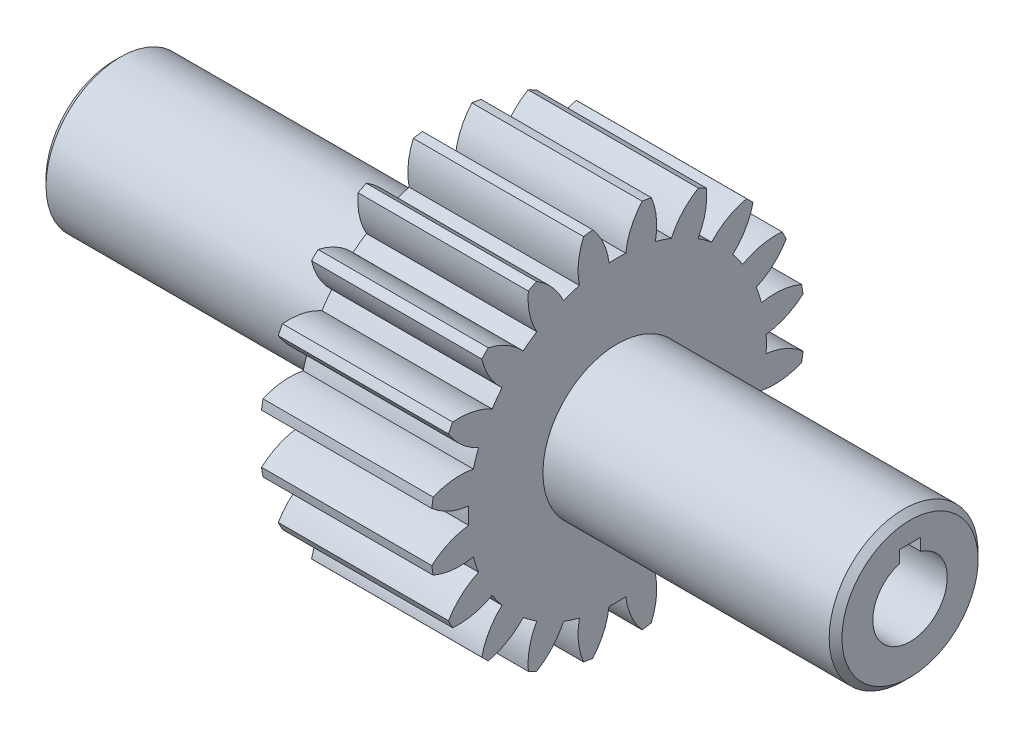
ISO-10303-21;
HEADER;
FILE_DESCRIPTION(('STEP AP214'),'2;1');
FILE_NAME('part.step','',(''),(''),'','','');
FILE_SCHEMA(('AUTOMOTIVE_DESIGN { 1 0 10303 214 1 1 1 1 }'));
ENDSEC;
DATA;
#1=APPLICATION_CONTEXT('core data for automotive mechanical design processes');
#2=APPLICATION_PROTOCOL_DEFINITION('international standard','automotive_design',2000,#1);
#3=PRODUCT_CONTEXT('',#1,'mechanical');
#4=PRODUCT('Part','Part','',(#3));
#5=PRODUCT_RELATED_PRODUCT_CATEGORY('part','',(#4));
#6=PRODUCT_DEFINITION_FORMATION('','',#4);
#7=PRODUCT_DEFINITION_CONTEXT('part definition',#1,'design');
#8=PRODUCT_DEFINITION('design','',#6,#7);
#9=PRODUCT_DEFINITION_SHAPE('','',#8);
#10=(LENGTH_UNIT() NAMED_UNIT(*) SI_UNIT(.MILLI.,.METRE.));
#11=(NAMED_UNIT(*) PLANE_ANGLE_UNIT() SI_UNIT($,.RADIAN.));
#12=(NAMED_UNIT(*) SI_UNIT($,.STERADIAN.) SOLID_ANGLE_UNIT());
#13=UNCERTAINTY_MEASURE_WITH_UNIT(LENGTH_MEASURE(1.E-05),#10,'distance_accuracy_value','');
#14=(GEOMETRIC_REPRESENTATION_CONTEXT(3) GLOBAL_UNCERTAINTY_ASSIGNED_CONTEXT((#13)) GLOBAL_UNIT_ASSIGNED_CONTEXT((#10,
#11,#12)) REPRESENTATION_CONTEXT('',''));
#15=CARTESIAN_POINT('',(0.,0.,0.));
#16=DIRECTION('',(0.,0.,1.));
#17=DIRECTION('',(1.,0.,0.));
#18=AXIS2_PLACEMENT_3D('',#15,#16,#17);
#19=CARTESIAN_POINT('',(316.494949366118,0.,1.21295555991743E-13));
#20=DIRECTION('',(-1.,0.,0.));
#21=DIRECTION('',(0.,0.,1.));
#22=AXIS2_PLACEMENT_3D('',#19,#20,#21);
#23=CYLINDRICAL_SURFACE('',#22,35.0000000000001);
#24=CARTESIAN_POINT('',(-153.5,0.,1.21295555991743E-13));
#25=DIRECTION('',(1.,0.,0.));
#26=DIRECTION('',(0.,0.,-1.));
#27=AXIS2_PLACEMENT_3D('',#24,#25,#26);
#28=CIRCLE('',#27,35.0000000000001);
#29=CARTESIAN_POINT('',(-153.5,0.,-35.));
#30=VERTEX_POINT('',#29);
#31=EDGE_CURVE('E49',#30,#30,#28,.T.);
#32=ORIENTED_EDGE('',*,*,#31,.T.);
#33=EDGE_LOOP('',(#32));
#34=FACE_BOUND('',#33,.T.);
#35=CARTESIAN_POINT('',(214.500000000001,0.,1.21295555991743E-13));
#36=DIRECTION('',(1.,0.,0.));
#37=DIRECTION('',(0.,0.,-1.));
#38=AXIS2_PLACEMENT_3D('',#35,#36,#37);
#39=CIRCLE('',#38,35.0000000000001);
#40=CARTESIAN_POINT('',(214.500000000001,0.,35.0000000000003));
#41=VERTEX_POINT('',#40);
#42=EDGE_CURVE('E120',#41,#41,#39,.F.);
#43=ORIENTED_EDGE('',*,*,#42,.T.);
#44=EDGE_LOOP('',(#43));
#45=FACE_BOUND('',#44,.T.);
#46=ADVANCED_FACE('F41',(#34,#45),#23,.T.);
#47=CARTESIAN_POINT('',(316.494949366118,16.7705098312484,5.));
#48=DIRECTION('',(0.,0.,-1.));
#49=DIRECTION('',(0.,1.,0.));
#50=AXIS2_PLACEMENT_3D('',#47,#48,#49);
#51=PLANE('',#50);
#52=DIRECTION('',(-1.,0.,0.));
#53=VECTOR('',#52,1.);
#54=CARTESIAN_POINT('',(316.494949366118,22.5,5.));
#55=LINE('',#54,#53);
#56=CARTESIAN_POINT('',(217.500000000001,22.5,5.));
#57=VERTEX_POINT('',#56);
#58=CARTESIAN_POINT('',(-156.5,22.5,5.));
#59=VERTEX_POINT('',#58);
#60=EDGE_CURVE('E112',#57,#59,#55,.T.);
#61=ORIENTED_EDGE('',*,*,#60,.F.);
#62=DIRECTION('',(0.,-1.,0.));
#63=VECTOR('',#62,1.);
#64=CARTESIAN_POINT('',(217.500000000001,16.7705098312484,5.));
#65=LINE('',#64,#63);
#66=CARTESIAN_POINT('',(217.500000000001,16.7705098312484,5.));
#67=VERTEX_POINT('',#66);
#68=EDGE_CURVE('E86',#57,#67,#65,.T.);
#69=ORIENTED_EDGE('',*,*,#68,.T.);
#70=DIRECTION('',(-1.,0.,0.));
#71=VECTOR('',#70,1.);
#72=CARTESIAN_POINT('',(316.494949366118,16.7705098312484,5.));
#73=LINE('',#72,#71);
#74=CARTESIAN_POINT('',(-156.5,16.7705098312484,5.));
#75=VERTEX_POINT('',#74);
#76=EDGE_CURVE('E110',#67,#75,#73,.T.);
#77=ORIENTED_EDGE('',*,*,#76,.T.);
#78=DIRECTION('',(0.,1.,0.));
#79=VECTOR('',#78,1.);
#80=CARTESIAN_POINT('',(-156.5,16.7705098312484,5.));
#81=LINE('',#80,#79);
#82=EDGE_CURVE('E97',#75,#59,#81,.T.);
#83=ORIENTED_EDGE('',*,*,#82,.T.);
#84=EDGE_LOOP('',(#61,#69,#77,#83));
#85=FACE_BOUND('',#84,.T.);
#86=ADVANCED_FACE('F141',(#85),#51,.T.);
#87=CARTESIAN_POINT('',(316.494949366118,22.5,5.));
#88=DIRECTION('',(0.,-1.,0.));
#89=DIRECTION('',(0.,0.,-1.));
#90=AXIS2_PLACEMENT_3D('',#87,#88,#89);
#91=PLANE('',#90);
#92=DIRECTION('',(-1.,0.,0.));
#93=VECTOR('',#92,1.);
#94=CARTESIAN_POINT('',(316.494949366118,22.5,-5.));
#95=LINE('',#94,#93);
#96=CARTESIAN_POINT('',(217.500000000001,22.5,-5.));
#97=VERTEX_POINT('',#96);
#98=CARTESIAN_POINT('',(-156.5,22.5,-5.));
#99=VERTEX_POINT('',#98);
#100=EDGE_CURVE('E87',#97,#99,#95,.T.);
#101=ORIENTED_EDGE('',*,*,#100,.F.);
#102=DIRECTION('',(0.,0.,1.));
#103=VECTOR('',#102,1.);
#104=CARTESIAN_POINT('',(217.500000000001,22.5,4.99999999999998));
#105=LINE('',#104,#103);
#106=EDGE_CURVE('E104',#97,#57,#105,.T.);
#107=ORIENTED_EDGE('',*,*,#106,.T.);
#108=ORIENTED_EDGE('',*,*,#60,.T.);
#109=DIRECTION('',(0.,0.,-1.));
#110=VECTOR('',#109,1.);
#111=CARTESIAN_POINT('',(-156.5,22.5,5.00000000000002));
#112=LINE('',#111,#110);
#113=EDGE_CURVE('E107',#59,#99,#112,.T.);
#114=ORIENTED_EDGE('',*,*,#113,.T.);
#115=EDGE_LOOP('',(#101,#107,#108,#114));
#116=FACE_BOUND('',#115,.T.);
#117=ADVANCED_FACE('F146',(#116),#91,.T.);
#118=CARTESIAN_POINT('',(316.494949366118,16.7705098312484,-5.));
#119=DIRECTION('',(0.,0.,1.));
#120=DIRECTION('',(0.,-1.,0.));
#121=AXIS2_PLACEMENT_3D('',#118,#119,#120);
#122=PLANE('',#121);
#123=DIRECTION('',(-1.,0.,0.));
#124=VECTOR('',#123,1.);
#125=CARTESIAN_POINT('',(316.494949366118,16.7705098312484,-5.));
#126=LINE('',#125,#124);
#127=CARTESIAN_POINT('',(217.500000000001,16.7705098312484,-5.));
#128=VERTEX_POINT('',#127);
#129=CARTESIAN_POINT('',(-156.5,16.7705098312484,-5.));
#130=VERTEX_POINT('',#129);
#131=EDGE_CURVE('E80',#128,#130,#126,.T.);
#132=ORIENTED_EDGE('',*,*,#131,.F.);
#133=DIRECTION('',(0.,1.,0.));
#134=VECTOR('',#133,1.);
#135=CARTESIAN_POINT('',(217.500000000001,16.7705098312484,-5.));
#136=LINE('',#135,#134);
#137=EDGE_CURVE('E61',#128,#97,#136,.T.);
#138=ORIENTED_EDGE('',*,*,#137,.T.);
#139=ORIENTED_EDGE('',*,*,#100,.T.);
#140=DIRECTION('',(0.,-1.,0.));
#141=VECTOR('',#140,1.);
#142=CARTESIAN_POINT('',(-156.5,16.7705098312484,-5.));
#143=LINE('',#142,#141);
#144=EDGE_CURVE('E94',#99,#130,#143,.T.);
#145=ORIENTED_EDGE('',*,*,#144,.T.);
#146=EDGE_LOOP('',(#132,#138,#139,#145));
#147=FACE_BOUND('',#146,.T.);
#148=ADVANCED_FACE('F99',(#147),#122,.T.);
#149=CARTESIAN_POINT('',(316.494949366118,0.,1.21295555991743E-13));
#150=DIRECTION('',(-1.,0.,0.));
#151=DIRECTION('',(0.,0.,1.));
#152=AXIS2_PLACEMENT_3D('',#149,#150,#151);
#153=CYLINDRICAL_SURFACE('',#152,17.5);
#154=ORIENTED_EDGE('',*,*,#76,.F.);
#155=CARTESIAN_POINT('',(217.500000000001,0.,1.21295555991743E-13));
#156=DIRECTION('',(1.,0.,0.));
#157=DIRECTION('',(0.,0.,-1.));
#158=AXIS2_PLACEMENT_3D('',#155,#156,#157);
#159=CIRCLE('',#158,17.5);
#160=EDGE_CURVE('E56',#67,#128,#159,.T.);
#161=ORIENTED_EDGE('',*,*,#160,.T.);
#162=ORIENTED_EDGE('',*,*,#131,.T.);
#163=CARTESIAN_POINT('',(-156.5,0.,1.21295555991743E-13));
#164=DIRECTION('',(1.,0.,0.));
#165=DIRECTION('',(0.,0.,-1.));
#166=AXIS2_PLACEMENT_3D('',#163,#164,#165);
#167=CIRCLE('',#166,17.5);
#168=EDGE_CURVE('E83',#130,#75,#167,.F.);
#169=ORIENTED_EDGE('',*,*,#168,.T.);
#170=EDGE_LOOP('',(#154,#161,#162,#169));
#171=FACE_BOUND('',#170,.T.);
#172=ADVANCED_FACE('F82',(#171),#153,.F.);
#173=CARTESIAN_POINT('',(217.500000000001,0.,1.17961196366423E-13));
#174=DIRECTION('',(1.,0.,0.));
#175=DIRECTION('',(0.,0.575384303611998,-0.817883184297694));
#176=AXIS2_PLACEMENT_3D('',#173,#174,#175);
#177=PLANE('',#176);
#178=CARTESIAN_POINT('',(217.500000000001,0.,1.21295555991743E-13));
#179=DIRECTION('',(1.,0.,0.));
#180=DIRECTION('',(0.,0.,-1.));
#181=AXIS2_PLACEMENT_3D('',#178,#179,#180);
#182=CIRCLE('',#181,32.0000000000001);
#183=CARTESIAN_POINT('',(217.500000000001,0.,32.0000000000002));
#184=VERTEX_POINT('',#183);
#185=EDGE_CURVE('E12',#184,#184,#182,.T.);
#186=ORIENTED_EDGE('',*,*,#185,.T.);
#187=EDGE_LOOP('',(#186));
#188=FACE_BOUND('',#187,.T.);
#189=ORIENTED_EDGE('',*,*,#160,.F.);
#190=ORIENTED_EDGE('',*,*,#68,.F.);
#191=ORIENTED_EDGE('',*,*,#106,.F.);
#192=ORIENTED_EDGE('',*,*,#137,.F.);
#193=EDGE_LOOP('',(#189,#190,#191,#192));
#194=FACE_BOUND('',#193,.T.);
#195=ADVANCED_FACE('F133',(#188,#194),#177,.T.);
#196=CARTESIAN_POINT('',(-156.5,58.5172344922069,-10.1849529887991));
#197=DIRECTION('',(1.,0.,0.));
#198=DIRECTION('',(0.,-0.575384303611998,0.817883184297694));
#199=AXIS2_PLACEMENT_3D('',#196,#197,#198);
#200=PLANE('',#199);
#201=CARTESIAN_POINT('',(-156.5,0.,1.21295555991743E-13));
#202=DIRECTION('',(1.,0.,0.));
#203=DIRECTION('',(0.,0.,-1.));
#204=AXIS2_PLACEMENT_3D('',#201,#202,#203);
#205=CIRCLE('',#204,32.0000000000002);
#206=CARTESIAN_POINT('',(-156.5,0.,-32.0000000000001));
#207=VERTEX_POINT('',#206);
#208=EDGE_CURVE('E117',#207,#207,#205,.F.);
#209=ORIENTED_EDGE('',*,*,#208,.T.);
#210=EDGE_LOOP('',(#209));
#211=FACE_BOUND('',#210,.T.);
#212=ORIENTED_EDGE('',*,*,#144,.F.);
#213=ORIENTED_EDGE('',*,*,#113,.F.);
#214=ORIENTED_EDGE('',*,*,#82,.F.);
#215=ORIENTED_EDGE('',*,*,#168,.F.);
#216=EDGE_LOOP('',(#212,#213,#214,#215));
#217=FACE_BOUND('',#216,.T.);
#218=ADVANCED_FACE('F92',(#211,#217),#200,.F.);
#219=CARTESIAN_POINT('',(-156.5,0.,1.21295555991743E-13));
#220=DIRECTION('',(1.,0.,0.));
#221=DIRECTION('',(0.,0.,-1.));
#222=AXIS2_PLACEMENT_3D('',#219,#220,#221);
#223=CONICAL_SURFACE('',#222,32.0000000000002,0.785398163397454);
#224=ORIENTED_EDGE('',*,*,#31,.F.);
#225=EDGE_LOOP('',(#224));
#226=FACE_BOUND('',#225,.T.);
#227=ORIENTED_EDGE('',*,*,#208,.F.);
#228=EDGE_LOOP('',(#227));
#229=FACE_BOUND('',#228,.T.);
#230=ADVANCED_FACE('F127',(#226,#229),#223,.T.);
#231=CARTESIAN_POINT('',(217.500000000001,0.,1.21295555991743E-13));
#232=DIRECTION('',(-1.,0.,0.));
#233=DIRECTION('',(0.,0.,1.));
#234=AXIS2_PLACEMENT_3D('',#231,#232,#233);
#235=CONICAL_SURFACE('',#234,32.0000000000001,0.785398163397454);
#236=CARTESIAN_POINT('',(214.500000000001,0.,35.0000000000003));
#237=CARTESIAN_POINT('',(214.531250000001,0.,34.9687500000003));
#238=CARTESIAN_POINT('',(214.562500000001,0.,34.9375000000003));
#239=CARTESIAN_POINT('',(214.625000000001,0.,34.8750000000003));
#240=CARTESIAN_POINT('',(214.656250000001,0.,34.8437500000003));
#241=CARTESIAN_POINT('',(214.718750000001,0.,34.7812500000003));
#242=CARTESIAN_POINT('',(214.750000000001,0.,34.7500000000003));
#243=CARTESIAN_POINT('',(214.812500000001,0.,34.6875000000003));
#244=CARTESIAN_POINT('',(214.843750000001,0.,34.6562500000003));
#245=CARTESIAN_POINT('',(214.906250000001,0.,34.5937500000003));
#246=CARTESIAN_POINT('',(214.937500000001,0.,34.5625000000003));
#247=CARTESIAN_POINT('',(215.000000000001,0.,34.5000000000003));
#248=CARTESIAN_POINT('',(215.031250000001,0.,34.4687500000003));
#249=CARTESIAN_POINT('',(215.093750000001,0.,34.4062500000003));
#250=CARTESIAN_POINT('',(215.125000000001,0.,34.3750000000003));
#251=CARTESIAN_POINT('',(215.187500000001,0.,34.3125000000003));
#252=CARTESIAN_POINT('',(215.218750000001,0.,34.2812500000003));
#253=CARTESIAN_POINT('',(215.281250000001,0.,34.2187500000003));
#254=CARTESIAN_POINT('',(215.312500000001,0.,34.1875000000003));
#255=CARTESIAN_POINT('',(215.375000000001,0.,34.1250000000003));
#256=CARTESIAN_POINT('',(215.406250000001,0.,34.0937500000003));
#257=CARTESIAN_POINT('',(215.468750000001,0.,34.0312500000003));
#258=CARTESIAN_POINT('',(215.500000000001,0.,34.0000000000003));
#259=CARTESIAN_POINT('',(215.562500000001,0.,33.9375000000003));
#260=CARTESIAN_POINT('',(215.593750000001,0.,33.9062500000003));
#261=CARTESIAN_POINT('',(215.656250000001,0.,33.8437500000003));
#262=CARTESIAN_POINT('',(215.687500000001,0.,33.8125000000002));
#263=CARTESIAN_POINT('',(215.750000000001,0.,33.7500000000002));
#264=CARTESIAN_POINT('',(215.781250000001,0.,33.7187500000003));
#265=CARTESIAN_POINT('',(215.843750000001,0.,33.6562500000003));
#266=CARTESIAN_POINT('',(215.875000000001,0.,33.6250000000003));
#267=CARTESIAN_POINT('',(215.937500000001,0.,33.5625000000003));
#268=CARTESIAN_POINT('',(215.968750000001,0.,33.5312500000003));
#269=CARTESIAN_POINT('',(216.031250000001,0.,33.4687500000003));
#270=CARTESIAN_POINT('',(216.062500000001,0.,33.4375000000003));
#271=CARTESIAN_POINT('',(216.125000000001,0.,33.3750000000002));
#272=CARTESIAN_POINT('',(216.156250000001,0.,33.3437500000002));
#273=CARTESIAN_POINT('',(216.218750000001,0.,33.2812500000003));
#274=CARTESIAN_POINT('',(216.250000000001,0.,33.2500000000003));
#275=CARTESIAN_POINT('',(216.312500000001,0.,33.1875000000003));
#276=CARTESIAN_POINT('',(216.343750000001,0.,33.1562500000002));
#277=CARTESIAN_POINT('',(216.406250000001,0.,33.0937500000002));
#278=CARTESIAN_POINT('',(216.437500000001,0.,33.0625000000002));
#279=CARTESIAN_POINT('',(216.500000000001,0.,33.0000000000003));
#280=CARTESIAN_POINT('',(216.531250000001,0.,32.9687500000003));
#281=CARTESIAN_POINT('',(216.593750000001,0.,32.9062500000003));
#282=CARTESIAN_POINT('',(216.625000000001,0.,32.8750000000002));
#283=CARTESIAN_POINT('',(216.687500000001,0.,32.8125000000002));
#284=CARTESIAN_POINT('',(216.718750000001,0.,32.7812500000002));
#285=CARTESIAN_POINT('',(216.781250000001,0.,32.7187500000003));
#286=CARTESIAN_POINT('',(216.812500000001,0.,32.6875000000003));
#287=CARTESIAN_POINT('',(216.875000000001,0.,32.6250000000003));
#288=CARTESIAN_POINT('',(216.906250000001,0.,32.5937500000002));
#289=CARTESIAN_POINT('',(216.968750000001,0.,32.5312500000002));
#290=CARTESIAN_POINT('',(217.000000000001,0.,32.5000000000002));
#291=CARTESIAN_POINT('',(217.062500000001,0.,32.4375000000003));
#292=CARTESIAN_POINT('',(217.093750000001,0.,32.4062500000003));
#293=CARTESIAN_POINT('',(217.156250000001,0.,32.3437500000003));
#294=CARTESIAN_POINT('',(217.187500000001,0.,32.3125000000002));
#295=CARTESIAN_POINT('',(217.250000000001,0.,32.2500000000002));
#296=CARTESIAN_POINT('',(217.281250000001,0.,32.2187500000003));
#297=CARTESIAN_POINT('',(217.343750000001,0.,32.1562500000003));
#298=CARTESIAN_POINT('',(217.375000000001,0.,32.1250000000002));
#299=CARTESIAN_POINT('',(217.437500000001,0.,32.0625000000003));
#300=CARTESIAN_POINT('',(217.468750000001,0.,32.0312500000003));
#301=CARTESIAN_POINT('',(217.500000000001,0.,32.0000000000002));
#302=B_SPLINE_CURVE_WITH_KNOTS('',3,(#236,#237,#238,#239,#240,#241,#242,#243,#244,#245,#246,
#247,#248,#249,#250,#251,#252,#253,#254,#255,#256,#257,#258,#259,#260,#261,#262,#263,#264,#265,
#266,#267,#268,#269,#270,#271,#272,#273,#274,#275,#276,#277,#278,#279,#280,#281,#282,#283,#284,
#285,#286,#287,#288,#289,#290,#291,#292,#293,#294,#295,#296,#297,#298,#299,#300,#301),
.UNSPECIFIED.,.F.,.F.,(4,2,2,2,2,2,2,2,2,2,2,2,2,2,2,2,2,2,2,2,2,2,2,2,2,2,2,2,2,2,2,2,4),(0.,
0.132582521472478,0.26516504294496,0.397747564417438,0.530330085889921,0.662912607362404,
0.795495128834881,0.928077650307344,1.06066017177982,1.1932426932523,1.32582521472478,
1.45840773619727,1.59099025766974,1.72357277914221,1.85615530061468,1.98873782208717,
2.12132034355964,2.25390286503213,2.38648538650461,2.51906790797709,2.65165042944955,
2.78423295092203,2.91681547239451,3.04939799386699,3.18198051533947,3.31456303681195,
3.44714555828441,3.57972807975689,3.71231060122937,3.84489312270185,3.97747564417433,
4.11005816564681,4.24264068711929),.UNSPECIFIED.);
#303=EDGE_CURVE('BSEAM43',#41,#184,#302,.T.);
#304=ORIENTED_EDGE('',*,*,#42,.F.);
#305=ORIENTED_EDGE('',*,*,#185,.F.);
#306=ORIENTED_EDGE('',*,*,#303,.T.);
#307=ORIENTED_EDGE('',*,*,#303,.F.);
#308=EDGE_LOOP('',(#304,#306,#305,#307));
#309=FACE_BOUND('',#308,.T.);
#310=ADVANCED_FACE('F43',(#309),#235,.T.);
#311=CLOSED_SHELL('',(#46,#86,#117,#148,#172,#195,#218,#230,#310));
#312=MANIFOLD_SOLID_BREP('B2',#311);
#313=CARTESIAN_POINT('',(80.,0.,0.));
#314=DIRECTION('',(-1.,0.,0.));
#315=DIRECTION('',(0.,0.,1.));
#316=AXIS2_PLACEMENT_3D('',#313,#314,#315);
#317=PLANE('',#316);
#318=CARTESIAN_POINT('',(80.,51.8825860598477,-54.401649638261));
#319=DIRECTION('',(-1.,0.,0.));
#320=DIRECTION('',(0.,-0.309016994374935,-0.951056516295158));
#321=AXIS2_PLACEMENT_3D('',#318,#319,#320);
#322=CIRCLE('',#321,32.);
#323=CARTESIAN_POINT('',(80.,65.2553349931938,-25.3298491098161));
#324=VERTEX_POINT('',#323);
#325=CARTESIAN_POINT('',(80.,79.3667748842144,-38.0120381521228));
#326=VERTEX_POINT('',#325);
#327=EDGE_CURVE('E725',#324,#326,#322,.T.);
#328=ORIENTED_EDGE('',*,*,#327,.F.);
#329=CARTESIAN_POINT('',(80.,0.,0.));
#330=DIRECTION('',(-1.,0.,0.));
#331=DIRECTION('',(0.,-0.309016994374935,-0.951056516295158));
#332=AXIS2_PLACEMENT_3D('',#329,#330,#331);
#333=CIRCLE('',#332,69.999);
#334=CARTESIAN_POINT('',(80.,67.681186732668,-17.8638451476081));
#335=VERTEX_POINT('',#334);
#336=EDGE_CURVE('E724',#335,#324,#333,.T.);
#337=ORIENTED_EDGE('',*,*,#336,.F.);
#338=CARTESIAN_POINT('',(80.,73.9503811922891,13.5160401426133));
#339=DIRECTION('',(-1.,0.,0.));
#340=DIRECTION('',(0.,-0.309016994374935,-0.951056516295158));
#341=AXIS2_PLACEMENT_3D('',#338,#339,#340);
#342=CIRCLE('',#341,32.);
#343=CARTESIAN_POINT('',(80.,86.5519851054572,-15.8982349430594));
#344=VERTEX_POINT('',#343);
#345=EDGE_CURVE('E713',#344,#335,#342,.T.);
#346=ORIENTED_EDGE('',*,*,#345,.F.);
#347=CARTESIAN_POINT('',(80.,0.,0.));
#348=DIRECTION('',(-1.,0.,0.));
#349=DIRECTION('',(0.,0.,1.));
#350=AXIS2_PLACEMENT_3D('',#347,#348,#349);
#351=CIRCLE('',#350,88.);
#352=CARTESIAN_POINT('',(80.,87.2286542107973,-11.6259143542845));
#353=VERTEX_POINT('',#352);
#354=EDGE_CURVE('E1168',#353,#344,#351,.T.);
#355=ORIENTED_EDGE('',*,*,#354,.F.);
#356=CARTESIAN_POINT('',(80.,66.1543058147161,-35.7064425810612));
#357=DIRECTION('',(-1.,0.,0.));
#358=DIRECTION('',(0.,0.,-1.));
#359=AXIS2_PLACEMENT_3D('',#356,#357,#358);
#360=CIRCLE('',#359,32.);
#361=CARTESIAN_POINT('',(80.,69.8888654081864,-3.92511056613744));
#362=VERTEX_POINT('',#361);
#363=EDGE_CURVE('E1141',#362,#353,#360,.T.);
#364=ORIENTED_EDGE('',*,*,#363,.F.);
#365=CARTESIAN_POINT('',(80.,0.,0.));
#366=DIRECTION('',(-1.,0.,0.));
#367=DIRECTION('',(0.,0.,-1.));
#368=AXIS2_PLACEMENT_3D('',#365,#366,#367);
#369=CIRCLE('',#368,69.999);
#370=CARTESIAN_POINT('',(80.,69.8888654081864,3.92511056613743));
#371=VERTEX_POINT('',#370);
#372=EDGE_CURVE('E1146',#371,#362,#369,.T.);
#373=ORIENTED_EDGE('',*,*,#372,.F.);
#374=CARTESIAN_POINT('',(80.,66.1543058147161,35.7064425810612));
#375=DIRECTION('',(-1.,0.,0.));
#376=DIRECTION('',(0.,0.,-1.));
#377=AXIS2_PLACEMENT_3D('',#374,#375,#376);
#378=CIRCLE('',#377,32.);
#379=CARTESIAN_POINT('',(80.,87.2286542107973,11.6259143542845));
#380=VERTEX_POINT('',#379);
#381=EDGE_CURVE('E1143',#380,#371,#378,.T.);
#382=ORIENTED_EDGE('',*,*,#381,.F.);
#383=CARTESIAN_POINT('',(80.,86.551985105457,15.8982349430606));
#384=VERTEX_POINT('',#383);
#385=EDGE_CURVE('E1166',#384,#380,#351,.T.);
#386=ORIENTED_EDGE('',*,*,#385,.F.);
#387=CARTESIAN_POINT('',(80.,73.9503811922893,-13.5160401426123));
#388=DIRECTION('',(-1.,0.,0.));
#389=DIRECTION('',(0.,0.309016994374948,-0.951056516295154));
#390=AXIS2_PLACEMENT_3D('',#387,#388,#389);
#391=CIRCLE('',#390,32.);
#392=CARTESIAN_POINT('',(80.,67.6811867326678,17.8638451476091));
#393=VERTEX_POINT('',#392);
#394=EDGE_CURVE('E1119',#393,#384,#391,.T.);
#395=ORIENTED_EDGE('',*,*,#394,.F.);
#396=CARTESIAN_POINT('',(80.,0.,0.));
#397=DIRECTION('',(-1.,0.,0.));
#398=DIRECTION('',(0.,0.309016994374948,-0.951056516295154));
#399=AXIS2_PLACEMENT_3D('',#396,#397,#398);
#400=CIRCLE('',#399,69.999);
#401=CARTESIAN_POINT('',(80.,65.2553349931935,25.329849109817));
#402=VERTEX_POINT('',#401);
#403=EDGE_CURVE('E1124',#402,#393,#400,.T.);
#404=ORIENTED_EDGE('',*,*,#403,.F.);
#405=CARTESIAN_POINT('',(80.,51.8825860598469,54.4016496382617));
#406=DIRECTION('',(-1.,0.,0.));
#407=DIRECTION('',(0.,0.309016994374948,-0.951056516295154));
#408=AXIS2_PLACEMENT_3D('',#405,#406,#407);
#409=CIRCLE('',#408,32.);
#410=CARTESIAN_POINT('',(80.,79.3667748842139,38.0120381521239));
#411=VERTEX_POINT('',#410);
#412=EDGE_CURVE('E1121',#411,#402,#409,.T.);
#413=ORIENTED_EDGE('',*,*,#412,.F.);
#414=CARTESIAN_POINT('',(80.,77.4030046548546,41.8661542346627));
#415=VERTEX_POINT('',#414);
#416=EDGE_CURVE('E1314',#415,#411,#351,.T.);
#417=ORIENTED_EDGE('',*,*,#416,.F.);
#418=CARTESIAN_POINT('',(80.,74.5076780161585,9.99740647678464));
#419=DIRECTION('',(-1.,0.,0.));
#420=DIRECTION('',(0.,0.587785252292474,-0.809016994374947));
#421=AXIS2_PLACEMENT_3D('',#418,#419,#420);
#422=CIRCLE('',#421,32.);
#423=CARTESIAN_POINT('',(80.,58.8484019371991,37.9041632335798));
#424=VERTEX_POINT('',#423);
#425=EDGE_CURVE('E1097',#424,#415,#422,.T.);
#426=ORIENTED_EDGE('',*,*,#425,.F.);
#427=CARTESIAN_POINT('',(80.,0.,0.));
#428=DIRECTION('',(-1.,0.,0.));
#429=DIRECTION('',(0.,0.587785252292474,-0.809016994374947));
#430=AXIS2_PLACEMENT_3D('',#427,#428,#429);
#431=CIRCLE('',#430,69.999);
#432=CARTESIAN_POINT('',(80.,54.2341577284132,44.2551255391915));
#433=VERTEX_POINT('',#432);
#434=EDGE_CURVE('E1102',#433,#424,#431,.T.);
#435=ORIENTED_EDGE('',*,*,#434,.F.);
#436=CARTESIAN_POINT('',(80.,32.5322372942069,67.7716441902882));
#437=DIRECTION('',(-1.,0.,0.));
#438=DIRECTION('',(0.,0.587785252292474,-0.809016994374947));
#439=AXIS2_PLACEMENT_3D('',#436,#437,#438);
#440=CIRCLE('',#439,32.);
#441=CARTESIAN_POINT('',(80.,63.7359226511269,60.6772788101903));
#442=VERTEX_POINT('',#441);
#443=EDGE_CURVE('E1099',#442,#433,#440,.T.);
#444=ORIENTED_EDGE('',*,*,#443,.F.);
#445=CARTESIAN_POINT('',(80.,60.67727881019,63.7359226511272));
#446=VERTEX_POINT('',#445);
#447=EDGE_CURVE('E1309',#446,#442,#351,.T.);
#448=ORIENTED_EDGE('',*,*,#447,.F.);
#449=CARTESIAN_POINT('',(80.,67.771644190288,32.5322372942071));
#450=DIRECTION('',(-1.,0.,0.));
#451=DIRECTION('',(0.,0.809016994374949,-0.587785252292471));
#452=AXIS2_PLACEMENT_3D('',#449,#450,#451);
#453=CIRCLE('',#452,32.);
#454=CARTESIAN_POINT('',(80.,44.2551255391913,54.2341577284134));
#455=VERTEX_POINT('',#454);
#456=EDGE_CURVE('E1075',#455,#446,#453,.T.);
#457=ORIENTED_EDGE('',*,*,#456,.F.);
#458=CARTESIAN_POINT('',(80.,0.,0.));
#459=DIRECTION('',(-1.,0.,0.));
#460=DIRECTION('',(0.,0.809016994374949,-0.587785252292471));
#461=AXIS2_PLACEMENT_3D('',#458,#459,#460);
#462=CIRCLE('',#461,69.999);
#463=CARTESIAN_POINT('',(80.,37.9041632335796,58.8484019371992));
#464=VERTEX_POINT('',#463);
#465=EDGE_CURVE('E1080',#464,#455,#462,.T.);
#466=ORIENTED_EDGE('',*,*,#465,.F.);
#467=CARTESIAN_POINT('',(80.,9.99740647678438,74.5076780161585));
#468=DIRECTION('',(-1.,0.,0.));
#469=DIRECTION('',(0.,0.809016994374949,-0.587785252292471));
#470=AXIS2_PLACEMENT_3D('',#467,#468,#469);
#471=CIRCLE('',#470,32.);
#472=CARTESIAN_POINT('',(80.,41.8661542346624,77.4030046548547));
#473=VERTEX_POINT('',#472);
#474=EDGE_CURVE('E1077',#473,#464,#471,.T.);
#475=ORIENTED_EDGE('',*,*,#474,.F.);
#476=CARTESIAN_POINT('',(80.,38.0120381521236,79.366774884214));
#477=VERTEX_POINT('',#476);
#478=EDGE_CURVE('E1304',#477,#473,#351,.T.);
#479=ORIENTED_EDGE('',*,*,#478,.F.);
#480=CARTESIAN_POINT('',(80.,54.4016496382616,51.8825860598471));
#481=DIRECTION('',(-1.,0.,0.));
#482=DIRECTION('',(0.,0.951056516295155,-0.309016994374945));
#483=AXIS2_PLACEMENT_3D('',#480,#481,#482);
#484=CIRCLE('',#483,32.);
#485=CARTESIAN_POINT('',(80.,25.3298491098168,65.2553349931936));
#486=VERTEX_POINT('',#485);
#487=EDGE_CURVE('E1053',#486,#477,#484,.T.);
#488=ORIENTED_EDGE('',*,*,#487,.F.);
#489=CARTESIAN_POINT('',(80.,0.,0.));
#490=DIRECTION('',(-1.,0.,0.));
#491=DIRECTION('',(0.,0.951056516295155,-0.309016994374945));
#492=AXIS2_PLACEMENT_3D('',#489,#490,#491);
#493=CIRCLE('',#492,69.999);
#494=CARTESIAN_POINT('',(80.,17.8638451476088,67.6811867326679));
#495=VERTEX_POINT('',#494);
#496=EDGE_CURVE('E1058',#495,#486,#493,.T.);
#497=ORIENTED_EDGE('',*,*,#496,.F.);
#498=CARTESIAN_POINT('',(80.,-13.5160401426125,73.9503811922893));
#499=DIRECTION('',(-1.,0.,0.));
#500=DIRECTION('',(0.,0.951056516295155,-0.309016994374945));
#501=AXIS2_PLACEMENT_3D('',#498,#499,#500);
#502=CIRCLE('',#501,32.);
#503=CARTESIAN_POINT('',(80.,15.8982349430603,86.551985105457));
#504=VERTEX_POINT('',#503);
#505=EDGE_CURVE('E1055',#504,#495,#502,.T.);
#506=ORIENTED_EDGE('',*,*,#505,.F.);
#507=CARTESIAN_POINT('',(80.,11.6259143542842,87.2286542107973));
#508=VERTEX_POINT('',#507);
#509=EDGE_CURVE('E1299',#508,#504,#351,.T.);
#510=ORIENTED_EDGE('',*,*,#509,.F.);
#511=CARTESIAN_POINT('',(80.,35.706442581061,66.1543058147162));
#512=DIRECTION('',(-1.,0.,0.));
#513=DIRECTION('',(0.,1.,0.));
#514=AXIS2_PLACEMENT_3D('',#511,#512,#513);
#515=CIRCLE('',#514,32.);
#516=CARTESIAN_POINT('',(80.,3.9251105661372,69.8888654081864));
#517=VERTEX_POINT('',#516);
#518=EDGE_CURVE('E1031',#517,#508,#515,.T.);
#519=ORIENTED_EDGE('',*,*,#518,.F.);
#520=CARTESIAN_POINT('',(80.,0.,0.));
#521=DIRECTION('',(-1.,0.,0.));
#522=DIRECTION('',(0.,1.,0.));
#523=AXIS2_PLACEMENT_3D('',#520,#521,#522);
#524=CIRCLE('',#523,69.999);
#525=CARTESIAN_POINT('',(80.,-3.92511056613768,69.8888654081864));
#526=VERTEX_POINT('',#525);
#527=EDGE_CURVE('E1036',#526,#517,#524,.T.);
#528=ORIENTED_EDGE('',*,*,#527,.F.);
#529=CARTESIAN_POINT('',(80.,-35.7064425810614,66.154305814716));
#530=DIRECTION('',(-1.,0.,0.));
#531=DIRECTION('',(0.,1.,0.));
#532=AXIS2_PLACEMENT_3D('',#529,#530,#531);
#533=CIRCLE('',#532,32.);
#534=CARTESIAN_POINT('',(80.,-11.6259143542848,87.2286542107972));
#535=VERTEX_POINT('',#534);
#536=EDGE_CURVE('E1033',#535,#526,#533,.T.);
#537=ORIENTED_EDGE('',*,*,#536,.F.);
#538=CARTESIAN_POINT('',(80.,-15.8982349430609,86.5519851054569));
#539=VERTEX_POINT('',#538);
#540=EDGE_CURVE('E1294',#539,#535,#351,.T.);
#541=ORIENTED_EDGE('',*,*,#540,.F.);
#542=CARTESIAN_POINT('',(80.,13.516040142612,73.9503811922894));
#543=DIRECTION('',(-1.,0.,0.));
#544=DIRECTION('',(0.,0.951056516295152,0.309016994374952));
#545=AXIS2_PLACEMENT_3D('',#542,#543,#544);
#546=CIRCLE('',#545,32.);
#547=CARTESIAN_POINT('',(80.,-17.8638451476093,67.6811867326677));
#548=VERTEX_POINT('',#547);
#549=EDGE_CURVE('E1009',#548,#539,#546,.T.);
#550=ORIENTED_EDGE('',*,*,#549,.F.);
#551=CARTESIAN_POINT('',(80.,0.,0.));
#552=DIRECTION('',(-1.,0.,0.));
#553=DIRECTION('',(0.,0.951056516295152,0.309016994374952));
#554=AXIS2_PLACEMENT_3D('',#551,#552,#553);
#555=CIRCLE('',#554,69.999);
#556=CARTESIAN_POINT('',(80.,-25.3298491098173,65.2553349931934));
#557=VERTEX_POINT('',#556);
#558=EDGE_CURVE('E1014',#557,#548,#555,.T.);
#559=ORIENTED_EDGE('',*,*,#558,.F.);
#560=CARTESIAN_POINT('',(80.,-54.4016496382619,51.8825860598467));
#561=DIRECTION('',(-1.,0.,0.));
#562=DIRECTION('',(0.,0.951056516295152,0.309016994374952));
#563=AXIS2_PLACEMENT_3D('',#560,#561,#562);
#564=CIRCLE('',#563,32.);
#565=CARTESIAN_POINT('',(80.,-38.0120381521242,79.3667748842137));
#566=VERTEX_POINT('',#565);
#567=EDGE_CURVE('E1011',#566,#557,#564,.T.);
#568=ORIENTED_EDGE('',*,*,#567,.F.);
#569=CARTESIAN_POINT('',(80.,-41.866154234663,77.4030046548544));
#570=VERTEX_POINT('',#569);
#571=EDGE_CURVE('E1289',#570,#566,#351,.T.);
#572=ORIENTED_EDGE('',*,*,#571,.F.);
#573=CARTESIAN_POINT('',(80.,-9.9974064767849,74.5076780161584));
#574=DIRECTION('',(-1.,0.,0.));
#575=DIRECTION('',(0.,0.809016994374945,0.587785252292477));
#576=AXIS2_PLACEMENT_3D('',#573,#574,#575);
#577=CIRCLE('',#576,32.);
#578=CARTESIAN_POINT('',(80.,-37.90416323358,58.848401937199));
#579=VERTEX_POINT('',#578);
#580=EDGE_CURVE('E987',#579,#570,#577,.T.);
#581=ORIENTED_EDGE('',*,*,#580,.F.);
#582=CARTESIAN_POINT('',(80.,0.,0.));
#583=DIRECTION('',(-1.,0.,0.));
#584=DIRECTION('',(0.,0.809016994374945,0.587785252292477));
#585=AXIS2_PLACEMENT_3D('',#582,#583,#584);
#586=CIRCLE('',#585,69.999);
#587=CARTESIAN_POINT('',(80.,-44.2551255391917,54.2341577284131));
#588=VERTEX_POINT('',#587);
#589=EDGE_CURVE('E992',#588,#579,#586,.T.);
#590=ORIENTED_EDGE('',*,*,#589,.F.);
#591=CARTESIAN_POINT('',(80.,-67.7716441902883,32.5322372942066));
#592=DIRECTION('',(-1.,0.,0.));
#593=DIRECTION('',(0.,0.809016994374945,0.587785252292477));
#594=AXIS2_PLACEMENT_3D('',#591,#592,#593);
#595=CIRCLE('',#594,32.);
#596=CARTESIAN_POINT('',(80.,-60.6772788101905,63.7359226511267));
#597=VERTEX_POINT('',#596);
#598=EDGE_CURVE('E989',#597,#588,#595,.T.);
#599=ORIENTED_EDGE('',*,*,#598,.F.);
#600=CARTESIAN_POINT('',(80.,-63.7359226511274,60.6772788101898));
#601=VERTEX_POINT('',#600);
#602=EDGE_CURVE('E1284',#601,#597,#351,.T.);
#603=ORIENTED_EDGE('',*,*,#602,.F.);
#604=CARTESIAN_POINT('',(80.,-32.5322372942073,67.7716441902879));
#605=DIRECTION('',(-1.,0.,0.));
#606=DIRECTION('',(0.,0.587785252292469,0.809016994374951));
#607=AXIS2_PLACEMENT_3D('',#604,#605,#606);
#608=CIRCLE('',#607,32.);
#609=CARTESIAN_POINT('',(80.,-54.2341577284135,44.2551255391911));
#610=VERTEX_POINT('',#609);
#611=EDGE_CURVE('E965',#610,#601,#608,.T.);
#612=ORIENTED_EDGE('',*,*,#611,.F.);
#613=CARTESIAN_POINT('',(80.,0.,0.));
#614=DIRECTION('',(-1.,0.,0.));
#615=DIRECTION('',(0.,0.587785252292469,0.809016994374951));
#616=AXIS2_PLACEMENT_3D('',#613,#614,#615);
#617=CIRCLE('',#616,69.999);
#618=CARTESIAN_POINT('',(80.,-58.8484019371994,37.9041632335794));
#619=VERTEX_POINT('',#618);
#620=EDGE_CURVE('E970',#619,#610,#617,.T.);
#621=ORIENTED_EDGE('',*,*,#620,.F.);
#622=CARTESIAN_POINT('',(80.,-74.5076780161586,9.99740647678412));
#623=DIRECTION('',(-1.,0.,0.));
#624=DIRECTION('',(0.,0.587785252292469,0.809016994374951));
#625=AXIS2_PLACEMENT_3D('',#622,#623,#624);
#626=CIRCLE('',#625,32.);
#627=CARTESIAN_POINT('',(80.,-77.4030046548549,41.8661542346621));
#628=VERTEX_POINT('',#627);
#629=EDGE_CURVE('E967',#628,#619,#626,.T.);
#630=ORIENTED_EDGE('',*,*,#629,.F.);
#631=CARTESIAN_POINT('',(80.,-79.3667748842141,38.0120381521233));
#632=VERTEX_POINT('',#631);
#633=EDGE_CURVE('E1279',#632,#628,#351,.T.);
#634=ORIENTED_EDGE('',*,*,#633,.F.);
#635=CARTESIAN_POINT('',(80.,-51.8825860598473,54.4016496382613));
#636=DIRECTION('',(-1.,0.,0.));
#637=DIRECTION('',(0.,0.309016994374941,0.951056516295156));
#638=AXIS2_PLACEMENT_3D('',#635,#636,#637);
#639=CIRCLE('',#638,32.);
#640=CARTESIAN_POINT('',(80.,-65.2553349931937,25.3298491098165));
#641=VERTEX_POINT('',#640);
#642=EDGE_CURVE('E943',#641,#632,#639,.T.);
#643=ORIENTED_EDGE('',*,*,#642,.F.);
#644=CARTESIAN_POINT('',(80.,0.,0.));
#645=DIRECTION('',(-1.,0.,0.));
#646=DIRECTION('',(0.,0.309016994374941,0.951056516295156));
#647=AXIS2_PLACEMENT_3D('',#644,#645,#646);
#648=CIRCLE('',#647,69.999);
#649=CARTESIAN_POINT('',(80.,-67.6811867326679,17.8638451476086));
#650=VERTEX_POINT('',#649);
#651=EDGE_CURVE('E948',#650,#641,#648,.T.);
#652=ORIENTED_EDGE('',*,*,#651,.F.);
#653=CARTESIAN_POINT('',(80.,-73.9503811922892,-13.5160401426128));
#654=DIRECTION('',(-1.,0.,0.));
#655=DIRECTION('',(0.,0.309016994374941,0.951056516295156));
#656=AXIS2_PLACEMENT_3D('',#653,#654,#655);
#657=CIRCLE('',#656,32.);
#658=CARTESIAN_POINT('',(80.,-86.5519851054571,15.89823494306));
#659=VERTEX_POINT('',#658);
#660=EDGE_CURVE('E945',#659,#650,#657,.T.);
#661=ORIENTED_EDGE('',*,*,#660,.F.);
#662=CARTESIAN_POINT('',(80.,-87.2286542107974,11.6259143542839));
#663=VERTEX_POINT('',#662);
#664=EDGE_CURVE('E1274',#663,#659,#351,.T.);
#665=ORIENTED_EDGE('',*,*,#664,.F.);
#666=CARTESIAN_POINT('',(80.,-66.1543058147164,35.7064425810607));
#667=DIRECTION('',(-1.,0.,0.));
#668=DIRECTION('',(0.,0.,1.));
#669=AXIS2_PLACEMENT_3D('',#666,#667,#668);
#670=CIRCLE('',#669,32.);
#671=CARTESIAN_POINT('',(80.,-69.8888654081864,3.92511056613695));
#672=VERTEX_POINT('',#671);
#673=EDGE_CURVE('E921',#672,#663,#670,.T.);
#674=ORIENTED_EDGE('',*,*,#673,.F.);
#675=CARTESIAN_POINT('',(80.,0.,0.));
#676=DIRECTION('',(-1.,0.,0.));
#677=DIRECTION('',(0.,0.,1.));
#678=AXIS2_PLACEMENT_3D('',#675,#676,#677);
#679=CIRCLE('',#678,69.999);
#680=CARTESIAN_POINT('',(80.,-69.8888654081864,-3.92511056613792));
#681=VERTEX_POINT('',#680);
#682=EDGE_CURVE('E926',#681,#672,#679,.T.);
#683=ORIENTED_EDGE('',*,*,#682,.F.);
#684=CARTESIAN_POINT('',(80.,-66.1543058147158,-35.7064425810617));
#685=DIRECTION('',(-1.,0.,0.));
#686=DIRECTION('',(0.,0.,1.));
#687=AXIS2_PLACEMENT_3D('',#684,#685,#686);
#688=CIRCLE('',#687,32.);
#689=CARTESIAN_POINT('',(80.,-87.2286542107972,-11.6259143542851));
#690=VERTEX_POINT('',#689);
#691=EDGE_CURVE('E923',#690,#681,#688,.T.);
#692=ORIENTED_EDGE('',*,*,#691,.F.);
#693=CARTESIAN_POINT('',(80.,-86.5519851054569,-15.8982349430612));
#694=VERTEX_POINT('',#693);
#695=EDGE_CURVE('E1269',#694,#690,#351,.T.);
#696=ORIENTED_EDGE('',*,*,#695,.F.);
#697=CARTESIAN_POINT('',(80.,-73.9503811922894,13.5160401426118));
#698=DIRECTION('',(-1.,0.,0.));
#699=DIRECTION('',(0.,-0.309016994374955,0.951056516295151));
#700=AXIS2_PLACEMENT_3D('',#697,#698,#699);
#701=CIRCLE('',#700,32.);
#702=CARTESIAN_POINT('',(80.,-67.6811867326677,-17.8638451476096));
#703=VERTEX_POINT('',#702);
#704=EDGE_CURVE('E899',#703,#694,#701,.T.);
#705=ORIENTED_EDGE('',*,*,#704,.F.);
#706=CARTESIAN_POINT('',(80.,0.,0.));
#707=DIRECTION('',(-1.,0.,0.));
#708=DIRECTION('',(0.,-0.309016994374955,0.951056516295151));
#709=AXIS2_PLACEMENT_3D('',#706,#707,#708);
#710=CIRCLE('',#709,69.999);
#711=CARTESIAN_POINT('',(80.,-65.2553349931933,-25.3298491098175));
#712=VERTEX_POINT('',#711);
#713=EDGE_CURVE('E904',#712,#703,#710,.T.);
#714=ORIENTED_EDGE('',*,*,#713,.F.);
#715=CARTESIAN_POINT('',(80.,-51.8825860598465,-54.4016496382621));
#716=DIRECTION('',(-1.,0.,0.));
#717=DIRECTION('',(0.,-0.309016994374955,0.951056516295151));
#718=AXIS2_PLACEMENT_3D('',#715,#716,#717);
#719=CIRCLE('',#718,32.);
#720=CARTESIAN_POINT('',(80.,-79.3667748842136,-38.0120381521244));
#721=VERTEX_POINT('',#720);
#722=EDGE_CURVE('E901',#721,#712,#719,.T.);
#723=ORIENTED_EDGE('',*,*,#722,.F.);
#724=CARTESIAN_POINT('',(80.,-77.4030046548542,-41.8661542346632));
#725=VERTEX_POINT('',#724);
#726=EDGE_CURVE('E1264',#725,#721,#351,.T.);
#727=ORIENTED_EDGE('',*,*,#726,.F.);
#728=CARTESIAN_POINT('',(80.,-74.5076780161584,-9.99740647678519));
#729=DIRECTION('',(-1.,0.,0.));
#730=DIRECTION('',(0.,-0.58778525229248,0.809016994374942));
#731=AXIS2_PLACEMENT_3D('',#728,#729,#730);
#732=CIRCLE('',#731,32.);
#733=CARTESIAN_POINT('',(80.,-58.8484019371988,-37.9041632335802));
#734=VERTEX_POINT('',#733);
#735=EDGE_CURVE('E877',#734,#725,#732,.T.);
#736=ORIENTED_EDGE('',*,*,#735,.F.);
#737=CARTESIAN_POINT('',(80.,0.,0.));
#738=DIRECTION('',(-1.,0.,0.));
#739=DIRECTION('',(0.,-0.58778525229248,0.809016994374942));
#740=AXIS2_PLACEMENT_3D('',#737,#738,#739);
#741=CIRCLE('',#740,69.999);
#742=CARTESIAN_POINT('',(80.,-54.2341577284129,-44.2551255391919));
#743=VERTEX_POINT('',#742);
#744=EDGE_CURVE('E882',#743,#734,#741,.T.);
#745=ORIENTED_EDGE('',*,*,#744,.F.);
#746=CARTESIAN_POINT('',(80.,-32.5322372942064,-67.7716441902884));
#747=DIRECTION('',(-1.,0.,0.));
#748=DIRECTION('',(0.,-0.58778525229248,0.809016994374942));
#749=AXIS2_PLACEMENT_3D('',#746,#747,#748);
#750=CIRCLE('',#749,32.);
#751=CARTESIAN_POINT('',(80.,-63.7359226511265,-60.6772788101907));
#752=VERTEX_POINT('',#751);
#753=EDGE_CURVE('E879',#752,#743,#750,.T.);
#754=ORIENTED_EDGE('',*,*,#753,.F.);
#755=CARTESIAN_POINT('',(80.,-60.6772788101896,-63.7359226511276));
#756=VERTEX_POINT('',#755);
#757=EDGE_CURVE('E1259',#756,#752,#351,.T.);
#758=ORIENTED_EDGE('',*,*,#757,.F.);
#759=CARTESIAN_POINT('',(80.,-67.7716441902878,-32.5322372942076));
#760=DIRECTION('',(-1.,0.,0.));
#761=DIRECTION('',(0.,-0.809016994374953,0.587785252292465));
#762=AXIS2_PLACEMENT_3D('',#759,#760,#761);
#763=CIRCLE('',#762,32.);
#764=CARTESIAN_POINT('',(80.,-44.2551255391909,-54.2341577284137));
#765=VERTEX_POINT('',#764);
#766=EDGE_CURVE('E855',#765,#756,#763,.T.);
#767=ORIENTED_EDGE('',*,*,#766,.F.);
#768=CARTESIAN_POINT('',(80.,0.,0.));
#769=DIRECTION('',(-1.,0.,0.));
#770=DIRECTION('',(0.,-0.809016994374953,0.587785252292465));
#771=AXIS2_PLACEMENT_3D('',#768,#769,#770);
#772=CIRCLE('',#771,69.999);
#773=CARTESIAN_POINT('',(80.,-37.9041632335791,-58.8484019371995));
#774=VERTEX_POINT('',#773);
#775=EDGE_CURVE('E860',#774,#765,#772,.T.);
#776=ORIENTED_EDGE('',*,*,#775,.F.);
#777=CARTESIAN_POINT('',(80.,-9.99740647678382,-74.5076780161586));
#778=DIRECTION('',(-1.,0.,0.));
#779=DIRECTION('',(0.,-0.809016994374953,0.587785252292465));
#780=AXIS2_PLACEMENT_3D('',#777,#778,#779);
#781=CIRCLE('',#780,32.);
#782=CARTESIAN_POINT('',(80.,-41.8661542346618,-77.403004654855));
#783=VERTEX_POINT('',#782);
#784=EDGE_CURVE('E857',#783,#774,#781,.T.);
#785=ORIENTED_EDGE('',*,*,#784,.F.);
#786=CARTESIAN_POINT('',(80.,-38.012038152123,-79.3667748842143));
#787=VERTEX_POINT('',#786);
#788=EDGE_CURVE('E1254',#787,#783,#351,.T.);
#789=ORIENTED_EDGE('',*,*,#788,.F.);
#790=CARTESIAN_POINT('',(80.,-54.4016496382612,-51.8825860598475));
#791=DIRECTION('',(-1.,0.,0.));
#792=DIRECTION('',(0.,-0.951056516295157,0.309016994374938));
#793=AXIS2_PLACEMENT_3D('',#790,#791,#792);
#794=CIRCLE('',#793,32.);
#795=CARTESIAN_POINT('',(80.,-25.3298491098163,-65.2553349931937));
#796=VERTEX_POINT('',#795);
#797=EDGE_CURVE('E833',#796,#787,#794,.T.);
#798=ORIENTED_EDGE('',*,*,#797,.F.);
#799=CARTESIAN_POINT('',(80.,0.,0.));
#800=DIRECTION('',(-1.,0.,0.));
#801=DIRECTION('',(0.,-0.951056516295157,0.309016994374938));
#802=AXIS2_PLACEMENT_3D('',#799,#800,#801);
#803=CIRCLE('',#802,69.999);
#804=CARTESIAN_POINT('',(80.,-17.8638451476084,-67.681186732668));
#805=VERTEX_POINT('',#804);
#806=EDGE_CURVE('E838',#805,#796,#803,.T.);
#807=ORIENTED_EDGE('',*,*,#806,.F.);
#808=CARTESIAN_POINT('',(80.,13.516040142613,-73.9503811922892));
#809=DIRECTION('',(-1.,0.,0.));
#810=DIRECTION('',(0.,-0.951056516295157,0.309016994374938));
#811=AXIS2_PLACEMENT_3D('',#808,#809,#810);
#812=CIRCLE('',#811,32.);
#813=CARTESIAN_POINT('',(80.,-15.8982349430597,-86.5519851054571));
#814=VERTEX_POINT('',#813);
#815=EDGE_CURVE('E835',#814,#805,#812,.T.);
#816=ORIENTED_EDGE('',*,*,#815,.F.);
#817=CARTESIAN_POINT('',(80.,-11.6259143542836,-87.2286542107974));
#818=VERTEX_POINT('',#817);
#819=EDGE_CURVE('E1249',#818,#814,#351,.T.);
#820=ORIENTED_EDGE('',*,*,#819,.F.);
#821=CARTESIAN_POINT('',(80.,-35.7064425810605,-66.1543058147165));
#822=DIRECTION('',(-1.,0.,0.));
#823=DIRECTION('',(0.,-1.,0.));
#824=AXIS2_PLACEMENT_3D('',#821,#822,#823);
#825=CIRCLE('',#824,32.);
#826=CARTESIAN_POINT('',(80.,-3.92511056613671,-69.8888654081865));
#827=VERTEX_POINT('',#826);
#828=EDGE_CURVE('E811',#827,#818,#825,.T.);
#829=ORIENTED_EDGE('',*,*,#828,.F.);
#830=CARTESIAN_POINT('',(80.,0.,0.));
#831=DIRECTION('',(-1.,0.,0.));
#832=DIRECTION('',(0.,-1.,0.));
#833=AXIS2_PLACEMENT_3D('',#830,#831,#832);
#834=CIRCLE('',#833,69.999);
#835=CARTESIAN_POINT('',(80.,3.92511056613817,-69.8888654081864));
#836=VERTEX_POINT('',#835);
#837=EDGE_CURVE('E816',#836,#827,#834,.T.);
#838=ORIENTED_EDGE('',*,*,#837,.F.);
#839=CARTESIAN_POINT('',(80.,35.7064425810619,-66.1543058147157));
#840=DIRECTION('',(-1.,0.,0.));
#841=DIRECTION('',(0.,-1.,0.));
#842=AXIS2_PLACEMENT_3D('',#839,#840,#841);
#843=CIRCLE('',#842,32.);
#844=CARTESIAN_POINT('',(80.,11.6259143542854,-87.2286542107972));
#845=VERTEX_POINT('',#844);
#846=EDGE_CURVE('E813',#845,#836,#843,.T.);
#847=ORIENTED_EDGE('',*,*,#846,.F.);
#848=CARTESIAN_POINT('',(80.,15.8982349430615,-86.5519851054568));
#849=VERTEX_POINT('',#848);
#850=EDGE_CURVE('E1244',#849,#845,#351,.T.);
#851=ORIENTED_EDGE('',*,*,#850,.F.);
#852=CARTESIAN_POINT('',(80.,-13.5160401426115,-73.9503811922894));
#853=DIRECTION('',(-1.,0.,0.));
#854=DIRECTION('',(0.,-0.95105651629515,-0.309016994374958));
#855=AXIS2_PLACEMENT_3D('',#852,#853,#854);
#856=CIRCLE('',#855,32.);
#857=CARTESIAN_POINT('',(80.,17.8638451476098,-67.6811867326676));
#858=VERTEX_POINT('',#857);
#859=EDGE_CURVE('E789',#858,#849,#856,.T.);
#860=ORIENTED_EDGE('',*,*,#859,.F.);
#861=CARTESIAN_POINT('',(80.,0.,0.));
#862=DIRECTION('',(-1.,0.,0.));
#863=DIRECTION('',(0.,-0.95105651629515,-0.309016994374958));
#864=AXIS2_PLACEMENT_3D('',#861,#862,#863);
#865=CIRCLE('',#864,69.999);
#866=CARTESIAN_POINT('',(80.,25.3298491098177,-65.2553349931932));
#867=VERTEX_POINT('',#866);
#868=EDGE_CURVE('E794',#867,#858,#865,.T.);
#869=ORIENTED_EDGE('',*,*,#868,.F.);
#870=CARTESIAN_POINT('',(80.,54.4016496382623,-51.8825860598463));
#871=DIRECTION('',(-1.,0.,0.));
#872=DIRECTION('',(0.,-0.95105651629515,-0.309016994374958));
#873=AXIS2_PLACEMENT_3D('',#870,#871,#872);
#874=CIRCLE('',#873,32.);
#875=CARTESIAN_POINT('',(80.,38.0120381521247,-79.3667748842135));
#876=VERTEX_POINT('',#875);
#877=EDGE_CURVE('E791',#876,#867,#874,.T.);
#878=ORIENTED_EDGE('',*,*,#877,.F.);
#879=CARTESIAN_POINT('',(80.,41.8661542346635,-77.4030046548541));
#880=VERTEX_POINT('',#879);
#881=EDGE_CURVE('E1239',#880,#876,#351,.T.);
#882=ORIENTED_EDGE('',*,*,#881,.F.);
#883=CARTESIAN_POINT('',(80.,9.99740647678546,-74.5076780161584));
#884=DIRECTION('',(-1.,0.,0.));
#885=DIRECTION('',(0.,-0.80901699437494,-0.587785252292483));
#886=AXIS2_PLACEMENT_3D('',#883,#884,#885);
#887=CIRCLE('',#886,32.);
#888=CARTESIAN_POINT('',(80.,37.9041632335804,-58.8484019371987));
#889=VERTEX_POINT('',#888);
#890=EDGE_CURVE('E767',#889,#880,#887,.T.);
#891=ORIENTED_EDGE('',*,*,#890,.F.);
#892=CARTESIAN_POINT('',(80.,0.,0.));
#893=DIRECTION('',(-1.,0.,0.));
#894=DIRECTION('',(0.,-0.80901699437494,-0.587785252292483));
#895=AXIS2_PLACEMENT_3D('',#892,#893,#894);
#896=CIRCLE('',#895,69.999);
#897=CARTESIAN_POINT('',(80.,44.2551255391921,-54.2341577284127));
#898=VERTEX_POINT('',#897);
#899=EDGE_CURVE('E772',#898,#889,#896,.T.);
#900=ORIENTED_EDGE('',*,*,#899,.F.);
#901=CARTESIAN_POINT('',(80.,67.7716441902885,-32.5322372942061));
#902=DIRECTION('',(-1.,0.,0.));
#903=DIRECTION('',(0.,-0.80901699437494,-0.587785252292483));
#904=AXIS2_PLACEMENT_3D('',#901,#902,#903);
#905=CIRCLE('',#904,32.);
#906=CARTESIAN_POINT('',(80.,60.6772788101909,-63.7359226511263));
#907=VERTEX_POINT('',#906);
#908=EDGE_CURVE('E769',#907,#898,#905,.T.);
#909=ORIENTED_EDGE('',*,*,#908,.F.);
#910=CARTESIAN_POINT('',(80.,63.7359226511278,-60.6772788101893));
#911=VERTEX_POINT('',#910);
#912=EDGE_CURVE('E1238',#911,#907,#351,.T.);
#913=ORIENTED_EDGE('',*,*,#912,.F.);
#914=CARTESIAN_POINT('',(80.,32.5322372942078,-67.7716441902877));
#915=DIRECTION('',(-1.,0.,0.));
#916=DIRECTION('',(0.,-0.587785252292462,-0.809016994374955));
#917=AXIS2_PLACEMENT_3D('',#914,#915,#916);
#918=CIRCLE('',#917,32.);
#919=CARTESIAN_POINT('',(80.,54.2341577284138,-44.2551255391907));
#920=VERTEX_POINT('',#919);
#921=EDGE_CURVE('E747',#920,#911,#918,.T.);
#922=ORIENTED_EDGE('',*,*,#921,.F.);
#923=CARTESIAN_POINT('',(80.,0.,0.));
#924=DIRECTION('',(-1.,0.,0.));
#925=DIRECTION('',(0.,-0.587785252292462,-0.809016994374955));
#926=AXIS2_PLACEMENT_3D('',#923,#924,#925);
#927=CIRCLE('',#926,69.999);
#928=CARTESIAN_POINT('',(80.,58.8484019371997,-37.9041632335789));
#929=VERTEX_POINT('',#928);
#930=EDGE_CURVE('E752',#929,#920,#927,.T.);
#931=ORIENTED_EDGE('',*,*,#930,.F.);
#932=CARTESIAN_POINT('',(80.,74.5076780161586,-9.99740647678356));
#933=DIRECTION('',(-1.,0.,0.));
#934=DIRECTION('',(0.,-0.587785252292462,-0.809016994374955));
#935=AXIS2_PLACEMENT_3D('',#932,#933,#934);
#936=CIRCLE('',#935,32.);
#937=CARTESIAN_POINT('',(80.,77.4030046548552,-41.8661542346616));
#938=VERTEX_POINT('',#937);
#939=EDGE_CURVE('E749',#938,#929,#936,.T.);
#940=ORIENTED_EDGE('',*,*,#939,.F.);
#941=EDGE_CURVE('E1171',#326,#938,#351,.T.);
#942=ORIENTED_EDGE('',*,*,#941,.F.);
#943=EDGE_LOOP('',(#328,#337,#346,#355,#364,#373,#382,#386,#395,#404,#413,#417,#426,#435,#444,
#448,#457,#466,#475,#479,#488,#497,#506,#510,#519,#528,#537,#541,#550,#559,#568,#572,#581,#590,
#599,#603,#612,#621,#630,#634,#643,#652,#661,#665,#674,#683,#692,#696,#705,#714,#723,#727,#736,
#745,#754,#758,#767,#776,#785,#789,#798,#807,#816,#820,#829,#838,#847,#851,#860,#869,#878,#882,
#891,#900,#909,#913,#922,#931,#940,#942));
#944=FACE_BOUND('',#943,.T.);
#945=CARTESIAN_POINT('',(80.,0.,0.));
#946=DIRECTION('',(-1.,0.,0.));
#947=DIRECTION('',(0.,0.,1.));
#948=AXIS2_PLACEMENT_3D('',#945,#946,#947);
#949=CIRCLE('',#948,35.);
#950=CARTESIAN_POINT('',(80.,0.,35.));
#951=VERTEX_POINT('',#950);
#952=EDGE_CURVE('E742',#951,#951,#949,.F.);
#953=ORIENTED_EDGE('',*,*,#952,.F.);
#954=EDGE_LOOP('',(#953));
#955=FACE_BOUND('',#954,.T.);
#956=ADVANCED_FACE('F216',(#944,#955),#317,.F.);
#957=CARTESIAN_POINT('',(0.,0.,0.));
#958=DIRECTION('',(1.,0.,0.));
#959=DIRECTION('',(0.,0.,-1.));
#960=AXIS2_PLACEMENT_3D('',#957,#958,#959);
#961=PLANE('',#960);
#962=CARTESIAN_POINT('',(0.,51.8825860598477,-54.401649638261));
#963=DIRECTION('',(-1.,0.,0.));
#964=DIRECTION('',(0.,-0.309016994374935,-0.951056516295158));
#965=AXIS2_PLACEMENT_3D('',#962,#963,#964);
#966=CIRCLE('',#965,32.);
#967=CARTESIAN_POINT('',(0.,65.2553349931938,-25.3298491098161));
#968=VERTEX_POINT('',#967);
#969=CARTESIAN_POINT('',(0.,79.3667748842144,-38.0120381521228));
#970=VERTEX_POINT('',#969);
#971=EDGE_CURVE('E231',#968,#970,#966,.T.);
#972=ORIENTED_EDGE('',*,*,#971,.T.);
#973=CARTESIAN_POINT('',(0.,0.,0.));
#974=DIRECTION('',(-1.,0.,0.));
#975=DIRECTION('',(0.,0.,1.));
#976=AXIS2_PLACEMENT_3D('',#973,#974,#975);
#977=CIRCLE('',#976,88.);
#978=CARTESIAN_POINT('',(0.,77.4030046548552,-41.8661542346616));
#979=VERTEX_POINT('',#978);
#980=EDGE_CURVE('E1167',#970,#979,#977,.T.);
#981=ORIENTED_EDGE('',*,*,#980,.T.);
#982=CARTESIAN_POINT('',(0.,74.5076780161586,-9.99740647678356));
#983=DIRECTION('',(1.,0.,0.));
#984=DIRECTION('',(0.,0.,-1.));
#985=AXIS2_PLACEMENT_3D('',#982,#983,#984);
#986=CIRCLE('',#985,32.);
#987=CARTESIAN_POINT('',(0.,58.8484019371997,-37.9041632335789));
#988=VERTEX_POINT('',#987);
#989=EDGE_CURVE('E224',#988,#979,#986,.T.);
#990=ORIENTED_EDGE('',*,*,#989,.F.);
#991=CARTESIAN_POINT('',(0.,0.,0.));
#992=DIRECTION('',(-1.,0.,0.));
#993=DIRECTION('',(0.,-0.587785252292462,-0.809016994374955));
#994=AXIS2_PLACEMENT_3D('',#991,#992,#993);
#995=CIRCLE('',#994,69.999);
#996=CARTESIAN_POINT('',(0.,54.2341577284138,-44.2551255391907));
#997=VERTEX_POINT('',#996);
#998=EDGE_CURVE('E750',#988,#997,#995,.T.);
#999=ORIENTED_EDGE('',*,*,#998,.T.);
#1000=CARTESIAN_POINT('',(0.,32.5322372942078,-67.7716441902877));
#1001=DIRECTION('',(-1.,0.,0.));
#1002=DIRECTION('',(0.,-0.587785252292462,-0.809016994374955));
#1003=AXIS2_PLACEMENT_3D('',#1000,#1001,#1002);
#1004=CIRCLE('',#1003,32.);
#1005=CARTESIAN_POINT('',(0.,63.7359226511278,-60.6772788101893));
#1006=VERTEX_POINT('',#1005);
#1007=EDGE_CURVE('E239',#997,#1006,#1004,.T.);
#1008=ORIENTED_EDGE('',*,*,#1007,.T.);
#1009=CARTESIAN_POINT('',(0.,60.677278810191,-63.7359226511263));
#1010=VERTEX_POINT('',#1009);
#1011=EDGE_CURVE('E1601',#1006,#1010,#977,.T.);
#1012=ORIENTED_EDGE('',*,*,#1011,.T.);
#1013=CARTESIAN_POINT('',(0.,67.7716441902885,-32.5322372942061));
#1014=DIRECTION('',(1.,0.,0.));
#1015=DIRECTION('',(0.,0.,-1.));
#1016=AXIS2_PLACEMENT_3D('',#1013,#1014,#1015);
#1017=CIRCLE('',#1016,32.);
#1018=CARTESIAN_POINT('',(0.,44.2551255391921,-54.2341577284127));
#1019=VERTEX_POINT('',#1018);
#1020=EDGE_CURVE('E1222',#1019,#1010,#1017,.T.);
#1021=ORIENTED_EDGE('',*,*,#1020,.F.);
#1022=CARTESIAN_POINT('',(0.,0.,0.));
#1023=DIRECTION('',(-1.,0.,0.));
#1024=DIRECTION('',(0.,-0.80901699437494,-0.587785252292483));
#1025=AXIS2_PLACEMENT_3D('',#1022,#1023,#1024);
#1026=CIRCLE('',#1025,69.999);
#1027=CARTESIAN_POINT('',(0.,37.9041632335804,-58.8484019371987));
#1028=VERTEX_POINT('',#1027);
#1029=EDGE_CURVE('E770',#1019,#1028,#1026,.T.);
#1030=ORIENTED_EDGE('',*,*,#1029,.T.);
#1031=CARTESIAN_POINT('',(0.,9.99740647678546,-74.5076780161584));
#1032=DIRECTION('',(-1.,0.,0.));
#1033=DIRECTION('',(0.,-0.80901699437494,-0.587785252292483));
#1034=AXIS2_PLACEMENT_3D('',#1031,#1032,#1033);
#1035=CIRCLE('',#1034,32.);
#1036=CARTESIAN_POINT('',(0.,41.8661542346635,-77.4030046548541));
#1037=VERTEX_POINT('',#1036);
#1038=EDGE_CURVE('E766',#1028,#1037,#1035,.T.);
#1039=ORIENTED_EDGE('',*,*,#1038,.T.);
#1040=CARTESIAN_POINT('',(0.,38.0120381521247,-79.3667748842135));
#1041=VERTEX_POINT('',#1040);
#1042=EDGE_CURVE('E1602',#1037,#1041,#977,.T.);
#1043=ORIENTED_EDGE('',*,*,#1042,.T.);
#1044=CARTESIAN_POINT('',(0.,54.4016496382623,-51.8825860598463));
#1045=DIRECTION('',(1.,0.,0.));
#1046=DIRECTION('',(0.,0.,-1.));
#1047=AXIS2_PLACEMENT_3D('',#1044,#1045,#1046);
#1048=CIRCLE('',#1047,32.);
#1049=CARTESIAN_POINT('',(0.,25.3298491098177,-65.2553349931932));
#1050=VERTEX_POINT('',#1049);
#1051=EDGE_CURVE('E1219',#1050,#1041,#1048,.T.);
#1052=ORIENTED_EDGE('',*,*,#1051,.F.);
#1053=CARTESIAN_POINT('',(0.,0.,0.));
#1054=DIRECTION('',(-1.,0.,0.));
#1055=DIRECTION('',(0.,-0.95105651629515,-0.309016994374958));
#1056=AXIS2_PLACEMENT_3D('',#1053,#1054,#1055);
#1057=CIRCLE('',#1056,69.999);
#1058=CARTESIAN_POINT('',(0.,17.8638451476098,-67.6811867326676));
#1059=VERTEX_POINT('',#1058);
#1060=EDGE_CURVE('E792',#1050,#1059,#1057,.T.);
#1061=ORIENTED_EDGE('',*,*,#1060,.T.);
#1062=CARTESIAN_POINT('',(0.,-13.5160401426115,-73.9503811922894));
#1063=DIRECTION('',(-1.,0.,0.));
#1064=DIRECTION('',(0.,-0.95105651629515,-0.309016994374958));
#1065=AXIS2_PLACEMENT_3D('',#1062,#1063,#1064);
#1066=CIRCLE('',#1065,32.);
#1067=CARTESIAN_POINT('',(0.,15.8982349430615,-86.5519851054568));
#1068=VERTEX_POINT('',#1067);
#1069=EDGE_CURVE('E788',#1059,#1068,#1066,.T.);
#1070=ORIENTED_EDGE('',*,*,#1069,.T.);
#1071=CARTESIAN_POINT('',(0.,11.6259143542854,-87.2286542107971));
#1072=VERTEX_POINT('',#1071);
#1073=EDGE_CURVE('E1605',#1068,#1072,#977,.T.);
#1074=ORIENTED_EDGE('',*,*,#1073,.T.);
#1075=CARTESIAN_POINT('',(0.,35.7064425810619,-66.1543058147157));
#1076=DIRECTION('',(1.,0.,0.));
#1077=DIRECTION('',(0.,0.,-1.));
#1078=AXIS2_PLACEMENT_3D('',#1075,#1076,#1077);
#1079=CIRCLE('',#1078,32.);
#1080=CARTESIAN_POINT('',(0.,3.92511056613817,-69.8888654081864));
#1081=VERTEX_POINT('',#1080);
#1082=EDGE_CURVE('E1216',#1081,#1072,#1079,.T.);
#1083=ORIENTED_EDGE('',*,*,#1082,.F.);
#1084=CARTESIAN_POINT('',(0.,0.,0.));
#1085=DIRECTION('',(-1.,0.,0.));
#1086=DIRECTION('',(0.,-1.,0.));
#1087=AXIS2_PLACEMENT_3D('',#1084,#1085,#1086);
#1088=CIRCLE('',#1087,69.999);
#1089=CARTESIAN_POINT('',(0.,-3.92511056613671,-69.8888654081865));
#1090=VERTEX_POINT('',#1089);
#1091=EDGE_CURVE('E814',#1081,#1090,#1088,.T.);
#1092=ORIENTED_EDGE('',*,*,#1091,.T.);
#1093=CARTESIAN_POINT('',(0.,-35.7064425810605,-66.1543058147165));
#1094=DIRECTION('',(-1.,0.,0.));
#1095=DIRECTION('',(0.,-1.,0.));
#1096=AXIS2_PLACEMENT_3D('',#1093,#1094,#1095);
#1097=CIRCLE('',#1096,32.);
#1098=CARTESIAN_POINT('',(0.,-11.6259143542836,-87.2286542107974));
#1099=VERTEX_POINT('',#1098);
#1100=EDGE_CURVE('E810',#1090,#1099,#1097,.T.);
#1101=ORIENTED_EDGE('',*,*,#1100,.T.);
#1102=CARTESIAN_POINT('',(0.,-15.8982349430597,-86.5519851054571));
#1103=VERTEX_POINT('',#1102);
#1104=EDGE_CURVE('E1608',#1099,#1103,#977,.T.);
#1105=ORIENTED_EDGE('',*,*,#1104,.T.);
#1106=CARTESIAN_POINT('',(0.,13.516040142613,-73.9503811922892));
#1107=DIRECTION('',(1.,0.,0.));
#1108=DIRECTION('',(0.,0.,-1.));
#1109=AXIS2_PLACEMENT_3D('',#1106,#1107,#1108);
#1110=CIRCLE('',#1109,32.);
#1111=CARTESIAN_POINT('',(0.,-17.8638451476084,-67.681186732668));
#1112=VERTEX_POINT('',#1111);
#1113=EDGE_CURVE('E1213',#1112,#1103,#1110,.T.);
#1114=ORIENTED_EDGE('',*,*,#1113,.F.);
#1115=CARTESIAN_POINT('',(0.,0.,0.));
#1116=DIRECTION('',(-1.,0.,0.));
#1117=DIRECTION('',(0.,-0.951056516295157,0.309016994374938));
#1118=AXIS2_PLACEMENT_3D('',#1115,#1116,#1117);
#1119=CIRCLE('',#1118,69.999);
#1120=CARTESIAN_POINT('',(0.,-25.3298491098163,-65.2553349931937));
#1121=VERTEX_POINT('',#1120);
#1122=EDGE_CURVE('E836',#1112,#1121,#1119,.T.);
#1123=ORIENTED_EDGE('',*,*,#1122,.T.);
#1124=CARTESIAN_POINT('',(0.,-54.4016496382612,-51.8825860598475));
#1125=DIRECTION('',(-1.,0.,0.));
#1126=DIRECTION('',(0.,-0.951056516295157,0.309016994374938));
#1127=AXIS2_PLACEMENT_3D('',#1124,#1125,#1126);
#1128=CIRCLE('',#1127,32.);
#1129=CARTESIAN_POINT('',(0.,-38.0120381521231,-79.3667748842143));
#1130=VERTEX_POINT('',#1129);
#1131=EDGE_CURVE('E832',#1121,#1130,#1128,.T.);
#1132=ORIENTED_EDGE('',*,*,#1131,.T.);
#1133=CARTESIAN_POINT('',(0.,-41.8661542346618,-77.403004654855));
#1134=VERTEX_POINT('',#1133);
#1135=EDGE_CURVE('E1611',#1130,#1134,#977,.T.);
#1136=ORIENTED_EDGE('',*,*,#1135,.T.);
#1137=CARTESIAN_POINT('',(0.,-9.99740647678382,-74.5076780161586));
#1138=DIRECTION('',(1.,0.,0.));
#1139=DIRECTION('',(0.,0.,-1.));
#1140=AXIS2_PLACEMENT_3D('',#1137,#1138,#1139);
#1141=CIRCLE('',#1140,32.);
#1142=CARTESIAN_POINT('',(0.,-37.9041632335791,-58.8484019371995));
#1143=VERTEX_POINT('',#1142);
#1144=EDGE_CURVE('E1210',#1143,#1134,#1141,.T.);
#1145=ORIENTED_EDGE('',*,*,#1144,.F.);
#1146=CARTESIAN_POINT('',(0.,0.,0.));
#1147=DIRECTION('',(-1.,0.,0.));
#1148=DIRECTION('',(0.,-0.809016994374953,0.587785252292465));
#1149=AXIS2_PLACEMENT_3D('',#1146,#1147,#1148);
#1150=CIRCLE('',#1149,69.999);
#1151=CARTESIAN_POINT('',(0.,-44.2551255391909,-54.2341577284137));
#1152=VERTEX_POINT('',#1151);
#1153=EDGE_CURVE('E858',#1143,#1152,#1150,.T.);
#1154=ORIENTED_EDGE('',*,*,#1153,.T.);
#1155=CARTESIAN_POINT('',(0.,-67.7716441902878,-32.5322372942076));
#1156=DIRECTION('',(-1.,0.,0.));
#1157=DIRECTION('',(0.,-0.809016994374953,0.587785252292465));
#1158=AXIS2_PLACEMENT_3D('',#1155,#1156,#1157);
#1159=CIRCLE('',#1158,32.);
#1160=CARTESIAN_POINT('',(0.,-60.6772788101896,-63.7359226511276));
#1161=VERTEX_POINT('',#1160);
#1162=EDGE_CURVE('E854',#1152,#1161,#1159,.T.);
#1163=ORIENTED_EDGE('',*,*,#1162,.T.);
#1164=CARTESIAN_POINT('',(0.,-63.7359226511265,-60.6772788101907));
#1165=VERTEX_POINT('',#1164);
#1166=EDGE_CURVE('E1614',#1161,#1165,#977,.T.);
#1167=ORIENTED_EDGE('',*,*,#1166,.T.);
#1168=CARTESIAN_POINT('',(0.,-32.5322372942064,-67.7716441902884));
#1169=DIRECTION('',(1.,0.,0.));
#1170=DIRECTION('',(0.,0.,-1.));
#1171=AXIS2_PLACEMENT_3D('',#1168,#1169,#1170);
#1172=CIRCLE('',#1171,32.);
#1173=CARTESIAN_POINT('',(0.,-54.2341577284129,-44.2551255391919));
#1174=VERTEX_POINT('',#1173);
#1175=EDGE_CURVE('E1207',#1174,#1165,#1172,.T.);
#1176=ORIENTED_EDGE('',*,*,#1175,.F.);
#1177=CARTESIAN_POINT('',(0.,0.,0.));
#1178=DIRECTION('',(-1.,0.,0.));
#1179=DIRECTION('',(0.,-0.58778525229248,0.809016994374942));
#1180=AXIS2_PLACEMENT_3D('',#1177,#1178,#1179);
#1181=CIRCLE('',#1180,69.999);
#1182=CARTESIAN_POINT('',(0.,-58.8484019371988,-37.9041632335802));
#1183=VERTEX_POINT('',#1182);
#1184=EDGE_CURVE('E880',#1174,#1183,#1181,.T.);
#1185=ORIENTED_EDGE('',*,*,#1184,.T.);
#1186=CARTESIAN_POINT('',(0.,-74.5076780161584,-9.99740647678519));
#1187=DIRECTION('',(-1.,0.,0.));
#1188=DIRECTION('',(0.,-0.58778525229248,0.809016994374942));
#1189=AXIS2_PLACEMENT_3D('',#1186,#1187,#1188);
#1190=CIRCLE('',#1189,32.);
#1191=CARTESIAN_POINT('',(0.,-77.4030046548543,-41.8661542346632));
#1192=VERTEX_POINT('',#1191);
#1193=EDGE_CURVE('E876',#1183,#1192,#1190,.T.);
#1194=ORIENTED_EDGE('',*,*,#1193,.T.);
#1195=CARTESIAN_POINT('',(0.,-79.3667748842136,-38.0120381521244));
#1196=VERTEX_POINT('',#1195);
#1197=EDGE_CURVE('E1617',#1192,#1196,#977,.T.);
#1198=ORIENTED_EDGE('',*,*,#1197,.T.);
#1199=CARTESIAN_POINT('',(0.,-51.8825860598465,-54.4016496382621));
#1200=DIRECTION('',(1.,0.,0.));
#1201=DIRECTION('',(0.,0.,-1.));
#1202=AXIS2_PLACEMENT_3D('',#1199,#1200,#1201);
#1203=CIRCLE('',#1202,32.);
#1204=CARTESIAN_POINT('',(0.,-65.2553349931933,-25.3298491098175));
#1205=VERTEX_POINT('',#1204);
#1206=EDGE_CURVE('E1204',#1205,#1196,#1203,.T.);
#1207=ORIENTED_EDGE('',*,*,#1206,.F.);
#1208=CARTESIAN_POINT('',(0.,0.,0.));
#1209=DIRECTION('',(-1.,0.,0.));
#1210=DIRECTION('',(0.,-0.309016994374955,0.951056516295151));
#1211=AXIS2_PLACEMENT_3D('',#1208,#1209,#1210);
#1212=CIRCLE('',#1211,69.999);
#1213=CARTESIAN_POINT('',(0.,-67.6811867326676,-17.8638451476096));
#1214=VERTEX_POINT('',#1213);
#1215=EDGE_CURVE('E902',#1205,#1214,#1212,.T.);
#1216=ORIENTED_EDGE('',*,*,#1215,.T.);
#1217=CARTESIAN_POINT('',(0.,-73.9503811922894,13.5160401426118));
#1218=DIRECTION('',(-1.,0.,0.));
#1219=DIRECTION('',(0.,-0.309016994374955,0.951056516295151));
#1220=AXIS2_PLACEMENT_3D('',#1217,#1218,#1219);
#1221=CIRCLE('',#1220,32.);
#1222=CARTESIAN_POINT('',(0.,-86.5519851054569,-15.8982349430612));
#1223=VERTEX_POINT('',#1222);
#1224=EDGE_CURVE('E898',#1214,#1223,#1221,.T.);
#1225=ORIENTED_EDGE('',*,*,#1224,.T.);
#1226=CARTESIAN_POINT('',(0.,-87.2286542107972,-11.6259143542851));
#1227=VERTEX_POINT('',#1226);
#1228=EDGE_CURVE('E1620',#1223,#1227,#977,.T.);
#1229=ORIENTED_EDGE('',*,*,#1228,.T.);
#1230=CARTESIAN_POINT('',(0.,-66.1543058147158,-35.7064425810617));
#1231=DIRECTION('',(1.,0.,0.));
#1232=DIRECTION('',(0.,0.,-1.));
#1233=AXIS2_PLACEMENT_3D('',#1230,#1231,#1232);
#1234=CIRCLE('',#1233,32.);
#1235=CARTESIAN_POINT('',(0.,-69.8888654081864,-3.92511056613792));
#1236=VERTEX_POINT('',#1235);
#1237=EDGE_CURVE('E1201',#1236,#1227,#1234,.T.);
#1238=ORIENTED_EDGE('',*,*,#1237,.F.);
#1239=CARTESIAN_POINT('',(0.,0.,0.));
#1240=DIRECTION('',(-1.,0.,0.));
#1241=DIRECTION('',(0.,0.,1.));
#1242=AXIS2_PLACEMENT_3D('',#1239,#1240,#1241);
#1243=CIRCLE('',#1242,69.999);
#1244=CARTESIAN_POINT('',(0.,-69.8888654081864,3.92511056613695));
#1245=VERTEX_POINT('',#1244);
#1246=EDGE_CURVE('E924',#1236,#1245,#1243,.T.);
#1247=ORIENTED_EDGE('',*,*,#1246,.T.);
#1248=CARTESIAN_POINT('',(0.,-66.1543058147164,35.7064425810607));
#1249=DIRECTION('',(-1.,0.,0.));
#1250=DIRECTION('',(0.,0.,1.));
#1251=AXIS2_PLACEMENT_3D('',#1248,#1249,#1250);
#1252=CIRCLE('',#1251,32.);
#1253=CARTESIAN_POINT('',(0.,-87.2286542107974,11.6259143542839));
#1254=VERTEX_POINT('',#1253);
#1255=EDGE_CURVE('E920',#1245,#1254,#1252,.T.);
#1256=ORIENTED_EDGE('',*,*,#1255,.T.);
#1257=CARTESIAN_POINT('',(0.,-86.5519851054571,15.89823494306));
#1258=VERTEX_POINT('',#1257);
#1259=EDGE_CURVE('E1623',#1254,#1258,#977,.T.);
#1260=ORIENTED_EDGE('',*,*,#1259,.T.);
#1261=CARTESIAN_POINT('',(0.,-73.9503811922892,-13.5160401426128));
#1262=DIRECTION('',(1.,0.,0.));
#1263=DIRECTION('',(0.,0.,-1.));
#1264=AXIS2_PLACEMENT_3D('',#1261,#1262,#1263);
#1265=CIRCLE('',#1264,32.);
#1266=CARTESIAN_POINT('',(0.,-67.6811867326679,17.8638451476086));
#1267=VERTEX_POINT('',#1266);
#1268=EDGE_CURVE('E1198',#1267,#1258,#1265,.T.);
#1269=ORIENTED_EDGE('',*,*,#1268,.F.);
#1270=CARTESIAN_POINT('',(0.,0.,0.));
#1271=DIRECTION('',(-1.,0.,0.));
#1272=DIRECTION('',(0.,0.309016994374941,0.951056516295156));
#1273=AXIS2_PLACEMENT_3D('',#1270,#1271,#1272);
#1274=CIRCLE('',#1273,69.999);
#1275=CARTESIAN_POINT('',(0.,-65.2553349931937,25.3298491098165));
#1276=VERTEX_POINT('',#1275);
#1277=EDGE_CURVE('E946',#1267,#1276,#1274,.T.);
#1278=ORIENTED_EDGE('',*,*,#1277,.T.);
#1279=CARTESIAN_POINT('',(0.,-51.8825860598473,54.4016496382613));
#1280=DIRECTION('',(-1.,0.,0.));
#1281=DIRECTION('',(0.,0.309016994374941,0.951056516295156));
#1282=AXIS2_PLACEMENT_3D('',#1279,#1280,#1281);
#1283=CIRCLE('',#1282,32.);
#1284=CARTESIAN_POINT('',(0.,-79.3667748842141,38.0120381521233));
#1285=VERTEX_POINT('',#1284);
#1286=EDGE_CURVE('E942',#1276,#1285,#1283,.T.);
#1287=ORIENTED_EDGE('',*,*,#1286,.T.);
#1288=CARTESIAN_POINT('',(0.,-77.4030046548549,41.8661542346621));
#1289=VERTEX_POINT('',#1288);
#1290=EDGE_CURVE('E1626',#1285,#1289,#977,.T.);
#1291=ORIENTED_EDGE('',*,*,#1290,.T.);
#1292=CARTESIAN_POINT('',(0.,-74.5076780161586,9.99740647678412));
#1293=DIRECTION('',(1.,0.,0.));
#1294=DIRECTION('',(0.,0.,-1.));
#1295=AXIS2_PLACEMENT_3D('',#1292,#1293,#1294);
#1296=CIRCLE('',#1295,32.);
#1297=CARTESIAN_POINT('',(0.,-58.8484019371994,37.9041632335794));
#1298=VERTEX_POINT('',#1297);
#1299=EDGE_CURVE('E1195',#1298,#1289,#1296,.T.);
#1300=ORIENTED_EDGE('',*,*,#1299,.F.);
#1301=CARTESIAN_POINT('',(0.,0.,0.));
#1302=DIRECTION('',(-1.,0.,0.));
#1303=DIRECTION('',(0.,0.587785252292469,0.809016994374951));
#1304=AXIS2_PLACEMENT_3D('',#1301,#1302,#1303);
#1305=CIRCLE('',#1304,69.999);
#1306=CARTESIAN_POINT('',(0.,-54.2341577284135,44.2551255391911));
#1307=VERTEX_POINT('',#1306);
#1308=EDGE_CURVE('E968',#1298,#1307,#1305,.T.);
#1309=ORIENTED_EDGE('',*,*,#1308,.T.);
#1310=CARTESIAN_POINT('',(0.,-32.5322372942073,67.7716441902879));
#1311=DIRECTION('',(-1.,0.,0.));
#1312=DIRECTION('',(0.,0.587785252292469,0.809016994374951));
#1313=AXIS2_PLACEMENT_3D('',#1310,#1311,#1312);
#1314=CIRCLE('',#1313,32.);
#1315=CARTESIAN_POINT('',(0.,-63.7359226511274,60.6772788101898));
#1316=VERTEX_POINT('',#1315);
#1317=EDGE_CURVE('E964',#1307,#1316,#1314,.T.);
#1318=ORIENTED_EDGE('',*,*,#1317,.T.);
#1319=CARTESIAN_POINT('',(0.,-60.6772788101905,63.7359226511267));
#1320=VERTEX_POINT('',#1319);
#1321=EDGE_CURVE('E1629',#1316,#1320,#977,.T.);
#1322=ORIENTED_EDGE('',*,*,#1321,.T.);
#1323=CARTESIAN_POINT('',(0.,-67.7716441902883,32.5322372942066));
#1324=DIRECTION('',(1.,0.,0.));
#1325=DIRECTION('',(0.,0.,-1.));
#1326=AXIS2_PLACEMENT_3D('',#1323,#1324,#1325);
#1327=CIRCLE('',#1326,32.);
#1328=CARTESIAN_POINT('',(0.,-44.2551255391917,54.2341577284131));
#1329=VERTEX_POINT('',#1328);
#1330=EDGE_CURVE('E1192',#1329,#1320,#1327,.T.);
#1331=ORIENTED_EDGE('',*,*,#1330,.F.);
#1332=CARTESIAN_POINT('',(0.,0.,0.));
#1333=DIRECTION('',(-1.,0.,0.));
#1334=DIRECTION('',(0.,0.809016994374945,0.587785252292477));
#1335=AXIS2_PLACEMENT_3D('',#1332,#1333,#1334);
#1336=CIRCLE('',#1335,69.999);
#1337=CARTESIAN_POINT('',(0.,-37.90416323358,58.848401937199));
#1338=VERTEX_POINT('',#1337);
#1339=EDGE_CURVE('E990',#1329,#1338,#1336,.T.);
#1340=ORIENTED_EDGE('',*,*,#1339,.T.);
#1341=CARTESIAN_POINT('',(0.,-9.9974064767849,74.5076780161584));
#1342=DIRECTION('',(-1.,0.,0.));
#1343=DIRECTION('',(0.,0.809016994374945,0.587785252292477));
#1344=AXIS2_PLACEMENT_3D('',#1341,#1342,#1343);
#1345=CIRCLE('',#1344,32.);
#1346=CARTESIAN_POINT('',(0.,-41.866154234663,77.4030046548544));
#1347=VERTEX_POINT('',#1346);
#1348=EDGE_CURVE('E986',#1338,#1347,#1345,.T.);
#1349=ORIENTED_EDGE('',*,*,#1348,.T.);
#1350=CARTESIAN_POINT('',(0.,-38.0120381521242,79.3667748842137));
#1351=VERTEX_POINT('',#1350);
#1352=EDGE_CURVE('E1632',#1347,#1351,#977,.T.);
#1353=ORIENTED_EDGE('',*,*,#1352,.T.);
#1354=CARTESIAN_POINT('',(0.,-54.4016496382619,51.8825860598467));
#1355=DIRECTION('',(1.,0.,0.));
#1356=DIRECTION('',(0.,0.,-1.));
#1357=AXIS2_PLACEMENT_3D('',#1354,#1355,#1356);
#1358=CIRCLE('',#1357,32.);
#1359=CARTESIAN_POINT('',(0.,-25.3298491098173,65.2553349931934));
#1360=VERTEX_POINT('',#1359);
#1361=EDGE_CURVE('E1189',#1360,#1351,#1358,.T.);
#1362=ORIENTED_EDGE('',*,*,#1361,.F.);
#1363=CARTESIAN_POINT('',(0.,0.,0.));
#1364=DIRECTION('',(-1.,0.,0.));
#1365=DIRECTION('',(0.,0.951056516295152,0.309016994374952));
#1366=AXIS2_PLACEMENT_3D('',#1363,#1364,#1365);
#1367=CIRCLE('',#1366,69.999);
#1368=CARTESIAN_POINT('',(0.,-17.8638451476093,67.6811867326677));
#1369=VERTEX_POINT('',#1368);
#1370=EDGE_CURVE('E1012',#1360,#1369,#1367,.T.);
#1371=ORIENTED_EDGE('',*,*,#1370,.T.);
#1372=CARTESIAN_POINT('',(0.,13.516040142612,73.9503811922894));
#1373=DIRECTION('',(-1.,0.,0.));
#1374=DIRECTION('',(0.,0.951056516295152,0.309016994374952));
#1375=AXIS2_PLACEMENT_3D('',#1372,#1373,#1374);
#1376=CIRCLE('',#1375,32.);
#1377=CARTESIAN_POINT('',(0.,-15.8982349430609,86.5519851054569));
#1378=VERTEX_POINT('',#1377);
#1379=EDGE_CURVE('E1008',#1369,#1378,#1376,.T.);
#1380=ORIENTED_EDGE('',*,*,#1379,.T.);
#1381=CARTESIAN_POINT('',(0.,-11.6259143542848,87.2286542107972));
#1382=VERTEX_POINT('',#1381);
#1383=EDGE_CURVE('E1635',#1378,#1382,#977,.T.);
#1384=ORIENTED_EDGE('',*,*,#1383,.T.);
#1385=CARTESIAN_POINT('',(0.,-35.7064425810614,66.154305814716));
#1386=DIRECTION('',(1.,0.,0.));
#1387=DIRECTION('',(0.,0.,-1.));
#1388=AXIS2_PLACEMENT_3D('',#1385,#1386,#1387);
#1389=CIRCLE('',#1388,32.);
#1390=CARTESIAN_POINT('',(0.,-3.92511056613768,69.8888654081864));
#1391=VERTEX_POINT('',#1390);
#1392=EDGE_CURVE('E1186',#1391,#1382,#1389,.T.);
#1393=ORIENTED_EDGE('',*,*,#1392,.F.);
#1394=CARTESIAN_POINT('',(0.,0.,0.));
#1395=DIRECTION('',(-1.,0.,0.));
#1396=DIRECTION('',(0.,1.,0.));
#1397=AXIS2_PLACEMENT_3D('',#1394,#1395,#1396);
#1398=CIRCLE('',#1397,69.999);
#1399=CARTESIAN_POINT('',(0.,3.9251105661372,69.8888654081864));
#1400=VERTEX_POINT('',#1399);
#1401=EDGE_CURVE('E1034',#1391,#1400,#1398,.T.);
#1402=ORIENTED_EDGE('',*,*,#1401,.T.);
#1403=CARTESIAN_POINT('',(0.,35.706442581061,66.1543058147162));
#1404=DIRECTION('',(-1.,0.,0.));
#1405=DIRECTION('',(0.,1.,0.));
#1406=AXIS2_PLACEMENT_3D('',#1403,#1404,#1405);
#1407=CIRCLE('',#1406,32.);
#1408=CARTESIAN_POINT('',(0.,11.6259143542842,87.2286542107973));
#1409=VERTEX_POINT('',#1408);
#1410=EDGE_CURVE('E1030',#1400,#1409,#1407,.T.);
#1411=ORIENTED_EDGE('',*,*,#1410,.T.);
#1412=CARTESIAN_POINT('',(0.,15.8982349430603,86.551985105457));
#1413=VERTEX_POINT('',#1412);
#1414=EDGE_CURVE('E1638',#1409,#1413,#977,.T.);
#1415=ORIENTED_EDGE('',*,*,#1414,.T.);
#1416=CARTESIAN_POINT('',(0.,-13.5160401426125,73.9503811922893));
#1417=DIRECTION('',(1.,0.,0.));
#1418=DIRECTION('',(0.,0.,-1.));
#1419=AXIS2_PLACEMENT_3D('',#1416,#1417,#1418);
#1420=CIRCLE('',#1419,32.);
#1421=CARTESIAN_POINT('',(0.,17.8638451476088,67.6811867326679));
#1422=VERTEX_POINT('',#1421);
#1423=EDGE_CURVE('E1183',#1422,#1413,#1420,.T.);
#1424=ORIENTED_EDGE('',*,*,#1423,.F.);
#1425=CARTESIAN_POINT('',(0.,0.,0.));
#1426=DIRECTION('',(-1.,0.,0.));
#1427=DIRECTION('',(0.,0.951056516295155,-0.309016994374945));
#1428=AXIS2_PLACEMENT_3D('',#1425,#1426,#1427);
#1429=CIRCLE('',#1428,69.999);
#1430=CARTESIAN_POINT('',(0.,25.3298491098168,65.2553349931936));
#1431=VERTEX_POINT('',#1430);
#1432=EDGE_CURVE('E1056',#1422,#1431,#1429,.T.);
#1433=ORIENTED_EDGE('',*,*,#1432,.T.);
#1434=CARTESIAN_POINT('',(0.,54.4016496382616,51.8825860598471));
#1435=DIRECTION('',(-1.,0.,0.));
#1436=DIRECTION('',(0.,0.951056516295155,-0.309016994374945));
#1437=AXIS2_PLACEMENT_3D('',#1434,#1435,#1436);
#1438=CIRCLE('',#1437,32.);
#1439=CARTESIAN_POINT('',(0.,38.0120381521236,79.366774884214));
#1440=VERTEX_POINT('',#1439);
#1441=EDGE_CURVE('E1052',#1431,#1440,#1438,.T.);
#1442=ORIENTED_EDGE('',*,*,#1441,.T.);
#1443=CARTESIAN_POINT('',(0.,41.8661542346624,77.4030046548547));
#1444=VERTEX_POINT('',#1443);
#1445=EDGE_CURVE('E1641',#1440,#1444,#977,.T.);
#1446=ORIENTED_EDGE('',*,*,#1445,.T.);
#1447=CARTESIAN_POINT('',(0.,9.99740647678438,74.5076780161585));
#1448=DIRECTION('',(1.,0.,0.));
#1449=DIRECTION('',(0.,0.,-1.));
#1450=AXIS2_PLACEMENT_3D('',#1447,#1448,#1449);
#1451=CIRCLE('',#1450,32.);
#1452=CARTESIAN_POINT('',(0.,37.9041632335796,58.8484019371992));
#1453=VERTEX_POINT('',#1452);
#1454=EDGE_CURVE('E1180',#1453,#1444,#1451,.T.);
#1455=ORIENTED_EDGE('',*,*,#1454,.F.);
#1456=CARTESIAN_POINT('',(0.,0.,0.));
#1457=DIRECTION('',(-1.,0.,0.));
#1458=DIRECTION('',(0.,0.809016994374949,-0.587785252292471));
#1459=AXIS2_PLACEMENT_3D('',#1456,#1457,#1458);
#1460=CIRCLE('',#1459,69.999);
#1461=CARTESIAN_POINT('',(0.,44.2551255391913,54.2341577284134));
#1462=VERTEX_POINT('',#1461);
#1463=EDGE_CURVE('E1078',#1453,#1462,#1460,.T.);
#1464=ORIENTED_EDGE('',*,*,#1463,.T.);
#1465=CARTESIAN_POINT('',(0.,67.771644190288,32.5322372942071));
#1466=DIRECTION('',(-1.,0.,0.));
#1467=DIRECTION('',(0.,0.809016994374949,-0.587785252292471));
#1468=AXIS2_PLACEMENT_3D('',#1465,#1466,#1467);
#1469=CIRCLE('',#1468,32.);
#1470=CARTESIAN_POINT('',(0.,60.67727881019,63.7359226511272));
#1471=VERTEX_POINT('',#1470);
#1472=EDGE_CURVE('E1074',#1462,#1471,#1469,.T.);
#1473=ORIENTED_EDGE('',*,*,#1472,.T.);
#1474=CARTESIAN_POINT('',(0.,63.7359226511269,60.6772788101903));
#1475=VERTEX_POINT('',#1474);
#1476=EDGE_CURVE('E1644',#1471,#1475,#977,.T.);
#1477=ORIENTED_EDGE('',*,*,#1476,.T.);
#1478=CARTESIAN_POINT('',(0.,32.5322372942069,67.7716441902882));
#1479=DIRECTION('',(1.,0.,0.));
#1480=DIRECTION('',(0.,0.,-1.));
#1481=AXIS2_PLACEMENT_3D('',#1478,#1479,#1480);
#1482=CIRCLE('',#1481,32.);
#1483=CARTESIAN_POINT('',(0.,54.2341577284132,44.2551255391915));
#1484=VERTEX_POINT('',#1483);
#1485=EDGE_CURVE('E1177',#1484,#1475,#1482,.T.);
#1486=ORIENTED_EDGE('',*,*,#1485,.F.);
#1487=CARTESIAN_POINT('',(0.,0.,0.));
#1488=DIRECTION('',(-1.,0.,0.));
#1489=DIRECTION('',(0.,0.587785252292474,-0.809016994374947));
#1490=AXIS2_PLACEMENT_3D('',#1487,#1488,#1489);
#1491=CIRCLE('',#1490,69.999);
#1492=CARTESIAN_POINT('',(0.,58.8484019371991,37.9041632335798));
#1493=VERTEX_POINT('',#1492);
#1494=EDGE_CURVE('E1100',#1484,#1493,#1491,.T.);
#1495=ORIENTED_EDGE('',*,*,#1494,.T.);
#1496=CARTESIAN_POINT('',(0.,74.5076780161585,9.99740647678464));
#1497=DIRECTION('',(-1.,0.,0.));
#1498=DIRECTION('',(0.,0.587785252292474,-0.809016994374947));
#1499=AXIS2_PLACEMENT_3D('',#1496,#1497,#1498);
#1500=CIRCLE('',#1499,32.);
#1501=CARTESIAN_POINT('',(0.,77.4030046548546,41.8661542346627));
#1502=VERTEX_POINT('',#1501);
#1503=EDGE_CURVE('E1096',#1493,#1502,#1500,.T.);
#1504=ORIENTED_EDGE('',*,*,#1503,.T.);
#1505=CARTESIAN_POINT('',(0.,79.3667748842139,38.0120381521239));
#1506=VERTEX_POINT('',#1505);
#1507=EDGE_CURVE('E1647',#1502,#1506,#977,.T.);
#1508=ORIENTED_EDGE('',*,*,#1507,.T.);
#1509=CARTESIAN_POINT('',(0.,51.8825860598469,54.4016496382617));
#1510=DIRECTION('',(1.,0.,0.));
#1511=DIRECTION('',(0.,0.,-1.));
#1512=AXIS2_PLACEMENT_3D('',#1509,#1510,#1511);
#1513=CIRCLE('',#1512,32.);
#1514=CARTESIAN_POINT('',(0.,65.2553349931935,25.329849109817));
#1515=VERTEX_POINT('',#1514);
#1516=EDGE_CURVE('E1174',#1515,#1506,#1513,.T.);
#1517=ORIENTED_EDGE('',*,*,#1516,.F.);
#1518=CARTESIAN_POINT('',(0.,0.,0.));
#1519=DIRECTION('',(-1.,0.,0.));
#1520=DIRECTION('',(0.,0.309016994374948,-0.951056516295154));
#1521=AXIS2_PLACEMENT_3D('',#1518,#1519,#1520);
#1522=CIRCLE('',#1521,69.999);
#1523=CARTESIAN_POINT('',(0.,67.6811867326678,17.8638451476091));
#1524=VERTEX_POINT('',#1523);
#1525=EDGE_CURVE('E1122',#1515,#1524,#1522,.T.);
#1526=ORIENTED_EDGE('',*,*,#1525,.T.);
#1527=CARTESIAN_POINT('',(0.,73.9503811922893,-13.5160401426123));
#1528=DIRECTION('',(-1.,0.,0.));
#1529=DIRECTION('',(0.,0.309016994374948,-0.951056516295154));
#1530=AXIS2_PLACEMENT_3D('',#1527,#1528,#1529);
#1531=CIRCLE('',#1530,32.);
#1532=CARTESIAN_POINT('',(0.,86.551985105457,15.8982349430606));
#1533=VERTEX_POINT('',#1532);
#1534=EDGE_CURVE('E1118',#1524,#1533,#1531,.T.);
#1535=ORIENTED_EDGE('',*,*,#1534,.T.);
#1536=CARTESIAN_POINT('',(0.,87.2286542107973,11.6259143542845));
#1537=VERTEX_POINT('',#1536);
#1538=EDGE_CURVE('E1162',#1533,#1537,#977,.T.);
#1539=ORIENTED_EDGE('',*,*,#1538,.T.);
#1540=CARTESIAN_POINT('',(0.,66.1543058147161,35.7064425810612));
#1541=DIRECTION('',(1.,0.,0.));
#1542=DIRECTION('',(0.,0.,-1.));
#1543=AXIS2_PLACEMENT_3D('',#1540,#1541,#1542);
#1544=CIRCLE('',#1543,32.);
#1545=CARTESIAN_POINT('',(0.,69.8888654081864,3.92511056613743));
#1546=VERTEX_POINT('',#1545);
#1547=EDGE_CURVE('E1170',#1546,#1537,#1544,.T.);
#1548=ORIENTED_EDGE('',*,*,#1547,.F.);
#1549=CARTESIAN_POINT('',(0.,0.,0.));
#1550=DIRECTION('',(-1.,0.,0.));
#1551=DIRECTION('',(0.,0.,-1.));
#1552=AXIS2_PLACEMENT_3D('',#1549,#1550,#1551);
#1553=CIRCLE('',#1552,69.999);
#1554=CARTESIAN_POINT('',(0.,69.8888654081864,-3.92511056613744));
#1555=VERTEX_POINT('',#1554);
#1556=EDGE_CURVE('E1144',#1546,#1555,#1553,.T.);
#1557=ORIENTED_EDGE('',*,*,#1556,.T.);
#1558=CARTESIAN_POINT('',(0.,66.1543058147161,-35.7064425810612));
#1559=DIRECTION('',(-1.,0.,0.));
#1560=DIRECTION('',(0.,0.,-1.));
#1561=AXIS2_PLACEMENT_3D('',#1558,#1559,#1560);
#1562=CIRCLE('',#1561,32.);
#1563=CARTESIAN_POINT('',(0.,87.2286542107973,-11.6259143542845));
#1564=VERTEX_POINT('',#1563);
#1565=EDGE_CURVE('E1140',#1555,#1564,#1562,.T.);
#1566=ORIENTED_EDGE('',*,*,#1565,.T.);
#1567=CARTESIAN_POINT('',(0.,86.5519851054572,-15.8982349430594));
#1568=VERTEX_POINT('',#1567);
#1569=EDGE_CURVE('E1163',#1564,#1568,#977,.T.);
#1570=ORIENTED_EDGE('',*,*,#1569,.T.);
#1571=CARTESIAN_POINT('',(0.,73.9503811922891,13.5160401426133));
#1572=DIRECTION('',(1.,0.,0.));
#1573=DIRECTION('',(0.,0.,-1.));
#1574=AXIS2_PLACEMENT_3D('',#1571,#1572,#1573);
#1575=CIRCLE('',#1574,32.);
#1576=CARTESIAN_POINT('',(0.,67.681186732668,-17.8638451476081));
#1577=VERTEX_POINT('',#1576);
#1578=EDGE_CURVE('E39',#1577,#1568,#1575,.T.);
#1579=ORIENTED_EDGE('',*,*,#1578,.F.);
#1580=CARTESIAN_POINT('',(0.,0.,0.));
#1581=DIRECTION('',(-1.,0.,0.));
#1582=DIRECTION('',(0.,-0.309016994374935,-0.951056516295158));
#1583=AXIS2_PLACEMENT_3D('',#1580,#1581,#1582);
#1584=CIRCLE('',#1583,69.999);
#1585=EDGE_CURVE('E730',#1577,#968,#1584,.T.);
#1586=ORIENTED_EDGE('',*,*,#1585,.T.);
#1587=EDGE_LOOP('',(#972,#981,#990,#999,#1008,#1012,#1021,#1030,#1039,#1043,#1052,#1061,#1070,
#1074,#1083,#1092,#1101,#1105,#1114,#1123,#1132,#1136,#1145,#1154,#1163,#1167,#1176,#1185,#1194,
#1198,#1207,#1216,#1225,#1229,#1238,#1247,#1256,#1260,#1269,#1278,#1287,#1291,#1300,#1309,#1318,
#1322,#1331,#1340,#1349,#1353,#1362,#1371,#1380,#1384,#1393,#1402,#1411,#1415,#1424,#1433,#1442,
#1446,#1455,#1464,#1473,#1477,#1486,#1495,#1504,#1508,#1517,#1526,#1535,#1539,#1548,#1557,#1566,
#1570,#1579,#1586));
#1588=FACE_BOUND('',#1587,.T.);
#1589=CARTESIAN_POINT('',(0.,0.,0.));
#1590=DIRECTION('',(1.,0.,0.));
#1591=DIRECTION('',(0.,0.,-1.));
#1592=AXIS2_PLACEMENT_3D('',#1589,#1590,#1591);
#1593=CIRCLE('',#1592,35.);
#1594=CARTESIAN_POINT('',(0.,0.,-35.));
#1595=VERTEX_POINT('',#1594);
#1596=EDGE_CURVE('E219',#1595,#1595,#1593,.F.);
#1597=ORIENTED_EDGE('',*,*,#1596,.F.);
#1598=EDGE_LOOP('',(#1597));
#1599=FACE_BOUND('',#1598,.T.);
#1600=ADVANCED_FACE('F1345',(#1588,#1599),#961,.F.);
#1601=CARTESIAN_POINT('',(-10.,0.,0.));
#1602=DIRECTION('',(-1.,0.,0.));
#1603=DIRECTION('',(0.,0.,1.));
#1604=AXIS2_PLACEMENT_3D('',#1601,#1602,#1603);
#1605=CYLINDRICAL_SURFACE('',#1604,88.);
#1606=DIRECTION('',(-1.,0.,0.));
#1607=VECTOR('',#1606,1.);
#1608=CARTESIAN_POINT('',(40.,79.3667748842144,-38.0120381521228));
#1609=LINE('',#1608,#1607);
#1610=EDGE_CURVE('E745',#326,#970,#1609,.T.);
#1611=ORIENTED_EDGE('',*,*,#1610,.F.);
#1612=ORIENTED_EDGE('',*,*,#941,.T.);
#1613=DIRECTION('',(-1.,0.,0.));
#1614=VECTOR('',#1613,1.);
#1615=CARTESIAN_POINT('',(40.,77.4030046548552,-41.8661542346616));
#1616=LINE('',#1615,#1614);
#1617=EDGE_CURVE('E761',#979,#938,#1616,.F.);
#1618=ORIENTED_EDGE('',*,*,#1617,.F.);
#1619=ORIENTED_EDGE('',*,*,#980,.F.);
#1620=EDGE_LOOP('',(#1611,#1612,#1618,#1619));
#1621=FACE_BOUND('',#1620,.T.);
#1622=ADVANCED_FACE('F1237',(#1621),#1605,.T.);
#1623=DIRECTION('',(-1.,0.,0.));
#1624=VECTOR('',#1623,1.);
#1625=CARTESIAN_POINT('',(40.,86.5519851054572,-15.8982349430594));
#1626=LINE('',#1625,#1624);
#1627=EDGE_CURVE('E719',#1568,#344,#1626,.F.);
#1628=ORIENTED_EDGE('',*,*,#1627,.F.);
#1629=ORIENTED_EDGE('',*,*,#1569,.F.);
#1630=DIRECTION('',(-1.,0.,0.));
#1631=VECTOR('',#1630,1.);
#1632=CARTESIAN_POINT('',(40.,87.2286542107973,-11.6259143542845));
#1633=LINE('',#1632,#1631);
#1634=EDGE_CURVE('E1160',#353,#1564,#1633,.T.);
#1635=ORIENTED_EDGE('',*,*,#1634,.F.);
#1636=ORIENTED_EDGE('',*,*,#354,.T.);
#1637=EDGE_LOOP('',(#1628,#1629,#1635,#1636));
#1638=FACE_BOUND('',#1637,.T.);
#1639=ADVANCED_FACE('F1348',(#1638),#1605,.T.);
#1640=DIRECTION('',(-1.,0.,0.));
#1641=VECTOR('',#1640,1.);
#1642=CARTESIAN_POINT('',(40.,63.7359226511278,-60.6772788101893));
#1643=LINE('',#1642,#1641);
#1644=EDGE_CURVE('E764',#911,#1006,#1643,.T.);
#1645=ORIENTED_EDGE('',*,*,#1644,.F.);
#1646=ORIENTED_EDGE('',*,*,#912,.T.);
#1647=DIRECTION('',(-1.,0.,0.));
#1648=VECTOR('',#1647,1.);
#1649=CARTESIAN_POINT('',(40.,60.677278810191,-63.7359226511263));
#1650=LINE('',#1649,#1648);
#1651=EDGE_CURVE('E783',#1010,#907,#1650,.F.);
#1652=ORIENTED_EDGE('',*,*,#1651,.F.);
#1653=ORIENTED_EDGE('',*,*,#1011,.F.);
#1654=EDGE_LOOP('',(#1645,#1646,#1652,#1653));
#1655=FACE_BOUND('',#1654,.T.);
#1656=ADVANCED_FACE('F1350',(#1655),#1605,.T.);
#1657=DIRECTION('',(-1.,0.,0.));
#1658=VECTOR('',#1657,1.);
#1659=CARTESIAN_POINT('',(40.,41.8661542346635,-77.4030046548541));
#1660=LINE('',#1659,#1658);
#1661=EDGE_CURVE('E786',#880,#1037,#1660,.T.);
#1662=ORIENTED_EDGE('',*,*,#1661,.F.);
#1663=ORIENTED_EDGE('',*,*,#881,.T.);
#1664=DIRECTION('',(-1.,0.,0.));
#1665=VECTOR('',#1664,1.);
#1666=CARTESIAN_POINT('',(40.,38.0120381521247,-79.3667748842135));
#1667=LINE('',#1666,#1665);
#1668=EDGE_CURVE('E805',#1041,#876,#1667,.F.);
#1669=ORIENTED_EDGE('',*,*,#1668,.F.);
#1670=ORIENTED_EDGE('',*,*,#1042,.F.);
#1671=EDGE_LOOP('',(#1662,#1663,#1669,#1670));
#1672=FACE_BOUND('',#1671,.T.);
#1673=ADVANCED_FACE('F1355',(#1672),#1605,.T.);
#1674=DIRECTION('',(-1.,0.,0.));
#1675=VECTOR('',#1674,1.);
#1676=CARTESIAN_POINT('',(40.,15.8982349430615,-86.5519851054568));
#1677=LINE('',#1676,#1675);
#1678=EDGE_CURVE('E808',#849,#1068,#1677,.T.);
#1679=ORIENTED_EDGE('',*,*,#1678,.F.);
#1680=ORIENTED_EDGE('',*,*,#850,.T.);
#1681=DIRECTION('',(-1.,0.,0.));
#1682=VECTOR('',#1681,1.);
#1683=CARTESIAN_POINT('',(40.,11.6259143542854,-87.2286542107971));
#1684=LINE('',#1683,#1682);
#1685=EDGE_CURVE('E827',#1072,#845,#1684,.F.);
#1686=ORIENTED_EDGE('',*,*,#1685,.F.);
#1687=ORIENTED_EDGE('',*,*,#1073,.F.);
#1688=EDGE_LOOP('',(#1679,#1680,#1686,#1687));
#1689=FACE_BOUND('',#1688,.T.);
#1690=ADVANCED_FACE('F1756',(#1689),#1605,.T.);
#1691=DIRECTION('',(-1.,0.,0.));
#1692=VECTOR('',#1691,1.);
#1693=CARTESIAN_POINT('',(40.,-11.6259143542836,-87.2286542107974));
#1694=LINE('',#1693,#1692);
#1695=EDGE_CURVE('E830',#818,#1099,#1694,.T.);
#1696=ORIENTED_EDGE('',*,*,#1695,.F.);
#1697=ORIENTED_EDGE('',*,*,#819,.T.);
#1698=DIRECTION('',(-1.,0.,0.));
#1699=VECTOR('',#1698,1.);
#1700=CARTESIAN_POINT('',(40.,-15.8982349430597,-86.5519851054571));
#1701=LINE('',#1700,#1699);
#1702=EDGE_CURVE('E849',#1103,#814,#1701,.F.);
#1703=ORIENTED_EDGE('',*,*,#1702,.F.);
#1704=ORIENTED_EDGE('',*,*,#1104,.F.);
#1705=EDGE_LOOP('',(#1696,#1697,#1703,#1704));
#1706=FACE_BOUND('',#1705,.T.);
#1707=ADVANCED_FACE('F1749',(#1706),#1605,.T.);
#1708=DIRECTION('',(-1.,0.,0.));
#1709=VECTOR('',#1708,1.);
#1710=CARTESIAN_POINT('',(40.,-38.012038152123,-79.3667748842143));
#1711=LINE('',#1710,#1709);
#1712=EDGE_CURVE('E852',#787,#1130,#1711,.T.);
#1713=ORIENTED_EDGE('',*,*,#1712,.F.);
#1714=ORIENTED_EDGE('',*,*,#788,.T.);
#1715=DIRECTION('',(-1.,0.,0.));
#1716=VECTOR('',#1715,1.);
#1717=CARTESIAN_POINT('',(40.,-41.8661542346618,-77.403004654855));
#1718=LINE('',#1717,#1716);
#1719=EDGE_CURVE('E871',#1134,#783,#1718,.F.);
#1720=ORIENTED_EDGE('',*,*,#1719,.F.);
#1721=ORIENTED_EDGE('',*,*,#1135,.F.);
#1722=EDGE_LOOP('',(#1713,#1714,#1720,#1721));
#1723=FACE_BOUND('',#1722,.T.);
#1724=ADVANCED_FACE('F1742',(#1723),#1605,.T.);
#1725=DIRECTION('',(-1.,0.,0.));
#1726=VECTOR('',#1725,1.);
#1727=CARTESIAN_POINT('',(40.,-60.6772788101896,-63.7359226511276));
#1728=LINE('',#1727,#1726);
#1729=EDGE_CURVE('E874',#756,#1161,#1728,.T.);
#1730=ORIENTED_EDGE('',*,*,#1729,.F.);
#1731=ORIENTED_EDGE('',*,*,#757,.T.);
#1732=DIRECTION('',(-1.,0.,0.));
#1733=VECTOR('',#1732,1.);
#1734=CARTESIAN_POINT('',(40.,-63.7359226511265,-60.6772788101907));
#1735=LINE('',#1734,#1733);
#1736=EDGE_CURVE('E893',#1165,#752,#1735,.F.);
#1737=ORIENTED_EDGE('',*,*,#1736,.F.);
#1738=ORIENTED_EDGE('',*,*,#1166,.F.);
#1739=EDGE_LOOP('',(#1730,#1731,#1737,#1738));
#1740=FACE_BOUND('',#1739,.T.);
#1741=ADVANCED_FACE('F1735',(#1740),#1605,.T.);
#1742=DIRECTION('',(-1.,0.,0.));
#1743=VECTOR('',#1742,1.);
#1744=CARTESIAN_POINT('',(40.,-77.4030046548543,-41.8661542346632));
#1745=LINE('',#1744,#1743);
#1746=EDGE_CURVE('E896',#725,#1192,#1745,.T.);
#1747=ORIENTED_EDGE('',*,*,#1746,.F.);
#1748=ORIENTED_EDGE('',*,*,#726,.T.);
#1749=DIRECTION('',(-1.,0.,0.));
#1750=VECTOR('',#1749,1.);
#1751=CARTESIAN_POINT('',(40.,-79.3667748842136,-38.0120381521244));
#1752=LINE('',#1751,#1750);
#1753=EDGE_CURVE('E915',#1196,#721,#1752,.F.);
#1754=ORIENTED_EDGE('',*,*,#1753,.F.);
#1755=ORIENTED_EDGE('',*,*,#1197,.F.);
#1756=EDGE_LOOP('',(#1747,#1748,#1754,#1755));
#1757=FACE_BOUND('',#1756,.T.);
#1758=ADVANCED_FACE('F1728',(#1757),#1605,.T.);
#1759=DIRECTION('',(-1.,0.,0.));
#1760=VECTOR('',#1759,1.);
#1761=CARTESIAN_POINT('',(40.,-86.5519851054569,-15.8982349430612));
#1762=LINE('',#1761,#1760);
#1763=EDGE_CURVE('E918',#694,#1223,#1762,.T.);
#1764=ORIENTED_EDGE('',*,*,#1763,.F.);
#1765=ORIENTED_EDGE('',*,*,#695,.T.);
#1766=DIRECTION('',(-1.,0.,0.));
#1767=VECTOR('',#1766,1.);
#1768=CARTESIAN_POINT('',(40.,-87.2286542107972,-11.6259143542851));
#1769=LINE('',#1768,#1767);
#1770=EDGE_CURVE('E937',#1227,#690,#1769,.F.);
#1771=ORIENTED_EDGE('',*,*,#1770,.F.);
#1772=ORIENTED_EDGE('',*,*,#1228,.F.);
#1773=EDGE_LOOP('',(#1764,#1765,#1771,#1772));
#1774=FACE_BOUND('',#1773,.T.);
#1775=ADVANCED_FACE('F1721',(#1774),#1605,.T.);
#1776=DIRECTION('',(-1.,0.,0.));
#1777=VECTOR('',#1776,1.);
#1778=CARTESIAN_POINT('',(40.,-87.2286542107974,11.6259143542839));
#1779=LINE('',#1778,#1777);
#1780=EDGE_CURVE('E940',#663,#1254,#1779,.T.);
#1781=ORIENTED_EDGE('',*,*,#1780,.F.);
#1782=ORIENTED_EDGE('',*,*,#664,.T.);
#1783=DIRECTION('',(-1.,0.,0.));
#1784=VECTOR('',#1783,1.);
#1785=CARTESIAN_POINT('',(40.,-86.5519851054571,15.89823494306));
#1786=LINE('',#1785,#1784);
#1787=EDGE_CURVE('E959',#1258,#659,#1786,.F.);
#1788=ORIENTED_EDGE('',*,*,#1787,.F.);
#1789=ORIENTED_EDGE('',*,*,#1259,.F.);
#1790=EDGE_LOOP('',(#1781,#1782,#1788,#1789));
#1791=FACE_BOUND('',#1790,.T.);
#1792=ADVANCED_FACE('F1714',(#1791),#1605,.T.);
#1793=DIRECTION('',(-1.,0.,0.));
#1794=VECTOR('',#1793,1.);
#1795=CARTESIAN_POINT('',(40.,-79.3667748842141,38.0120381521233));
#1796=LINE('',#1795,#1794);
#1797=EDGE_CURVE('E962',#632,#1285,#1796,.T.);
#1798=ORIENTED_EDGE('',*,*,#1797,.F.);
#1799=ORIENTED_EDGE('',*,*,#633,.T.);
#1800=DIRECTION('',(-1.,0.,0.));
#1801=VECTOR('',#1800,1.);
#1802=CARTESIAN_POINT('',(40.,-77.4030046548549,41.8661542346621));
#1803=LINE('',#1802,#1801);
#1804=EDGE_CURVE('E981',#1289,#628,#1803,.F.);
#1805=ORIENTED_EDGE('',*,*,#1804,.F.);
#1806=ORIENTED_EDGE('',*,*,#1290,.F.);
#1807=EDGE_LOOP('',(#1798,#1799,#1805,#1806));
#1808=FACE_BOUND('',#1807,.T.);
#1809=ADVANCED_FACE('F1707',(#1808),#1605,.T.);
#1810=DIRECTION('',(-1.,0.,0.));
#1811=VECTOR('',#1810,1.);
#1812=CARTESIAN_POINT('',(40.,-63.7359226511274,60.6772788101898));
#1813=LINE('',#1812,#1811);
#1814=EDGE_CURVE('E984',#601,#1316,#1813,.T.);
#1815=ORIENTED_EDGE('',*,*,#1814,.F.);
#1816=ORIENTED_EDGE('',*,*,#602,.T.);
#1817=DIRECTION('',(-1.,0.,0.));
#1818=VECTOR('',#1817,1.);
#1819=CARTESIAN_POINT('',(40.,-60.6772788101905,63.7359226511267));
#1820=LINE('',#1819,#1818);
#1821=EDGE_CURVE('E1003',#1320,#597,#1820,.F.);
#1822=ORIENTED_EDGE('',*,*,#1821,.F.);
#1823=ORIENTED_EDGE('',*,*,#1321,.F.);
#1824=EDGE_LOOP('',(#1815,#1816,#1822,#1823));
#1825=FACE_BOUND('',#1824,.T.);
#1826=ADVANCED_FACE('F1700',(#1825),#1605,.T.);
#1827=DIRECTION('',(-1.,0.,0.));
#1828=VECTOR('',#1827,1.);
#1829=CARTESIAN_POINT('',(40.,-41.866154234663,77.4030046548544));
#1830=LINE('',#1829,#1828);
#1831=EDGE_CURVE('E1006',#570,#1347,#1830,.T.);
#1832=ORIENTED_EDGE('',*,*,#1831,.F.);
#1833=ORIENTED_EDGE('',*,*,#571,.T.);
#1834=DIRECTION('',(-1.,0.,0.));
#1835=VECTOR('',#1834,1.);
#1836=CARTESIAN_POINT('',(40.,-38.0120381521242,79.3667748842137));
#1837=LINE('',#1836,#1835);
#1838=EDGE_CURVE('E1025',#1351,#566,#1837,.F.);
#1839=ORIENTED_EDGE('',*,*,#1838,.F.);
#1840=ORIENTED_EDGE('',*,*,#1352,.F.);
#1841=EDGE_LOOP('',(#1832,#1833,#1839,#1840));
#1842=FACE_BOUND('',#1841,.T.);
#1843=ADVANCED_FACE('F1693',(#1842),#1605,.T.);
#1844=DIRECTION('',(-1.,0.,0.));
#1845=VECTOR('',#1844,1.);
#1846=CARTESIAN_POINT('',(40.,-15.8982349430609,86.5519851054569));
#1847=LINE('',#1846,#1845);
#1848=EDGE_CURVE('E1028',#539,#1378,#1847,.T.);
#1849=ORIENTED_EDGE('',*,*,#1848,.F.);
#1850=ORIENTED_EDGE('',*,*,#540,.T.);
#1851=DIRECTION('',(-1.,0.,0.));
#1852=VECTOR('',#1851,1.);
#1853=CARTESIAN_POINT('',(40.,-11.6259143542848,87.2286542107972));
#1854=LINE('',#1853,#1852);
#1855=EDGE_CURVE('E1047',#1382,#535,#1854,.F.);
#1856=ORIENTED_EDGE('',*,*,#1855,.F.);
#1857=ORIENTED_EDGE('',*,*,#1383,.F.);
#1858=EDGE_LOOP('',(#1849,#1850,#1856,#1857));
#1859=FACE_BOUND('',#1858,.T.);
#1860=ADVANCED_FACE('F1686',(#1859),#1605,.T.);
#1861=DIRECTION('',(-1.,0.,0.));
#1862=VECTOR('',#1861,1.);
#1863=CARTESIAN_POINT('',(40.,11.6259143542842,87.2286542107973));
#1864=LINE('',#1863,#1862);
#1865=EDGE_CURVE('E1050',#508,#1409,#1864,.T.);
#1866=ORIENTED_EDGE('',*,*,#1865,.F.);
#1867=ORIENTED_EDGE('',*,*,#509,.T.);
#1868=DIRECTION('',(-1.,0.,0.));
#1869=VECTOR('',#1868,1.);
#1870=CARTESIAN_POINT('',(40.,15.8982349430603,86.551985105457));
#1871=LINE('',#1870,#1869);
#1872=EDGE_CURVE('E1069',#1413,#504,#1871,.F.);
#1873=ORIENTED_EDGE('',*,*,#1872,.F.);
#1874=ORIENTED_EDGE('',*,*,#1414,.F.);
#1875=EDGE_LOOP('',(#1866,#1867,#1873,#1874));
#1876=FACE_BOUND('',#1875,.T.);
#1877=ADVANCED_FACE('F1679',(#1876),#1605,.T.);
#1878=DIRECTION('',(-1.,0.,0.));
#1879=VECTOR('',#1878,1.);
#1880=CARTESIAN_POINT('',(40.,38.0120381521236,79.366774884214));
#1881=LINE('',#1880,#1879);
#1882=EDGE_CURVE('E1072',#477,#1440,#1881,.T.);
#1883=ORIENTED_EDGE('',*,*,#1882,.F.);
#1884=ORIENTED_EDGE('',*,*,#478,.T.);
#1885=DIRECTION('',(-1.,0.,0.));
#1886=VECTOR('',#1885,1.);
#1887=CARTESIAN_POINT('',(40.,41.8661542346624,77.4030046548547));
#1888=LINE('',#1887,#1886);
#1889=EDGE_CURVE('E1091',#1444,#473,#1888,.F.);
#1890=ORIENTED_EDGE('',*,*,#1889,.F.);
#1891=ORIENTED_EDGE('',*,*,#1445,.F.);
#1892=EDGE_LOOP('',(#1883,#1884,#1890,#1891));
#1893=FACE_BOUND('',#1892,.T.);
#1894=ADVANCED_FACE('F1672',(#1893),#1605,.T.);
#1895=DIRECTION('',(-1.,0.,0.));
#1896=VECTOR('',#1895,1.);
#1897=CARTESIAN_POINT('',(40.,60.67727881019,63.7359226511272));
#1898=LINE('',#1897,#1896);
#1899=EDGE_CURVE('E1094',#446,#1471,#1898,.T.);
#1900=ORIENTED_EDGE('',*,*,#1899,.F.);
#1901=ORIENTED_EDGE('',*,*,#447,.T.);
#1902=DIRECTION('',(-1.,0.,0.));
#1903=VECTOR('',#1902,1.);
#1904=CARTESIAN_POINT('',(40.,63.7359226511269,60.6772788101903));
#1905=LINE('',#1904,#1903);
#1906=EDGE_CURVE('E1113',#1475,#442,#1905,.F.);
#1907=ORIENTED_EDGE('',*,*,#1906,.F.);
#1908=ORIENTED_EDGE('',*,*,#1476,.F.);
#1909=EDGE_LOOP('',(#1900,#1901,#1907,#1908));
#1910=FACE_BOUND('',#1909,.T.);
#1911=ADVANCED_FACE('F1665',(#1910),#1605,.T.);
#1912=DIRECTION('',(-1.,0.,0.));
#1913=VECTOR('',#1912,1.);
#1914=CARTESIAN_POINT('',(40.,77.4030046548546,41.8661542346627));
#1915=LINE('',#1914,#1913);
#1916=EDGE_CURVE('E1116',#415,#1502,#1915,.T.);
#1917=ORIENTED_EDGE('',*,*,#1916,.F.);
#1918=ORIENTED_EDGE('',*,*,#416,.T.);
#1919=DIRECTION('',(-1.,0.,0.));
#1920=VECTOR('',#1919,1.);
#1921=CARTESIAN_POINT('',(40.,79.3667748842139,38.0120381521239));
#1922=LINE('',#1921,#1920);
#1923=EDGE_CURVE('E1135',#1506,#411,#1922,.F.);
#1924=ORIENTED_EDGE('',*,*,#1923,.F.);
#1925=ORIENTED_EDGE('',*,*,#1507,.F.);
#1926=EDGE_LOOP('',(#1917,#1918,#1924,#1925));
#1927=FACE_BOUND('',#1926,.T.);
#1928=ADVANCED_FACE('F1658',(#1927),#1605,.T.);
#1929=DIRECTION('',(-1.,0.,0.));
#1930=VECTOR('',#1929,1.);
#1931=CARTESIAN_POINT('',(40.,86.551985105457,15.8982349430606));
#1932=LINE('',#1931,#1930);
#1933=EDGE_CURVE('E1138',#384,#1533,#1932,.T.);
#1934=ORIENTED_EDGE('',*,*,#1933,.F.);
#1935=ORIENTED_EDGE('',*,*,#385,.T.);
#1936=DIRECTION('',(-1.,0.,0.));
#1937=VECTOR('',#1936,1.);
#1938=CARTESIAN_POINT('',(40.,87.2286542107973,11.6259143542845));
#1939=LINE('',#1938,#1937);
#1940=EDGE_CURVE('E1157',#1537,#380,#1939,.F.);
#1941=ORIENTED_EDGE('',*,*,#1940,.F.);
#1942=ORIENTED_EDGE('',*,*,#1538,.F.);
#1943=EDGE_LOOP('',(#1934,#1935,#1941,#1942));
#1944=FACE_BOUND('',#1943,.T.);
#1945=ADVANCED_FACE('F1327',(#1944),#1605,.T.);
#1946=CARTESIAN_POINT('',(80.,66.1543058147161,-35.7064425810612));
#1947=DIRECTION('',(-1.,0.,0.));
#1948=DIRECTION('',(0.,0.,1.));
#1949=AXIS2_PLACEMENT_3D('',#1946,#1947,#1948);
#1950=CYLINDRICAL_SURFACE('',#1949,32.);
#1951=ORIENTED_EDGE('',*,*,#1634,.T.);
#1952=ORIENTED_EDGE('',*,*,#1565,.F.);
#1953=DIRECTION('',(-1.,0.,0.));
#1954=VECTOR('',#1953,1.);
#1955=CARTESIAN_POINT('',(80.,69.8888654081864,-3.92511056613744));
#1956=LINE('',#1955,#1954);
#1957=EDGE_CURVE('E1148',#362,#1555,#1956,.T.);
#1958=ORIENTED_EDGE('',*,*,#1957,.F.);
#1959=ORIENTED_EDGE('',*,*,#363,.T.);
#1960=EDGE_LOOP('',(#1951,#1952,#1958,#1959));
#1961=FACE_BOUND('',#1960,.T.);
#1962=ADVANCED_FACE('F1342',(#1961),#1950,.T.);
#1963=CARTESIAN_POINT('',(80.,66.1543058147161,35.7064425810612));
#1964=DIRECTION('',(-1.,0.,0.));
#1965=DIRECTION('',(0.,0.,1.));
#1966=AXIS2_PLACEMENT_3D('',#1963,#1964,#1965);
#1967=CYLINDRICAL_SURFACE('',#1966,32.);
#1968=ORIENTED_EDGE('',*,*,#1940,.T.);
#1969=ORIENTED_EDGE('',*,*,#381,.T.);
#1970=DIRECTION('',(-1.,0.,0.));
#1971=VECTOR('',#1970,1.);
#1972=CARTESIAN_POINT('',(80.,69.8888654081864,3.92511056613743));
#1973=LINE('',#1972,#1971);
#1974=EDGE_CURVE('E1155',#371,#1546,#1973,.T.);
#1975=ORIENTED_EDGE('',*,*,#1974,.T.);
#1976=ORIENTED_EDGE('',*,*,#1547,.T.);
#1977=EDGE_LOOP('',(#1968,#1969,#1975,#1976));
#1978=FACE_BOUND('',#1977,.T.);
#1979=ADVANCED_FACE('F1332',(#1978),#1967,.T.);
#1980=CARTESIAN_POINT('',(80.,0.,0.));
#1981=DIRECTION('',(-1.,0.,0.));
#1982=DIRECTION('',(0.,0.,1.));
#1983=AXIS2_PLACEMENT_3D('',#1980,#1981,#1982);
#1984=CYLINDRICAL_SURFACE('',#1983,69.999);
#1985=ORIENTED_EDGE('',*,*,#1556,.F.);
#1986=ORIENTED_EDGE('',*,*,#1974,.F.);
#1987=ORIENTED_EDGE('',*,*,#372,.T.);
#1988=ORIENTED_EDGE('',*,*,#1957,.T.);
#1989=EDGE_LOOP('',(#1985,#1986,#1987,#1988));
#1990=FACE_BOUND('',#1989,.T.);
#1991=ADVANCED_FACE('F1340',(#1990),#1984,.T.);
#1992=CARTESIAN_POINT('',(80.,73.9503811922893,-13.5160401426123));
#1993=DIRECTION('',(-1.,0.,0.));
#1994=DIRECTION('',(0.,0.,1.));
#1995=AXIS2_PLACEMENT_3D('',#1992,#1993,#1994);
#1996=CYLINDRICAL_SURFACE('',#1995,32.);
#1997=ORIENTED_EDGE('',*,*,#1933,.T.);
#1998=ORIENTED_EDGE('',*,*,#1534,.F.);
#1999=DIRECTION('',(-1.,0.,0.));
#2000=VECTOR('',#1999,1.);
#2001=CARTESIAN_POINT('',(80.,67.6811867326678,17.8638451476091));
#2002=LINE('',#2001,#2000);
#2003=EDGE_CURVE('E1126',#393,#1524,#2002,.T.);
#2004=ORIENTED_EDGE('',*,*,#2003,.F.);
#2005=ORIENTED_EDGE('',*,*,#394,.T.);
#2006=EDGE_LOOP('',(#1997,#1998,#2004,#2005));
#2007=FACE_BOUND('',#2006,.T.);
#2008=ADVANCED_FACE('F1370',(#2007),#1996,.T.);
#2009=CARTESIAN_POINT('',(80.,51.8825860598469,54.4016496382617));
#2010=DIRECTION('',(-1.,0.,0.));
#2011=DIRECTION('',(0.,0.,1.));
#2012=AXIS2_PLACEMENT_3D('',#2009,#2010,#2011);
#2013=CYLINDRICAL_SURFACE('',#2012,32.);
#2014=ORIENTED_EDGE('',*,*,#1923,.T.);
#2015=ORIENTED_EDGE('',*,*,#412,.T.);
#2016=DIRECTION('',(-1.,0.,0.));
#2017=VECTOR('',#2016,1.);
#2018=CARTESIAN_POINT('',(80.,65.2553349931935,25.329849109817));
#2019=LINE('',#2018,#2017);
#2020=EDGE_CURVE('E1133',#402,#1515,#2019,.T.);
#2021=ORIENTED_EDGE('',*,*,#2020,.T.);
#2022=ORIENTED_EDGE('',*,*,#1516,.T.);
#2023=EDGE_LOOP('',(#2014,#2015,#2021,#2022));
#2024=FACE_BOUND('',#2023,.T.);
#2025=ADVANCED_FACE('F1373',(#2024),#2013,.T.);
#2026=CARTESIAN_POINT('',(80.,0.,0.));
#2027=DIRECTION('',(-1.,0.,0.));
#2028=DIRECTION('',(0.,0.,1.));
#2029=AXIS2_PLACEMENT_3D('',#2026,#2027,#2028);
#2030=CYLINDRICAL_SURFACE('',#2029,69.999);
#2031=ORIENTED_EDGE('',*,*,#1525,.F.);
#2032=ORIENTED_EDGE('',*,*,#2020,.F.);
#2033=ORIENTED_EDGE('',*,*,#403,.T.);
#2034=ORIENTED_EDGE('',*,*,#2003,.T.);
#2035=EDGE_LOOP('',(#2031,#2032,#2033,#2034));
#2036=FACE_BOUND('',#2035,.T.);
#2037=ADVANCED_FACE('F1377',(#2036),#2030,.T.);
#2038=CARTESIAN_POINT('',(80.,74.5076780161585,9.99740647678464));
#2039=DIRECTION('',(-1.,0.,0.));
#2040=DIRECTION('',(0.,0.,1.));
#2041=AXIS2_PLACEMENT_3D('',#2038,#2039,#2040);
#2042=CYLINDRICAL_SURFACE('',#2041,32.);
#2043=ORIENTED_EDGE('',*,*,#1916,.T.);
#2044=ORIENTED_EDGE('',*,*,#1503,.F.);
#2045=DIRECTION('',(-1.,0.,0.));
#2046=VECTOR('',#2045,1.);
#2047=CARTESIAN_POINT('',(80.,58.8484019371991,37.9041632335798));
#2048=LINE('',#2047,#2046);
#2049=EDGE_CURVE('E1104',#424,#1493,#2048,.T.);
#2050=ORIENTED_EDGE('',*,*,#2049,.F.);
#2051=ORIENTED_EDGE('',*,*,#425,.T.);
#2052=EDGE_LOOP('',(#2043,#2044,#2050,#2051));
#2053=FACE_BOUND('',#2052,.T.);
#2054=ADVANCED_FACE('F1381',(#2053),#2042,.T.);
#2055=CARTESIAN_POINT('',(80.,32.5322372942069,67.7716441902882));
#2056=DIRECTION('',(-1.,0.,0.));
#2057=DIRECTION('',(0.,0.,1.));
#2058=AXIS2_PLACEMENT_3D('',#2055,#2056,#2057);
#2059=CYLINDRICAL_SURFACE('',#2058,32.);
#2060=ORIENTED_EDGE('',*,*,#1906,.T.);
#2061=ORIENTED_EDGE('',*,*,#443,.T.);
#2062=DIRECTION('',(-1.,0.,0.));
#2063=VECTOR('',#2062,1.);
#2064=CARTESIAN_POINT('',(80.,54.2341577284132,44.2551255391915));
#2065=LINE('',#2064,#2063);
#2066=EDGE_CURVE('E1111',#433,#1484,#2065,.T.);
#2067=ORIENTED_EDGE('',*,*,#2066,.T.);
#2068=ORIENTED_EDGE('',*,*,#1485,.T.);
#2069=EDGE_LOOP('',(#2060,#2061,#2067,#2068));
#2070=FACE_BOUND('',#2069,.T.);
#2071=ADVANCED_FACE('F1385',(#2070),#2059,.T.);
#2072=CARTESIAN_POINT('',(80.,0.,0.));
#2073=DIRECTION('',(-1.,0.,0.));
#2074=DIRECTION('',(0.,0.,1.));
#2075=AXIS2_PLACEMENT_3D('',#2072,#2073,#2074);
#2076=CYLINDRICAL_SURFACE('',#2075,69.999);
#2077=ORIENTED_EDGE('',*,*,#1494,.F.);
#2078=ORIENTED_EDGE('',*,*,#2066,.F.);
#2079=ORIENTED_EDGE('',*,*,#434,.T.);
#2080=ORIENTED_EDGE('',*,*,#2049,.T.);
#2081=EDGE_LOOP('',(#2077,#2078,#2079,#2080));
#2082=FACE_BOUND('',#2081,.T.);
#2083=ADVANCED_FACE('F1389',(#2082),#2076,.T.);
#2084=CARTESIAN_POINT('',(80.,67.771644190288,32.5322372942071));
#2085=DIRECTION('',(-1.,0.,0.));
#2086=DIRECTION('',(0.,0.,1.));
#2087=AXIS2_PLACEMENT_3D('',#2084,#2085,#2086);
#2088=CYLINDRICAL_SURFACE('',#2087,32.);
#2089=ORIENTED_EDGE('',*,*,#1899,.T.);
#2090=ORIENTED_EDGE('',*,*,#1472,.F.);
#2091=DIRECTION('',(-1.,0.,0.));
#2092=VECTOR('',#2091,1.);
#2093=CARTESIAN_POINT('',(80.,44.2551255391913,54.2341577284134));
#2094=LINE('',#2093,#2092);
#2095=EDGE_CURVE('E1082',#455,#1462,#2094,.T.);
#2096=ORIENTED_EDGE('',*,*,#2095,.F.);
#2097=ORIENTED_EDGE('',*,*,#456,.T.);
#2098=EDGE_LOOP('',(#2089,#2090,#2096,#2097));
#2099=FACE_BOUND('',#2098,.T.);
#2100=ADVANCED_FACE('F1393',(#2099),#2088,.T.);
#2101=CARTESIAN_POINT('',(80.,9.99740647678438,74.5076780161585));
#2102=DIRECTION('',(-1.,0.,0.));
#2103=DIRECTION('',(0.,0.,1.));
#2104=AXIS2_PLACEMENT_3D('',#2101,#2102,#2103);
#2105=CYLINDRICAL_SURFACE('',#2104,32.);
#2106=ORIENTED_EDGE('',*,*,#1889,.T.);
#2107=ORIENTED_EDGE('',*,*,#474,.T.);
#2108=DIRECTION('',(-1.,0.,0.));
#2109=VECTOR('',#2108,1.);
#2110=CARTESIAN_POINT('',(80.,37.9041632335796,58.8484019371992));
#2111=LINE('',#2110,#2109);
#2112=EDGE_CURVE('E1089',#464,#1453,#2111,.T.);
#2113=ORIENTED_EDGE('',*,*,#2112,.T.);
#2114=ORIENTED_EDGE('',*,*,#1454,.T.);
#2115=EDGE_LOOP('',(#2106,#2107,#2113,#2114));
#2116=FACE_BOUND('',#2115,.T.);
#2117=ADVANCED_FACE('F1397',(#2116),#2105,.T.);
#2118=CARTESIAN_POINT('',(80.,0.,0.));
#2119=DIRECTION('',(-1.,0.,0.));
#2120=DIRECTION('',(0.,0.,1.));
#2121=AXIS2_PLACEMENT_3D('',#2118,#2119,#2120);
#2122=CYLINDRICAL_SURFACE('',#2121,69.999);
#2123=ORIENTED_EDGE('',*,*,#1463,.F.);
#2124=ORIENTED_EDGE('',*,*,#2112,.F.);
#2125=ORIENTED_EDGE('',*,*,#465,.T.);
#2126=ORIENTED_EDGE('',*,*,#2095,.T.);
#2127=EDGE_LOOP('',(#2123,#2124,#2125,#2126));
#2128=FACE_BOUND('',#2127,.T.);
#2129=ADVANCED_FACE('F1401',(#2128),#2122,.T.);
#2130=CARTESIAN_POINT('',(80.,54.4016496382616,51.8825860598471));
#2131=DIRECTION('',(-1.,0.,0.));
#2132=DIRECTION('',(0.,0.,1.));
#2133=AXIS2_PLACEMENT_3D('',#2130,#2131,#2132);
#2134=CYLINDRICAL_SURFACE('',#2133,32.);
#2135=ORIENTED_EDGE('',*,*,#1882,.T.);
#2136=ORIENTED_EDGE('',*,*,#1441,.F.);
#2137=DIRECTION('',(-1.,0.,0.));
#2138=VECTOR('',#2137,1.);
#2139=CARTESIAN_POINT('',(80.,25.3298491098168,65.2553349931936));
#2140=LINE('',#2139,#2138);
#2141=EDGE_CURVE('E1060',#486,#1431,#2140,.T.);
#2142=ORIENTED_EDGE('',*,*,#2141,.F.);
#2143=ORIENTED_EDGE('',*,*,#487,.T.);
#2144=EDGE_LOOP('',(#2135,#2136,#2142,#2143));
#2145=FACE_BOUND('',#2144,.T.);
#2146=ADVANCED_FACE('F1405',(#2145),#2134,.T.);
#2147=CARTESIAN_POINT('',(80.,-13.5160401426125,73.9503811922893));
#2148=DIRECTION('',(-1.,0.,0.));
#2149=DIRECTION('',(0.,0.,1.));
#2150=AXIS2_PLACEMENT_3D('',#2147,#2148,#2149);
#2151=CYLINDRICAL_SURFACE('',#2150,32.);
#2152=ORIENTED_EDGE('',*,*,#1872,.T.);
#2153=ORIENTED_EDGE('',*,*,#505,.T.);
#2154=DIRECTION('',(-1.,0.,0.));
#2155=VECTOR('',#2154,1.);
#2156=CARTESIAN_POINT('',(80.,17.8638451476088,67.6811867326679));
#2157=LINE('',#2156,#2155);
#2158=EDGE_CURVE('E1067',#495,#1422,#2157,.T.);
#2159=ORIENTED_EDGE('',*,*,#2158,.T.);
#2160=ORIENTED_EDGE('',*,*,#1423,.T.);
#2161=EDGE_LOOP('',(#2152,#2153,#2159,#2160));
#2162=FACE_BOUND('',#2161,.T.);
#2163=ADVANCED_FACE('F1409',(#2162),#2151,.T.);
#2164=CARTESIAN_POINT('',(80.,0.,0.));
#2165=DIRECTION('',(-1.,0.,0.));
#2166=DIRECTION('',(0.,0.,1.));
#2167=AXIS2_PLACEMENT_3D('',#2164,#2165,#2166);
#2168=CYLINDRICAL_SURFACE('',#2167,69.999);
#2169=ORIENTED_EDGE('',*,*,#1432,.F.);
#2170=ORIENTED_EDGE('',*,*,#2158,.F.);
#2171=ORIENTED_EDGE('',*,*,#496,.T.);
#2172=ORIENTED_EDGE('',*,*,#2141,.T.);
#2173=EDGE_LOOP('',(#2169,#2170,#2171,#2172));
#2174=FACE_BOUND('',#2173,.T.);
#2175=ADVANCED_FACE('F1413',(#2174),#2168,.T.);
#2176=CARTESIAN_POINT('',(80.,35.706442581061,66.1543058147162));
#2177=DIRECTION('',(-1.,0.,0.));
#2178=DIRECTION('',(0.,0.,1.));
#2179=AXIS2_PLACEMENT_3D('',#2176,#2177,#2178);
#2180=CYLINDRICAL_SURFACE('',#2179,32.);
#2181=ORIENTED_EDGE('',*,*,#1865,.T.);
#2182=ORIENTED_EDGE('',*,*,#1410,.F.);
#2183=DIRECTION('',(-1.,0.,0.));
#2184=VECTOR('',#2183,1.);
#2185=CARTESIAN_POINT('',(80.,3.9251105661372,69.8888654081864));
#2186=LINE('',#2185,#2184);
#2187=EDGE_CURVE('E1038',#517,#1400,#2186,.T.);
#2188=ORIENTED_EDGE('',*,*,#2187,.F.);
#2189=ORIENTED_EDGE('',*,*,#518,.T.);
#2190=EDGE_LOOP('',(#2181,#2182,#2188,#2189));
#2191=FACE_BOUND('',#2190,.T.);
#2192=ADVANCED_FACE('F1417',(#2191),#2180,.T.);
#2193=CARTESIAN_POINT('',(80.,-35.7064425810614,66.154305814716));
#2194=DIRECTION('',(-1.,0.,0.));
#2195=DIRECTION('',(0.,0.,1.));
#2196=AXIS2_PLACEMENT_3D('',#2193,#2194,#2195);
#2197=CYLINDRICAL_SURFACE('',#2196,32.);
#2198=ORIENTED_EDGE('',*,*,#1855,.T.);
#2199=ORIENTED_EDGE('',*,*,#536,.T.);
#2200=DIRECTION('',(-1.,0.,0.));
#2201=VECTOR('',#2200,1.);
#2202=CARTESIAN_POINT('',(80.,-3.92511056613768,69.8888654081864));
#2203=LINE('',#2202,#2201);
#2204=EDGE_CURVE('E1045',#526,#1391,#2203,.T.);
#2205=ORIENTED_EDGE('',*,*,#2204,.T.);
#2206=ORIENTED_EDGE('',*,*,#1392,.T.);
#2207=EDGE_LOOP('',(#2198,#2199,#2205,#2206));
#2208=FACE_BOUND('',#2207,.T.);
#2209=ADVANCED_FACE('F1421',(#2208),#2197,.T.);
#2210=CARTESIAN_POINT('',(80.,0.,0.));
#2211=DIRECTION('',(-1.,0.,0.));
#2212=DIRECTION('',(0.,0.,1.));
#2213=AXIS2_PLACEMENT_3D('',#2210,#2211,#2212);
#2214=CYLINDRICAL_SURFACE('',#2213,69.999);
#2215=ORIENTED_EDGE('',*,*,#1401,.F.);
#2216=ORIENTED_EDGE('',*,*,#2204,.F.);
#2217=ORIENTED_EDGE('',*,*,#527,.T.);
#2218=ORIENTED_EDGE('',*,*,#2187,.T.);
#2219=EDGE_LOOP('',(#2215,#2216,#2217,#2218));
#2220=FACE_BOUND('',#2219,.T.);
#2221=ADVANCED_FACE('F1425',(#2220),#2214,.T.);
#2222=CARTESIAN_POINT('',(80.,13.516040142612,73.9503811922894));
#2223=DIRECTION('',(-1.,0.,0.));
#2224=DIRECTION('',(0.,0.,1.));
#2225=AXIS2_PLACEMENT_3D('',#2222,#2223,#2224);
#2226=CYLINDRICAL_SURFACE('',#2225,32.);
#2227=ORIENTED_EDGE('',*,*,#1848,.T.);
#2228=ORIENTED_EDGE('',*,*,#1379,.F.);
#2229=DIRECTION('',(-1.,0.,0.));
#2230=VECTOR('',#2229,1.);
#2231=CARTESIAN_POINT('',(80.,-17.8638451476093,67.6811867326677));
#2232=LINE('',#2231,#2230);
#2233=EDGE_CURVE('E1016',#548,#1369,#2232,.T.);
#2234=ORIENTED_EDGE('',*,*,#2233,.F.);
#2235=ORIENTED_EDGE('',*,*,#549,.T.);
#2236=EDGE_LOOP('',(#2227,#2228,#2234,#2235));
#2237=FACE_BOUND('',#2236,.T.);
#2238=ADVANCED_FACE('F1429',(#2237),#2226,.T.);
#2239=CARTESIAN_POINT('',(80.,-54.4016496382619,51.8825860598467));
#2240=DIRECTION('',(-1.,0.,0.));
#2241=DIRECTION('',(0.,0.,1.));
#2242=AXIS2_PLACEMENT_3D('',#2239,#2240,#2241);
#2243=CYLINDRICAL_SURFACE('',#2242,32.);
#2244=ORIENTED_EDGE('',*,*,#1838,.T.);
#2245=ORIENTED_EDGE('',*,*,#567,.T.);
#2246=DIRECTION('',(-1.,0.,0.));
#2247=VECTOR('',#2246,1.);
#2248=CARTESIAN_POINT('',(80.,-25.3298491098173,65.2553349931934));
#2249=LINE('',#2248,#2247);
#2250=EDGE_CURVE('E1023',#557,#1360,#2249,.T.);
#2251=ORIENTED_EDGE('',*,*,#2250,.T.);
#2252=ORIENTED_EDGE('',*,*,#1361,.T.);
#2253=EDGE_LOOP('',(#2244,#2245,#2251,#2252));
#2254=FACE_BOUND('',#2253,.T.);
#2255=ADVANCED_FACE('F1433',(#2254),#2243,.T.);
#2256=CARTESIAN_POINT('',(80.,0.,0.));
#2257=DIRECTION('',(-1.,0.,0.));
#2258=DIRECTION('',(0.,0.,1.));
#2259=AXIS2_PLACEMENT_3D('',#2256,#2257,#2258);
#2260=CYLINDRICAL_SURFACE('',#2259,69.999);
#2261=ORIENTED_EDGE('',*,*,#1370,.F.);
#2262=ORIENTED_EDGE('',*,*,#2250,.F.);
#2263=ORIENTED_EDGE('',*,*,#558,.T.);
#2264=ORIENTED_EDGE('',*,*,#2233,.T.);
#2265=EDGE_LOOP('',(#2261,#2262,#2263,#2264));
#2266=FACE_BOUND('',#2265,.T.);
#2267=ADVANCED_FACE('F1437',(#2266),#2260,.T.);
#2268=CARTESIAN_POINT('',(80.,-9.9974064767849,74.5076780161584));
#2269=DIRECTION('',(-1.,0.,0.));
#2270=DIRECTION('',(0.,0.,1.));
#2271=AXIS2_PLACEMENT_3D('',#2268,#2269,#2270);
#2272=CYLINDRICAL_SURFACE('',#2271,32.);
#2273=ORIENTED_EDGE('',*,*,#1831,.T.);
#2274=ORIENTED_EDGE('',*,*,#1348,.F.);
#2275=DIRECTION('',(-1.,0.,0.));
#2276=VECTOR('',#2275,1.);
#2277=CARTESIAN_POINT('',(80.,-37.90416323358,58.848401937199));
#2278=LINE('',#2277,#2276);
#2279=EDGE_CURVE('E994',#579,#1338,#2278,.T.);
#2280=ORIENTED_EDGE('',*,*,#2279,.F.);
#2281=ORIENTED_EDGE('',*,*,#580,.T.);
#2282=EDGE_LOOP('',(#2273,#2274,#2280,#2281));
#2283=FACE_BOUND('',#2282,.T.);
#2284=ADVANCED_FACE('F1441',(#2283),#2272,.T.);
#2285=CARTESIAN_POINT('',(80.,-67.7716441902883,32.5322372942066));
#2286=DIRECTION('',(-1.,0.,0.));
#2287=DIRECTION('',(0.,0.,1.));
#2288=AXIS2_PLACEMENT_3D('',#2285,#2286,#2287);
#2289=CYLINDRICAL_SURFACE('',#2288,32.);
#2290=ORIENTED_EDGE('',*,*,#1821,.T.);
#2291=ORIENTED_EDGE('',*,*,#598,.T.);
#2292=DIRECTION('',(-1.,0.,0.));
#2293=VECTOR('',#2292,1.);
#2294=CARTESIAN_POINT('',(80.,-44.2551255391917,54.2341577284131));
#2295=LINE('',#2294,#2293);
#2296=EDGE_CURVE('E1001',#588,#1329,#2295,.T.);
#2297=ORIENTED_EDGE('',*,*,#2296,.T.);
#2298=ORIENTED_EDGE('',*,*,#1330,.T.);
#2299=EDGE_LOOP('',(#2290,#2291,#2297,#2298));
#2300=FACE_BOUND('',#2299,.T.);
#2301=ADVANCED_FACE('F1445',(#2300),#2289,.T.);
#2302=CARTESIAN_POINT('',(80.,0.,0.));
#2303=DIRECTION('',(-1.,0.,0.));
#2304=DIRECTION('',(0.,0.,1.));
#2305=AXIS2_PLACEMENT_3D('',#2302,#2303,#2304);
#2306=CYLINDRICAL_SURFACE('',#2305,69.999);
#2307=ORIENTED_EDGE('',*,*,#1339,.F.);
#2308=ORIENTED_EDGE('',*,*,#2296,.F.);
#2309=ORIENTED_EDGE('',*,*,#589,.T.);
#2310=ORIENTED_EDGE('',*,*,#2279,.T.);
#2311=EDGE_LOOP('',(#2307,#2308,#2309,#2310));
#2312=FACE_BOUND('',#2311,.T.);
#2313=ADVANCED_FACE('F1449',(#2312),#2306,.T.);
#2314=CARTESIAN_POINT('',(80.,-32.5322372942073,67.7716441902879));
#2315=DIRECTION('',(-1.,0.,0.));
#2316=DIRECTION('',(0.,0.,1.));
#2317=AXIS2_PLACEMENT_3D('',#2314,#2315,#2316);
#2318=CYLINDRICAL_SURFACE('',#2317,32.);
#2319=ORIENTED_EDGE('',*,*,#1814,.T.);
#2320=ORIENTED_EDGE('',*,*,#1317,.F.);
#2321=DIRECTION('',(-1.,0.,0.));
#2322=VECTOR('',#2321,1.);
#2323=CARTESIAN_POINT('',(80.,-54.2341577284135,44.2551255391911));
#2324=LINE('',#2323,#2322);
#2325=EDGE_CURVE('E972',#610,#1307,#2324,.T.);
#2326=ORIENTED_EDGE('',*,*,#2325,.F.);
#2327=ORIENTED_EDGE('',*,*,#611,.T.);
#2328=EDGE_LOOP('',(#2319,#2320,#2326,#2327));
#2329=FACE_BOUND('',#2328,.T.);
#2330=ADVANCED_FACE('F1453',(#2329),#2318,.T.);
#2331=CARTESIAN_POINT('',(80.,-74.5076780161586,9.99740647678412));
#2332=DIRECTION('',(-1.,0.,0.));
#2333=DIRECTION('',(0.,0.,1.));
#2334=AXIS2_PLACEMENT_3D('',#2331,#2332,#2333);
#2335=CYLINDRICAL_SURFACE('',#2334,32.);
#2336=ORIENTED_EDGE('',*,*,#1804,.T.);
#2337=ORIENTED_EDGE('',*,*,#629,.T.);
#2338=DIRECTION('',(-1.,0.,0.));
#2339=VECTOR('',#2338,1.);
#2340=CARTESIAN_POINT('',(80.,-58.8484019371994,37.9041632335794));
#2341=LINE('',#2340,#2339);
#2342=EDGE_CURVE('E979',#619,#1298,#2341,.T.);
#2343=ORIENTED_EDGE('',*,*,#2342,.T.);
#2344=ORIENTED_EDGE('',*,*,#1299,.T.);
#2345=EDGE_LOOP('',(#2336,#2337,#2343,#2344));
#2346=FACE_BOUND('',#2345,.T.);
#2347=ADVANCED_FACE('F1457',(#2346),#2335,.T.);
#2348=CARTESIAN_POINT('',(80.,0.,0.));
#2349=DIRECTION('',(-1.,0.,0.));
#2350=DIRECTION('',(0.,0.,1.));
#2351=AXIS2_PLACEMENT_3D('',#2348,#2349,#2350);
#2352=CYLINDRICAL_SURFACE('',#2351,69.999);
#2353=ORIENTED_EDGE('',*,*,#1308,.F.);
#2354=ORIENTED_EDGE('',*,*,#2342,.F.);
#2355=ORIENTED_EDGE('',*,*,#620,.T.);
#2356=ORIENTED_EDGE('',*,*,#2325,.T.);
#2357=EDGE_LOOP('',(#2353,#2354,#2355,#2356));
#2358=FACE_BOUND('',#2357,.T.);
#2359=ADVANCED_FACE('F1461',(#2358),#2352,.T.);
#2360=CARTESIAN_POINT('',(80.,-51.8825860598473,54.4016496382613));
#2361=DIRECTION('',(-1.,0.,0.));
#2362=DIRECTION('',(0.,0.,1.));
#2363=AXIS2_PLACEMENT_3D('',#2360,#2361,#2362);
#2364=CYLINDRICAL_SURFACE('',#2363,32.);
#2365=ORIENTED_EDGE('',*,*,#1797,.T.);
#2366=ORIENTED_EDGE('',*,*,#1286,.F.);
#2367=DIRECTION('',(-1.,0.,0.));
#2368=VECTOR('',#2367,1.);
#2369=CARTESIAN_POINT('',(80.,-65.2553349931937,25.3298491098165));
#2370=LINE('',#2369,#2368);
#2371=EDGE_CURVE('E950',#641,#1276,#2370,.T.);
#2372=ORIENTED_EDGE('',*,*,#2371,.F.);
#2373=ORIENTED_EDGE('',*,*,#642,.T.);
#2374=EDGE_LOOP('',(#2365,#2366,#2372,#2373));
#2375=FACE_BOUND('',#2374,.T.);
#2376=ADVANCED_FACE('F1465',(#2375),#2364,.T.);
#2377=CARTESIAN_POINT('',(80.,-73.9503811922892,-13.5160401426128));
#2378=DIRECTION('',(-1.,0.,0.));
#2379=DIRECTION('',(0.,0.,1.));
#2380=AXIS2_PLACEMENT_3D('',#2377,#2378,#2379);
#2381=CYLINDRICAL_SURFACE('',#2380,32.);
#2382=ORIENTED_EDGE('',*,*,#1787,.T.);
#2383=ORIENTED_EDGE('',*,*,#660,.T.);
#2384=DIRECTION('',(-1.,0.,0.));
#2385=VECTOR('',#2384,1.);
#2386=CARTESIAN_POINT('',(80.,-67.6811867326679,17.8638451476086));
#2387=LINE('',#2386,#2385);
#2388=EDGE_CURVE('E957',#650,#1267,#2387,.T.);
#2389=ORIENTED_EDGE('',*,*,#2388,.T.);
#2390=ORIENTED_EDGE('',*,*,#1268,.T.);
#2391=EDGE_LOOP('',(#2382,#2383,#2389,#2390));
#2392=FACE_BOUND('',#2391,.T.);
#2393=ADVANCED_FACE('F1469',(#2392),#2381,.T.);
#2394=CARTESIAN_POINT('',(80.,0.,0.));
#2395=DIRECTION('',(-1.,0.,0.));
#2396=DIRECTION('',(0.,0.,1.));
#2397=AXIS2_PLACEMENT_3D('',#2394,#2395,#2396);
#2398=CYLINDRICAL_SURFACE('',#2397,69.999);
#2399=ORIENTED_EDGE('',*,*,#1277,.F.);
#2400=ORIENTED_EDGE('',*,*,#2388,.F.);
#2401=ORIENTED_EDGE('',*,*,#651,.T.);
#2402=ORIENTED_EDGE('',*,*,#2371,.T.);
#2403=EDGE_LOOP('',(#2399,#2400,#2401,#2402));
#2404=FACE_BOUND('',#2403,.T.);
#2405=ADVANCED_FACE('F1473',(#2404),#2398,.T.);
#2406=CARTESIAN_POINT('',(80.,-66.1543058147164,35.7064425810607));
#2407=DIRECTION('',(-1.,0.,0.));
#2408=DIRECTION('',(0.,0.,1.));
#2409=AXIS2_PLACEMENT_3D('',#2406,#2407,#2408);
#2410=CYLINDRICAL_SURFACE('',#2409,32.);
#2411=ORIENTED_EDGE('',*,*,#1780,.T.);
#2412=ORIENTED_EDGE('',*,*,#1255,.F.);
#2413=DIRECTION('',(-1.,0.,0.));
#2414=VECTOR('',#2413,1.);
#2415=CARTESIAN_POINT('',(80.,-69.8888654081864,3.92511056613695));
#2416=LINE('',#2415,#2414);
#2417=EDGE_CURVE('E928',#672,#1245,#2416,.T.);
#2418=ORIENTED_EDGE('',*,*,#2417,.F.);
#2419=ORIENTED_EDGE('',*,*,#673,.T.);
#2420=EDGE_LOOP('',(#2411,#2412,#2418,#2419));
#2421=FACE_BOUND('',#2420,.T.);
#2422=ADVANCED_FACE('F1477',(#2421),#2410,.T.);
#2423=CARTESIAN_POINT('',(80.,-66.1543058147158,-35.7064425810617));
#2424=DIRECTION('',(-1.,0.,0.));
#2425=DIRECTION('',(0.,0.,1.));
#2426=AXIS2_PLACEMENT_3D('',#2423,#2424,#2425);
#2427=CYLINDRICAL_SURFACE('',#2426,32.);
#2428=ORIENTED_EDGE('',*,*,#1770,.T.);
#2429=ORIENTED_EDGE('',*,*,#691,.T.);
#2430=DIRECTION('',(-1.,0.,0.));
#2431=VECTOR('',#2430,1.);
#2432=CARTESIAN_POINT('',(80.,-69.8888654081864,-3.92511056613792));
#2433=LINE('',#2432,#2431);
#2434=EDGE_CURVE('E935',#681,#1236,#2433,.T.);
#2435=ORIENTED_EDGE('',*,*,#2434,.T.);
#2436=ORIENTED_EDGE('',*,*,#1237,.T.);
#2437=EDGE_LOOP('',(#2428,#2429,#2435,#2436));
#2438=FACE_BOUND('',#2437,.T.);
#2439=ADVANCED_FACE('F1481',(#2438),#2427,.T.);
#2440=CARTESIAN_POINT('',(80.,0.,0.));
#2441=DIRECTION('',(-1.,0.,0.));
#2442=DIRECTION('',(0.,0.,1.));
#2443=AXIS2_PLACEMENT_3D('',#2440,#2441,#2442);
#2444=CYLINDRICAL_SURFACE('',#2443,69.999);
#2445=ORIENTED_EDGE('',*,*,#1246,.F.);
#2446=ORIENTED_EDGE('',*,*,#2434,.F.);
#2447=ORIENTED_EDGE('',*,*,#682,.T.);
#2448=ORIENTED_EDGE('',*,*,#2417,.T.);
#2449=EDGE_LOOP('',(#2445,#2446,#2447,#2448));
#2450=FACE_BOUND('',#2449,.T.);
#2451=ADVANCED_FACE('F1485',(#2450),#2444,.T.);
#2452=CARTESIAN_POINT('',(80.,-73.9503811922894,13.5160401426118));
#2453=DIRECTION('',(-1.,0.,0.));
#2454=DIRECTION('',(0.,0.,1.));
#2455=AXIS2_PLACEMENT_3D('',#2452,#2453,#2454);
#2456=CYLINDRICAL_SURFACE('',#2455,32.);
#2457=ORIENTED_EDGE('',*,*,#1763,.T.);
#2458=ORIENTED_EDGE('',*,*,#1224,.F.);
#2459=DIRECTION('',(-1.,0.,0.));
#2460=VECTOR('',#2459,1.);
#2461=CARTESIAN_POINT('',(80.,-67.6811867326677,-17.8638451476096));
#2462=LINE('',#2461,#2460);
#2463=EDGE_CURVE('E906',#703,#1214,#2462,.T.);
#2464=ORIENTED_EDGE('',*,*,#2463,.F.);
#2465=ORIENTED_EDGE('',*,*,#704,.T.);
#2466=EDGE_LOOP('',(#2457,#2458,#2464,#2465));
#2467=FACE_BOUND('',#2466,.T.);
#2468=ADVANCED_FACE('F1489',(#2467),#2456,.T.);
#2469=CARTESIAN_POINT('',(80.,-51.8825860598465,-54.4016496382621));
#2470=DIRECTION('',(-1.,0.,0.));
#2471=DIRECTION('',(0.,0.,1.));
#2472=AXIS2_PLACEMENT_3D('',#2469,#2470,#2471);
#2473=CYLINDRICAL_SURFACE('',#2472,32.);
#2474=ORIENTED_EDGE('',*,*,#1753,.T.);
#2475=ORIENTED_EDGE('',*,*,#722,.T.);
#2476=DIRECTION('',(-1.,0.,0.));
#2477=VECTOR('',#2476,1.);
#2478=CARTESIAN_POINT('',(80.,-65.2553349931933,-25.3298491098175));
#2479=LINE('',#2478,#2477);
#2480=EDGE_CURVE('E913',#712,#1205,#2479,.T.);
#2481=ORIENTED_EDGE('',*,*,#2480,.T.);
#2482=ORIENTED_EDGE('',*,*,#1206,.T.);
#2483=EDGE_LOOP('',(#2474,#2475,#2481,#2482));
#2484=FACE_BOUND('',#2483,.T.);
#2485=ADVANCED_FACE('F1493',(#2484),#2473,.T.);
#2486=CARTESIAN_POINT('',(80.,0.,0.));
#2487=DIRECTION('',(-1.,0.,0.));
#2488=DIRECTION('',(0.,0.,1.));
#2489=AXIS2_PLACEMENT_3D('',#2486,#2487,#2488);
#2490=CYLINDRICAL_SURFACE('',#2489,69.999);
#2491=ORIENTED_EDGE('',*,*,#1215,.F.);
#2492=ORIENTED_EDGE('',*,*,#2480,.F.);
#2493=ORIENTED_EDGE('',*,*,#713,.T.);
#2494=ORIENTED_EDGE('',*,*,#2463,.T.);
#2495=EDGE_LOOP('',(#2491,#2492,#2493,#2494));
#2496=FACE_BOUND('',#2495,.T.);
#2497=ADVANCED_FACE('F1497',(#2496),#2490,.T.);
#2498=CARTESIAN_POINT('',(80.,-74.5076780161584,-9.99740647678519));
#2499=DIRECTION('',(-1.,0.,0.));
#2500=DIRECTION('',(0.,0.,1.));
#2501=AXIS2_PLACEMENT_3D('',#2498,#2499,#2500);
#2502=CYLINDRICAL_SURFACE('',#2501,32.);
#2503=ORIENTED_EDGE('',*,*,#1746,.T.);
#2504=ORIENTED_EDGE('',*,*,#1193,.F.);
#2505=DIRECTION('',(-1.,0.,0.));
#2506=VECTOR('',#2505,1.);
#2507=CARTESIAN_POINT('',(80.,-58.8484019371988,-37.9041632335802));
#2508=LINE('',#2507,#2506);
#2509=EDGE_CURVE('E884',#734,#1183,#2508,.T.);
#2510=ORIENTED_EDGE('',*,*,#2509,.F.);
#2511=ORIENTED_EDGE('',*,*,#735,.T.);
#2512=EDGE_LOOP('',(#2503,#2504,#2510,#2511));
#2513=FACE_BOUND('',#2512,.T.);
#2514=ADVANCED_FACE('F1501',(#2513),#2502,.T.);
#2515=CARTESIAN_POINT('',(80.,-32.5322372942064,-67.7716441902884));
#2516=DIRECTION('',(-1.,0.,0.));
#2517=DIRECTION('',(0.,0.,1.));
#2518=AXIS2_PLACEMENT_3D('',#2515,#2516,#2517);
#2519=CYLINDRICAL_SURFACE('',#2518,32.);
#2520=ORIENTED_EDGE('',*,*,#1736,.T.);
#2521=ORIENTED_EDGE('',*,*,#753,.T.);
#2522=DIRECTION('',(-1.,0.,0.));
#2523=VECTOR('',#2522,1.);
#2524=CARTESIAN_POINT('',(80.,-54.2341577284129,-44.2551255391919));
#2525=LINE('',#2524,#2523);
#2526=EDGE_CURVE('E891',#743,#1174,#2525,.T.);
#2527=ORIENTED_EDGE('',*,*,#2526,.T.);
#2528=ORIENTED_EDGE('',*,*,#1175,.T.);
#2529=EDGE_LOOP('',(#2520,#2521,#2527,#2528));
#2530=FACE_BOUND('',#2529,.T.);
#2531=ADVANCED_FACE('F1505',(#2530),#2519,.T.);
#2532=CARTESIAN_POINT('',(80.,0.,0.));
#2533=DIRECTION('',(-1.,0.,0.));
#2534=DIRECTION('',(0.,0.,1.));
#2535=AXIS2_PLACEMENT_3D('',#2532,#2533,#2534);
#2536=CYLINDRICAL_SURFACE('',#2535,69.999);
#2537=ORIENTED_EDGE('',*,*,#1184,.F.);
#2538=ORIENTED_EDGE('',*,*,#2526,.F.);
#2539=ORIENTED_EDGE('',*,*,#744,.T.);
#2540=ORIENTED_EDGE('',*,*,#2509,.T.);
#2541=EDGE_LOOP('',(#2537,#2538,#2539,#2540));
#2542=FACE_BOUND('',#2541,.T.);
#2543=ADVANCED_FACE('F1509',(#2542),#2536,.T.);
#2544=CARTESIAN_POINT('',(80.,-67.7716441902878,-32.5322372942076));
#2545=DIRECTION('',(-1.,0.,0.));
#2546=DIRECTION('',(0.,0.,1.));
#2547=AXIS2_PLACEMENT_3D('',#2544,#2545,#2546);
#2548=CYLINDRICAL_SURFACE('',#2547,32.);
#2549=ORIENTED_EDGE('',*,*,#1729,.T.);
#2550=ORIENTED_EDGE('',*,*,#1162,.F.);
#2551=DIRECTION('',(-1.,0.,0.));
#2552=VECTOR('',#2551,1.);
#2553=CARTESIAN_POINT('',(80.,-44.2551255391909,-54.2341577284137));
#2554=LINE('',#2553,#2552);
#2555=EDGE_CURVE('E862',#765,#1152,#2554,.T.);
#2556=ORIENTED_EDGE('',*,*,#2555,.F.);
#2557=ORIENTED_EDGE('',*,*,#766,.T.);
#2558=EDGE_LOOP('',(#2549,#2550,#2556,#2557));
#2559=FACE_BOUND('',#2558,.T.);
#2560=ADVANCED_FACE('F1513',(#2559),#2548,.T.);
#2561=CARTESIAN_POINT('',(80.,-9.99740647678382,-74.5076780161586));
#2562=DIRECTION('',(-1.,0.,0.));
#2563=DIRECTION('',(0.,0.,1.));
#2564=AXIS2_PLACEMENT_3D('',#2561,#2562,#2563);
#2565=CYLINDRICAL_SURFACE('',#2564,32.);
#2566=ORIENTED_EDGE('',*,*,#1719,.T.);
#2567=ORIENTED_EDGE('',*,*,#784,.T.);
#2568=DIRECTION('',(-1.,0.,0.));
#2569=VECTOR('',#2568,1.);
#2570=CARTESIAN_POINT('',(80.,-37.9041632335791,-58.8484019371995));
#2571=LINE('',#2570,#2569);
#2572=EDGE_CURVE('E869',#774,#1143,#2571,.T.);
#2573=ORIENTED_EDGE('',*,*,#2572,.T.);
#2574=ORIENTED_EDGE('',*,*,#1144,.T.);
#2575=EDGE_LOOP('',(#2566,#2567,#2573,#2574));
#2576=FACE_BOUND('',#2575,.T.);
#2577=ADVANCED_FACE('F1517',(#2576),#2565,.T.);
#2578=CARTESIAN_POINT('',(80.,0.,0.));
#2579=DIRECTION('',(-1.,0.,0.));
#2580=DIRECTION('',(0.,0.,1.));
#2581=AXIS2_PLACEMENT_3D('',#2578,#2579,#2580);
#2582=CYLINDRICAL_SURFACE('',#2581,69.999);
#2583=ORIENTED_EDGE('',*,*,#1153,.F.);
#2584=ORIENTED_EDGE('',*,*,#2572,.F.);
#2585=ORIENTED_EDGE('',*,*,#775,.T.);
#2586=ORIENTED_EDGE('',*,*,#2555,.T.);
#2587=EDGE_LOOP('',(#2583,#2584,#2585,#2586));
#2588=FACE_BOUND('',#2587,.T.);
#2589=ADVANCED_FACE('F1521',(#2588),#2582,.T.);
#2590=CARTESIAN_POINT('',(80.,-54.4016496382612,-51.8825860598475));
#2591=DIRECTION('',(-1.,0.,0.));
#2592=DIRECTION('',(0.,0.,1.));
#2593=AXIS2_PLACEMENT_3D('',#2590,#2591,#2592);
#2594=CYLINDRICAL_SURFACE('',#2593,32.);
#2595=ORIENTED_EDGE('',*,*,#1712,.T.);
#2596=ORIENTED_EDGE('',*,*,#1131,.F.);
#2597=DIRECTION('',(-1.,0.,0.));
#2598=VECTOR('',#2597,1.);
#2599=CARTESIAN_POINT('',(80.,-25.3298491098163,-65.2553349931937));
#2600=LINE('',#2599,#2598);
#2601=EDGE_CURVE('E840',#796,#1121,#2600,.T.);
#2602=ORIENTED_EDGE('',*,*,#2601,.F.);
#2603=ORIENTED_EDGE('',*,*,#797,.T.);
#2604=EDGE_LOOP('',(#2595,#2596,#2602,#2603));
#2605=FACE_BOUND('',#2604,.T.);
#2606=ADVANCED_FACE('F1525',(#2605),#2594,.T.);
#2607=CARTESIAN_POINT('',(80.,13.516040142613,-73.9503811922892));
#2608=DIRECTION('',(-1.,0.,0.));
#2609=DIRECTION('',(0.,0.,1.));
#2610=AXIS2_PLACEMENT_3D('',#2607,#2608,#2609);
#2611=CYLINDRICAL_SURFACE('',#2610,32.);
#2612=ORIENTED_EDGE('',*,*,#1702,.T.);
#2613=ORIENTED_EDGE('',*,*,#815,.T.);
#2614=DIRECTION('',(-1.,0.,0.));
#2615=VECTOR('',#2614,1.);
#2616=CARTESIAN_POINT('',(80.,-17.8638451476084,-67.681186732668));
#2617=LINE('',#2616,#2615);
#2618=EDGE_CURVE('E847',#805,#1112,#2617,.T.);
#2619=ORIENTED_EDGE('',*,*,#2618,.T.);
#2620=ORIENTED_EDGE('',*,*,#1113,.T.);
#2621=EDGE_LOOP('',(#2612,#2613,#2619,#2620));
#2622=FACE_BOUND('',#2621,.T.);
#2623=ADVANCED_FACE('F1529',(#2622),#2611,.T.);
#2624=CARTESIAN_POINT('',(80.,0.,0.));
#2625=DIRECTION('',(-1.,0.,0.));
#2626=DIRECTION('',(0.,0.,1.));
#2627=AXIS2_PLACEMENT_3D('',#2624,#2625,#2626);
#2628=CYLINDRICAL_SURFACE('',#2627,69.999);
#2629=ORIENTED_EDGE('',*,*,#1122,.F.);
#2630=ORIENTED_EDGE('',*,*,#2618,.F.);
#2631=ORIENTED_EDGE('',*,*,#806,.T.);
#2632=ORIENTED_EDGE('',*,*,#2601,.T.);
#2633=EDGE_LOOP('',(#2629,#2630,#2631,#2632));
#2634=FACE_BOUND('',#2633,.T.);
#2635=ADVANCED_FACE('F1533',(#2634),#2628,.T.);
#2636=CARTESIAN_POINT('',(80.,-35.7064425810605,-66.1543058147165));
#2637=DIRECTION('',(-1.,0.,0.));
#2638=DIRECTION('',(0.,0.,1.));
#2639=AXIS2_PLACEMENT_3D('',#2636,#2637,#2638);
#2640=CYLINDRICAL_SURFACE('',#2639,32.);
#2641=ORIENTED_EDGE('',*,*,#1695,.T.);
#2642=ORIENTED_EDGE('',*,*,#1100,.F.);
#2643=DIRECTION('',(-1.,0.,0.));
#2644=VECTOR('',#2643,1.);
#2645=CARTESIAN_POINT('',(80.,-3.92511056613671,-69.8888654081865));
#2646=LINE('',#2645,#2644);
#2647=EDGE_CURVE('E818',#827,#1090,#2646,.T.);
#2648=ORIENTED_EDGE('',*,*,#2647,.F.);
#2649=ORIENTED_EDGE('',*,*,#828,.T.);
#2650=EDGE_LOOP('',(#2641,#2642,#2648,#2649));
#2651=FACE_BOUND('',#2650,.T.);
#2652=ADVANCED_FACE('F1537',(#2651),#2640,.T.);
#2653=CARTESIAN_POINT('',(80.,35.7064425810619,-66.1543058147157));
#2654=DIRECTION('',(-1.,0.,0.));
#2655=DIRECTION('',(0.,0.,1.));
#2656=AXIS2_PLACEMENT_3D('',#2653,#2654,#2655);
#2657=CYLINDRICAL_SURFACE('',#2656,32.);
#2658=ORIENTED_EDGE('',*,*,#1685,.T.);
#2659=ORIENTED_EDGE('',*,*,#846,.T.);
#2660=DIRECTION('',(-1.,0.,0.));
#2661=VECTOR('',#2660,1.);
#2662=CARTESIAN_POINT('',(80.,3.92511056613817,-69.8888654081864));
#2663=LINE('',#2662,#2661);
#2664=EDGE_CURVE('E825',#836,#1081,#2663,.T.);
#2665=ORIENTED_EDGE('',*,*,#2664,.T.);
#2666=ORIENTED_EDGE('',*,*,#1082,.T.);
#2667=EDGE_LOOP('',(#2658,#2659,#2665,#2666));
#2668=FACE_BOUND('',#2667,.T.);
#2669=ADVANCED_FACE('F1541',(#2668),#2657,.T.);
#2670=CARTESIAN_POINT('',(80.,0.,0.));
#2671=DIRECTION('',(-1.,0.,0.));
#2672=DIRECTION('',(0.,0.,1.));
#2673=AXIS2_PLACEMENT_3D('',#2670,#2671,#2672);
#2674=CYLINDRICAL_SURFACE('',#2673,69.999);
#2675=ORIENTED_EDGE('',*,*,#1091,.F.);
#2676=ORIENTED_EDGE('',*,*,#2664,.F.);
#2677=ORIENTED_EDGE('',*,*,#837,.T.);
#2678=ORIENTED_EDGE('',*,*,#2647,.T.);
#2679=EDGE_LOOP('',(#2675,#2676,#2677,#2678));
#2680=FACE_BOUND('',#2679,.T.);
#2681=ADVANCED_FACE('F1545',(#2680),#2674,.T.);
#2682=CARTESIAN_POINT('',(80.,-13.5160401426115,-73.9503811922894));
#2683=DIRECTION('',(-1.,0.,0.));
#2684=DIRECTION('',(0.,0.,1.));
#2685=AXIS2_PLACEMENT_3D('',#2682,#2683,#2684);
#2686=CYLINDRICAL_SURFACE('',#2685,32.);
#2687=ORIENTED_EDGE('',*,*,#1678,.T.);
#2688=ORIENTED_EDGE('',*,*,#1069,.F.);
#2689=DIRECTION('',(-1.,0.,0.));
#2690=VECTOR('',#2689,1.);
#2691=CARTESIAN_POINT('',(80.,17.8638451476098,-67.6811867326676));
#2692=LINE('',#2691,#2690);
#2693=EDGE_CURVE('E796',#858,#1059,#2692,.T.);
#2694=ORIENTED_EDGE('',*,*,#2693,.F.);
#2695=ORIENTED_EDGE('',*,*,#859,.T.);
#2696=EDGE_LOOP('',(#2687,#2688,#2694,#2695));
#2697=FACE_BOUND('',#2696,.T.);
#2698=ADVANCED_FACE('F1549',(#2697),#2686,.T.);
#2699=CARTESIAN_POINT('',(80.,54.4016496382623,-51.8825860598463));
#2700=DIRECTION('',(-1.,0.,0.));
#2701=DIRECTION('',(0.,0.,1.));
#2702=AXIS2_PLACEMENT_3D('',#2699,#2700,#2701);
#2703=CYLINDRICAL_SURFACE('',#2702,32.);
#2704=ORIENTED_EDGE('',*,*,#1668,.T.);
#2705=ORIENTED_EDGE('',*,*,#877,.T.);
#2706=DIRECTION('',(-1.,0.,0.));
#2707=VECTOR('',#2706,1.);
#2708=CARTESIAN_POINT('',(80.,25.3298491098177,-65.2553349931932));
#2709=LINE('',#2708,#2707);
#2710=EDGE_CURVE('E803',#867,#1050,#2709,.T.);
#2711=ORIENTED_EDGE('',*,*,#2710,.T.);
#2712=ORIENTED_EDGE('',*,*,#1051,.T.);
#2713=EDGE_LOOP('',(#2704,#2705,#2711,#2712));
#2714=FACE_BOUND('',#2713,.T.);
#2715=ADVANCED_FACE('F1553',(#2714),#2703,.T.);
#2716=CARTESIAN_POINT('',(80.,0.,0.));
#2717=DIRECTION('',(-1.,0.,0.));
#2718=DIRECTION('',(0.,0.,1.));
#2719=AXIS2_PLACEMENT_3D('',#2716,#2717,#2718);
#2720=CYLINDRICAL_SURFACE('',#2719,69.999);
#2721=ORIENTED_EDGE('',*,*,#1060,.F.);
#2722=ORIENTED_EDGE('',*,*,#2710,.F.);
#2723=ORIENTED_EDGE('',*,*,#868,.T.);
#2724=ORIENTED_EDGE('',*,*,#2693,.T.);
#2725=EDGE_LOOP('',(#2721,#2722,#2723,#2724));
#2726=FACE_BOUND('',#2725,.T.);
#2727=ADVANCED_FACE('F1557',(#2726),#2720,.T.);
#2728=CARTESIAN_POINT('',(80.,9.99740647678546,-74.5076780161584));
#2729=DIRECTION('',(-1.,0.,0.));
#2730=DIRECTION('',(0.,0.,1.));
#2731=AXIS2_PLACEMENT_3D('',#2728,#2729,#2730);
#2732=CYLINDRICAL_SURFACE('',#2731,32.);
#2733=ORIENTED_EDGE('',*,*,#1661,.T.);
#2734=ORIENTED_EDGE('',*,*,#1038,.F.);
#2735=DIRECTION('',(-1.,0.,0.));
#2736=VECTOR('',#2735,1.);
#2737=CARTESIAN_POINT('',(80.,37.9041632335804,-58.8484019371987));
#2738=LINE('',#2737,#2736);
#2739=EDGE_CURVE('E774',#889,#1028,#2738,.T.);
#2740=ORIENTED_EDGE('',*,*,#2739,.F.);
#2741=ORIENTED_EDGE('',*,*,#890,.T.);
#2742=EDGE_LOOP('',(#2733,#2734,#2740,#2741));
#2743=FACE_BOUND('',#2742,.T.);
#2744=ADVANCED_FACE('F1561',(#2743),#2732,.T.);
#2745=CARTESIAN_POINT('',(80.,67.7716441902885,-32.5322372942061));
#2746=DIRECTION('',(-1.,0.,0.));
#2747=DIRECTION('',(0.,0.,1.));
#2748=AXIS2_PLACEMENT_3D('',#2745,#2746,#2747);
#2749=CYLINDRICAL_SURFACE('',#2748,32.);
#2750=ORIENTED_EDGE('',*,*,#1651,.T.);
#2751=ORIENTED_EDGE('',*,*,#908,.T.);
#2752=DIRECTION('',(-1.,0.,0.));
#2753=VECTOR('',#2752,1.);
#2754=CARTESIAN_POINT('',(80.,44.2551255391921,-54.2341577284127));
#2755=LINE('',#2754,#2753);
#2756=EDGE_CURVE('E781',#898,#1019,#2755,.T.);
#2757=ORIENTED_EDGE('',*,*,#2756,.T.);
#2758=ORIENTED_EDGE('',*,*,#1020,.T.);
#2759=EDGE_LOOP('',(#2750,#2751,#2757,#2758));
#2760=FACE_BOUND('',#2759,.T.);
#2761=ADVANCED_FACE('F1565',(#2760),#2749,.T.);
#2762=CARTESIAN_POINT('',(80.,0.,0.));
#2763=DIRECTION('',(-1.,0.,0.));
#2764=DIRECTION('',(0.,0.,1.));
#2765=AXIS2_PLACEMENT_3D('',#2762,#2763,#2764);
#2766=CYLINDRICAL_SURFACE('',#2765,69.999);
#2767=ORIENTED_EDGE('',*,*,#1029,.F.);
#2768=ORIENTED_EDGE('',*,*,#2756,.F.);
#2769=ORIENTED_EDGE('',*,*,#899,.T.);
#2770=ORIENTED_EDGE('',*,*,#2739,.T.);
#2771=EDGE_LOOP('',(#2767,#2768,#2769,#2770));
#2772=FACE_BOUND('',#2771,.T.);
#2773=ADVANCED_FACE('F1569',(#2772),#2766,.T.);
#2774=CARTESIAN_POINT('',(80.,32.5322372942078,-67.7716441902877));
#2775=DIRECTION('',(-1.,0.,0.));
#2776=DIRECTION('',(0.,0.,1.));
#2777=AXIS2_PLACEMENT_3D('',#2774,#2775,#2776);
#2778=CYLINDRICAL_SURFACE('',#2777,32.);
#2779=ORIENTED_EDGE('',*,*,#1644,.T.);
#2780=ORIENTED_EDGE('',*,*,#1007,.F.);
#2781=DIRECTION('',(-1.,0.,0.));
#2782=VECTOR('',#2781,1.);
#2783=CARTESIAN_POINT('',(80.,54.2341577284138,-44.2551255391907));
#2784=LINE('',#2783,#2782);
#2785=EDGE_CURVE('E754',#920,#997,#2784,.T.);
#2786=ORIENTED_EDGE('',*,*,#2785,.F.);
#2787=ORIENTED_EDGE('',*,*,#921,.T.);
#2788=EDGE_LOOP('',(#2779,#2780,#2786,#2787));
#2789=FACE_BOUND('',#2788,.T.);
#2790=ADVANCED_FACE('F1573',(#2789),#2778,.T.);
#2791=CARTESIAN_POINT('',(80.,74.5076780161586,-9.99740647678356));
#2792=DIRECTION('',(-1.,0.,0.));
#2793=DIRECTION('',(0.,0.,1.));
#2794=AXIS2_PLACEMENT_3D('',#2791,#2792,#2793);
#2795=CYLINDRICAL_SURFACE('',#2794,32.);
#2796=ORIENTED_EDGE('',*,*,#1617,.T.);
#2797=ORIENTED_EDGE('',*,*,#939,.T.);
#2798=DIRECTION('',(-1.,0.,0.));
#2799=VECTOR('',#2798,1.);
#2800=CARTESIAN_POINT('',(80.,58.8484019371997,-37.9041632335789));
#2801=LINE('',#2800,#2799);
#2802=EDGE_CURVE('E759',#929,#988,#2801,.T.);
#2803=ORIENTED_EDGE('',*,*,#2802,.T.);
#2804=ORIENTED_EDGE('',*,*,#989,.T.);
#2805=EDGE_LOOP('',(#2796,#2797,#2803,#2804));
#2806=FACE_BOUND('',#2805,.T.);
#2807=ADVANCED_FACE('F1229',(#2806),#2795,.T.);
#2808=CARTESIAN_POINT('',(80.,0.,0.));
#2809=DIRECTION('',(-1.,0.,0.));
#2810=DIRECTION('',(0.,0.,1.));
#2811=AXIS2_PLACEMENT_3D('',#2808,#2809,#2810);
#2812=CYLINDRICAL_SURFACE('',#2811,69.999);
#2813=ORIENTED_EDGE('',*,*,#998,.F.);
#2814=ORIENTED_EDGE('',*,*,#2802,.F.);
#2815=ORIENTED_EDGE('',*,*,#930,.T.);
#2816=ORIENTED_EDGE('',*,*,#2785,.T.);
#2817=EDGE_LOOP('',(#2813,#2814,#2815,#2816));
#2818=FACE_BOUND('',#2817,.T.);
#2819=ADVANCED_FACE('F1579',(#2818),#2812,.T.);
#2820=CARTESIAN_POINT('',(80.,51.8825860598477,-54.401649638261));
#2821=DIRECTION('',(-1.,0.,0.));
#2822=DIRECTION('',(0.,0.,1.));
#2823=AXIS2_PLACEMENT_3D('',#2820,#2821,#2822);
#2824=CYLINDRICAL_SURFACE('',#2823,32.);
#2825=ORIENTED_EDGE('',*,*,#1610,.T.);
#2826=ORIENTED_EDGE('',*,*,#971,.F.);
#2827=DIRECTION('',(-1.,0.,0.));
#2828=VECTOR('',#2827,1.);
#2829=CARTESIAN_POINT('',(80.,65.2553349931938,-25.3298491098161));
#2830=LINE('',#2829,#2828);
#2831=EDGE_CURVE('E732',#324,#968,#2830,.T.);
#2832=ORIENTED_EDGE('',*,*,#2831,.F.);
#2833=ORIENTED_EDGE('',*,*,#327,.T.);
#2834=EDGE_LOOP('',(#2825,#2826,#2832,#2833));
#2835=FACE_BOUND('',#2834,.T.);
#2836=ADVANCED_FACE('F1582',(#2835),#2824,.T.);
#2837=CARTESIAN_POINT('',(80.,73.9503811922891,13.5160401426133));
#2838=DIRECTION('',(-1.,0.,0.));
#2839=DIRECTION('',(0.,0.,1.));
#2840=AXIS2_PLACEMENT_3D('',#2837,#2838,#2839);
#2841=CYLINDRICAL_SURFACE('',#2840,32.);
#2842=ORIENTED_EDGE('',*,*,#1627,.T.);
#2843=ORIENTED_EDGE('',*,*,#345,.T.);
#2844=DIRECTION('',(-1.,0.,0.));
#2845=VECTOR('',#2844,1.);
#2846=CARTESIAN_POINT('',(80.,67.681186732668,-17.8638451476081));
#2847=LINE('',#2846,#2845);
#2848=EDGE_CURVE('E716',#335,#1577,#2847,.T.);
#2849=ORIENTED_EDGE('',*,*,#2848,.T.);
#2850=ORIENTED_EDGE('',*,*,#1578,.T.);
#2851=EDGE_LOOP('',(#2842,#2843,#2849,#2850));
#2852=FACE_BOUND('',#2851,.T.);
#2853=ADVANCED_FACE('F715',(#2852),#2841,.T.);
#2854=CARTESIAN_POINT('',(80.,0.,0.));
#2855=DIRECTION('',(-1.,0.,0.));
#2856=DIRECTION('',(0.,0.,1.));
#2857=AXIS2_PLACEMENT_3D('',#2854,#2855,#2856);
#2858=CYLINDRICAL_SURFACE('',#2857,69.999);
#2859=ORIENTED_EDGE('',*,*,#1585,.F.);
#2860=ORIENTED_EDGE('',*,*,#2848,.F.);
#2861=ORIENTED_EDGE('',*,*,#336,.T.);
#2862=ORIENTED_EDGE('',*,*,#2831,.T.);
#2863=EDGE_LOOP('',(#2859,#2860,#2861,#2862));
#2864=FACE_BOUND('',#2863,.T.);
#2865=ADVANCED_FACE('F728',(#2864),#2858,.T.);
#2866=CARTESIAN_POINT('',(80.0000508,0.,0.));
#2867=DIRECTION('',(-1.,0.,0.));
#2868=DIRECTION('',(0.,0.,1.));
#2869=AXIS2_PLACEMENT_3D('',#2866,#2867,#2868);
#2870=CYLINDRICAL_SURFACE('',#2869,35.);
#2871=ORIENTED_EDGE('',*,*,#1596,.T.);
#2872=EDGE_LOOP('',(#2871));
#2873=FACE_BOUND('',#2872,.T.);
#2874=ORIENTED_EDGE('',*,*,#952,.T.);
#2875=EDGE_LOOP('',(#2874));
#2876=FACE_BOUND('',#2875,.T.);
#2877=ADVANCED_FACE('F1590',(#2873,#2876),#2870,.F.);
#2878=CLOSED_SHELL('',(#956,#1600,#1622,#1639,#1656,#1673,#1690,#1707,#1724,#1741,#1758,#1775,
#1792,#1809,#1826,#1843,#1860,#1877,#1894,#1911,#1928,#1945,#1962,#1979,#1991,#2008,#2025,#2037,
#2054,#2071,#2083,#2100,#2117,#2129,#2146,#2163,#2175,#2192,#2209,#2221,#2238,#2255,#2267,#2284,
#2301,#2313,#2330,#2347,#2359,#2376,#2393,#2405,#2422,#2439,#2451,#2468,#2485,#2497,#2514,#2531,
#2543,#2560,#2577,#2589,#2606,#2623,#2635,#2652,#2669,#2681,#2698,#2715,#2727,#2744,#2761,#2773,
#2790,#2807,#2819,#2836,#2853,#2865,#2877));
#2879=MANIFOLD_SOLID_BREP('B6',#2878);
#2880=ADVANCED_BREP_SHAPE_REPRESENTATION('',(#18,#312,#2879),#14);
#2881=SHAPE_DEFINITION_REPRESENTATION(#9,#2880);
ENDSEC;
END-ISO-10303-21;
